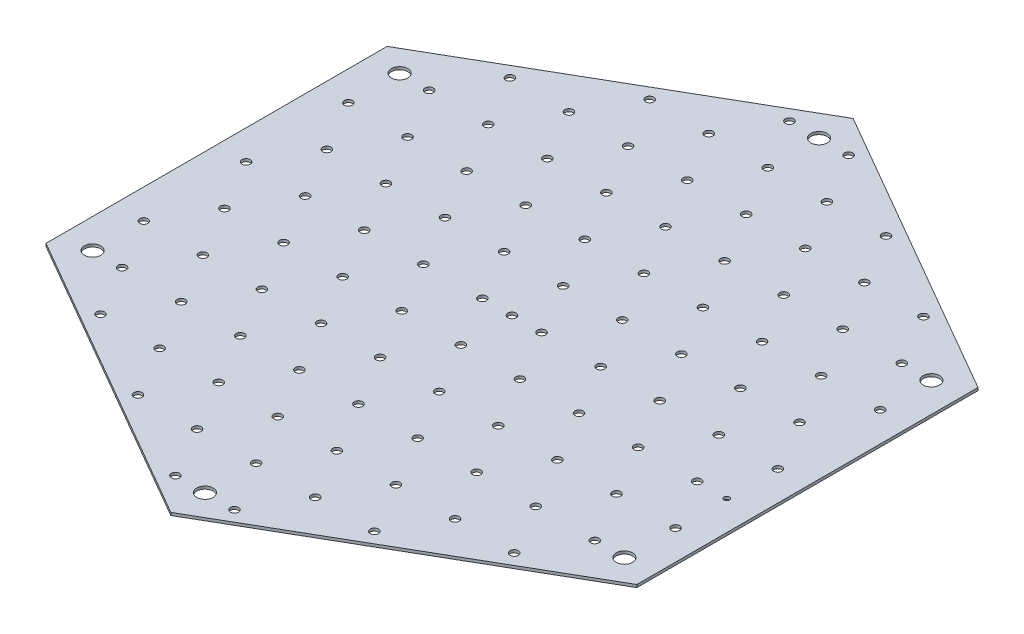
ISO-10303-21;
HEADER;
FILE_DESCRIPTION(('STEP AP214'),'2;1');
FILE_NAME('part.step','',(''),(''),'','','');
FILE_SCHEMA(('AUTOMOTIVE_DESIGN { 1 0 10303 214 1 1 1 1 }'));
ENDSEC;
DATA;
#1=APPLICATION_CONTEXT('core data for automotive mechanical design processes');
#2=APPLICATION_PROTOCOL_DEFINITION('international standard','automotive_design',2000,#1);
#3=PRODUCT_CONTEXT('',#1,'mechanical');
#4=PRODUCT('Part','Part','',(#3));
#5=PRODUCT_RELATED_PRODUCT_CATEGORY('part','',(#4));
#6=PRODUCT_DEFINITION_FORMATION('','',#4);
#7=PRODUCT_DEFINITION_CONTEXT('part definition',#1,'design');
#8=PRODUCT_DEFINITION('design','',#6,#7);
#9=PRODUCT_DEFINITION_SHAPE('','',#8);
#10=(LENGTH_UNIT() NAMED_UNIT(*) SI_UNIT(.MILLI.,.METRE.));
#11=(NAMED_UNIT(*) PLANE_ANGLE_UNIT() SI_UNIT($,.RADIAN.));
#12=(NAMED_UNIT(*) SI_UNIT($,.STERADIAN.) SOLID_ANGLE_UNIT());
#13=UNCERTAINTY_MEASURE_WITH_UNIT(LENGTH_MEASURE(1.E-05),#10,'distance_accuracy_value','');
#14=(GEOMETRIC_REPRESENTATION_CONTEXT(3) GLOBAL_UNCERTAINTY_ASSIGNED_CONTEXT((#13)) GLOBAL_UNIT_ASSIGNED_CONTEXT((#10,
#11,#12)) REPRESENTATION_CONTEXT('',''));
#15=CARTESIAN_POINT('',(0.,0.,0.));
#16=DIRECTION('',(0.,0.,1.));
#17=DIRECTION('',(1.,0.,0.));
#18=AXIS2_PLACEMENT_3D('',#15,#16,#17);
#19=CARTESIAN_POINT('',(54.1265877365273,0.5,-31.25));
#20=DIRECTION('',(-0.5,0.,0.866025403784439));
#21=DIRECTION('',(0.866025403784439,0.,0.5));
#22=AXIS2_PLACEMENT_3D('',#19,#20,#21);
#23=PLANE('',#22);
#24=DIRECTION('',(-0.866025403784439,0.,-0.5));
#25=VECTOR('',#24,1.);
#26=CARTESIAN_POINT('',(54.1265877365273,0.,-31.25));
#27=LINE('',#26,#25);
#28=CARTESIAN_POINT('',(54.1265877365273,0.,-31.25));
#29=VERTEX_POINT('',#28);
#30=CARTESIAN_POINT('',(0.,0.,-62.5));
#31=VERTEX_POINT('',#30);
#32=EDGE_CURVE('E129',#29,#31,#27,.T.);
#33=ORIENTED_EDGE('',*,*,#32,.T.);
#34=DIRECTION('',(0.,-1.,0.));
#35=VECTOR('',#34,1.);
#36=CARTESIAN_POINT('',(0.,0.5,-62.5));
#37=LINE('',#36,#35);
#38=CARTESIAN_POINT('',(0.,0.5,-62.5));
#39=VERTEX_POINT('',#38);
#40=EDGE_CURVE('E13',#39,#31,#37,.T.);
#41=ORIENTED_EDGE('',*,*,#40,.F.);
#42=DIRECTION('',(-0.866025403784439,0.,-0.5));
#43=VECTOR('',#42,1.);
#44=CARTESIAN_POINT('',(54.1265877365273,0.5,-31.25));
#45=LINE('',#44,#43);
#46=CARTESIAN_POINT('',(54.1265877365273,0.5,-31.25));
#47=VERTEX_POINT('',#46);
#48=EDGE_CURVE('E96',#47,#39,#45,.T.);
#49=ORIENTED_EDGE('',*,*,#48,.F.);
#50=DIRECTION('',(0.,-1.,0.));
#51=VECTOR('',#50,1.);
#52=CARTESIAN_POINT('',(54.1265877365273,0.5,-31.25));
#53=LINE('',#52,#51);
#54=EDGE_CURVE('E125',#47,#29,#53,.T.);
#55=ORIENTED_EDGE('',*,*,#54,.T.);
#56=EDGE_LOOP('',(#33,#41,#49,#55));
#57=FACE_BOUND('',#56,.T.);
#58=ADVANCED_FACE('F45',(#57),#23,.F.);
#59=CARTESIAN_POINT('',(0.,0.5,-62.5));
#60=DIRECTION('',(0.5,0.,0.866025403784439));
#61=DIRECTION('',(0.866025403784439,0.,-0.5));
#62=AXIS2_PLACEMENT_3D('',#59,#60,#61);
#63=PLANE('',#62);
#64=DIRECTION('',(0.,-1.,0.));
#65=VECTOR('',#64,1.);
#66=CARTESIAN_POINT('',(-54.1265877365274,0.5,-31.25));
#67=LINE('',#66,#65);
#68=CARTESIAN_POINT('',(-54.1265877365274,0.5,-31.25));
#69=VERTEX_POINT('',#68);
#70=CARTESIAN_POINT('',(-54.1265877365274,0.,-31.25));
#71=VERTEX_POINT('',#70);
#72=EDGE_CURVE('E53',#69,#71,#67,.T.);
#73=ORIENTED_EDGE('',*,*,#72,.F.);
#74=DIRECTION('',(-0.866025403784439,0.,0.5));
#75=VECTOR('',#74,1.);
#76=CARTESIAN_POINT('',(0.,0.5,-62.5));
#77=LINE('',#76,#75);
#78=EDGE_CURVE('E1886',#39,#69,#77,.T.);
#79=ORIENTED_EDGE('',*,*,#78,.F.);
#80=ORIENTED_EDGE('',*,*,#40,.T.);
#81=DIRECTION('',(-0.866025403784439,0.,0.5));
#82=VECTOR('',#81,1.);
#83=CARTESIAN_POINT('',(0.,0.,-62.5));
#84=LINE('',#83,#82);
#85=EDGE_CURVE('E131',#31,#71,#84,.T.);
#86=ORIENTED_EDGE('',*,*,#85,.T.);
#87=EDGE_LOOP('',(#73,#79,#80,#86));
#88=FACE_BOUND('',#87,.T.);
#89=ADVANCED_FACE('F166',(#88),#63,.F.);
#90=CARTESIAN_POINT('',(-54.1265877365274,0.5,-31.25));
#91=DIRECTION('',(1.,0.,0.));
#92=DIRECTION('',(0.,0.,-1.));
#93=AXIS2_PLACEMENT_3D('',#90,#91,#92);
#94=PLANE('',#93);
#95=DIRECTION('',(0.,0.,1.));
#96=VECTOR('',#95,1.);
#97=CARTESIAN_POINT('',(-54.1265877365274,0.,-31.25));
#98=LINE('',#97,#96);
#99=CARTESIAN_POINT('',(-54.1265877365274,0.,31.25));
#100=VERTEX_POINT('',#99);
#101=EDGE_CURVE('E134',#71,#100,#98,.T.);
#102=ORIENTED_EDGE('',*,*,#101,.T.);
#103=DIRECTION('',(0.,-1.,0.));
#104=VECTOR('',#103,1.);
#105=CARTESIAN_POINT('',(-54.1265877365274,0.5,31.25));
#106=LINE('',#105,#104);
#107=CARTESIAN_POINT('',(-54.1265877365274,0.5,31.25));
#108=VERTEX_POINT('',#107);
#109=EDGE_CURVE('E120',#108,#100,#106,.T.);
#110=ORIENTED_EDGE('',*,*,#109,.F.);
#111=DIRECTION('',(0.,0.,1.));
#112=VECTOR('',#111,1.);
#113=CARTESIAN_POINT('',(-54.1265877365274,0.5,-31.25));
#114=LINE('',#113,#112);
#115=EDGE_CURVE('E111',#69,#108,#114,.T.);
#116=ORIENTED_EDGE('',*,*,#115,.F.);
#117=ORIENTED_EDGE('',*,*,#72,.T.);
#118=EDGE_LOOP('',(#102,#110,#116,#117));
#119=FACE_BOUND('',#118,.T.);
#120=ADVANCED_FACE('F145',(#119),#94,.F.);
#121=CARTESIAN_POINT('',(-54.1265877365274,0.5,31.25));
#122=DIRECTION('',(0.5,0.,-0.866025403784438));
#123=DIRECTION('',(-0.866025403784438,0.,-0.5));
#124=AXIS2_PLACEMENT_3D('',#121,#122,#123);
#125=PLANE('',#124);
#126=DIRECTION('',(0.866025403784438,0.,0.5));
#127=VECTOR('',#126,1.);
#128=CARTESIAN_POINT('',(-54.1265877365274,0.,31.25));
#129=LINE('',#128,#127);
#130=CARTESIAN_POINT('',(0.,0.,62.5));
#131=VERTEX_POINT('',#130);
#132=EDGE_CURVE('E119',#100,#131,#129,.T.);
#133=ORIENTED_EDGE('',*,*,#132,.T.);
#134=DIRECTION('',(0.,-1.,0.));
#135=VECTOR('',#134,1.);
#136=CARTESIAN_POINT('',(0.,0.5,62.5));
#137=LINE('',#136,#135);
#138=CARTESIAN_POINT('',(0.,0.5,62.5));
#139=VERTEX_POINT('',#138);
#140=EDGE_CURVE('E116',#139,#131,#137,.T.);
#141=ORIENTED_EDGE('',*,*,#140,.F.);
#142=DIRECTION('',(0.866025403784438,0.,0.5));
#143=VECTOR('',#142,1.);
#144=CARTESIAN_POINT('',(-54.1265877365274,0.5,31.25));
#145=LINE('',#144,#143);
#146=EDGE_CURVE('E104',#108,#139,#145,.T.);
#147=ORIENTED_EDGE('',*,*,#146,.F.);
#148=ORIENTED_EDGE('',*,*,#109,.T.);
#149=EDGE_LOOP('',(#133,#141,#147,#148));
#150=FACE_BOUND('',#149,.T.);
#151=ADVANCED_FACE('F117',(#150),#125,.F.);
#152=CARTESIAN_POINT('',(0.,0.5,62.5));
#153=DIRECTION('',(-0.5,0.,-0.866025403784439));
#154=DIRECTION('',(-0.866025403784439,0.,0.5));
#155=AXIS2_PLACEMENT_3D('',#152,#153,#154);
#156=PLANE('',#155);
#157=DIRECTION('',(0.866025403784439,0.,-0.5));
#158=VECTOR('',#157,1.);
#159=CARTESIAN_POINT('',(0.,0.,62.5));
#160=LINE('',#159,#158);
#161=CARTESIAN_POINT('',(54.1265877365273,0.,31.25));
#162=VERTEX_POINT('',#161);
#163=EDGE_CURVE('E84',#131,#162,#160,.T.);
#164=ORIENTED_EDGE('',*,*,#163,.T.);
#165=DIRECTION('',(0.,-1.,0.));
#166=VECTOR('',#165,1.);
#167=CARTESIAN_POINT('',(54.1265877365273,0.5,31.25));
#168=LINE('',#167,#166);
#169=CARTESIAN_POINT('',(54.1265877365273,0.5,31.25));
#170=VERTEX_POINT('',#169);
#171=EDGE_CURVE('E121',#170,#162,#168,.T.);
#172=ORIENTED_EDGE('',*,*,#171,.F.);
#173=DIRECTION('',(0.866025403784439,0.,-0.5));
#174=VECTOR('',#173,1.);
#175=CARTESIAN_POINT('',(0.,0.5,62.5));
#176=LINE('',#175,#174);
#177=EDGE_CURVE('E109',#139,#170,#176,.T.);
#178=ORIENTED_EDGE('',*,*,#177,.F.);
#179=ORIENTED_EDGE('',*,*,#140,.T.);
#180=EDGE_LOOP('',(#164,#172,#178,#179));
#181=FACE_BOUND('',#180,.T.);
#182=ADVANCED_FACE('F123',(#181),#156,.F.);
#183=CARTESIAN_POINT('',(54.1265877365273,0.5,31.25));
#184=DIRECTION('',(-1.,0.,0.));
#185=DIRECTION('',(0.,0.,1.));
#186=AXIS2_PLACEMENT_3D('',#183,#184,#185);
#187=PLANE('',#186);
#188=ORIENTED_EDGE('',*,*,#54,.F.);
#189=DIRECTION('',(0.,0.,-1.));
#190=VECTOR('',#189,1.);
#191=CARTESIAN_POINT('',(54.1265877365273,0.5,31.25));
#192=LINE('',#191,#190);
#193=EDGE_CURVE('E61',#170,#47,#192,.T.);
#194=ORIENTED_EDGE('',*,*,#193,.F.);
#195=ORIENTED_EDGE('',*,*,#171,.T.);
#196=DIRECTION('',(0.,0.,-1.));
#197=VECTOR('',#196,1.);
#198=CARTESIAN_POINT('',(54.1265877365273,0.,31.25));
#199=LINE('',#198,#197);
#200=EDGE_CURVE('E90',#162,#29,#199,.T.);
#201=ORIENTED_EDGE('',*,*,#200,.T.);
#202=EDGE_LOOP('',(#188,#194,#195,#201));
#203=FACE_BOUND('',#202,.T.);
#204=ADVANCED_FACE('F154',(#203),#187,.F.);
#205=CARTESIAN_POINT('',(0.,0.5,0.));
#206=DIRECTION('',(0.,1.,0.));
#207=DIRECTION('',(0.,0.,1.));
#208=AXIS2_PLACEMENT_3D('',#205,#206,#207);
#209=PLANE('',#208);
#210=CARTESIAN_POINT('',(48.71385,0.5,9.37498480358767));
#211=DIRECTION('',(0.,1.,0.));
#212=DIRECTION('',(0.,0.,1.));
#213=AXIS2_PLACEMENT_3D('',#210,#211,#212);
#214=CIRCLE('',#213,0.499999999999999);
#215=CARTESIAN_POINT('',(48.71385,0.5,9.87498480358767));
#216=VERTEX_POINT('',#215);
#217=EDGE_CURVE('E1264',#216,#216,#214,.T.);
#218=ORIENTED_EDGE('',*,*,#217,.F.);
#219=EDGE_LOOP('',(#218));
#220=FACE_BOUND('',#219,.T.);
#221=CARTESIAN_POINT('',(48.71385,0.5,-18.7499696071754));
#222=DIRECTION('',(0.,1.,0.));
#223=DIRECTION('',(0.,0.,1.));
#224=AXIS2_PLACEMENT_3D('',#221,#222,#223);
#225=CIRCLE('',#224,0.749999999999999);
#226=CARTESIAN_POINT('',(48.71385,0.5,-17.9999696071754));
#227=VERTEX_POINT('',#226);
#228=EDGE_CURVE('E1266',#227,#227,#225,.T.);
#229=ORIENTED_EDGE('',*,*,#228,.F.);
#230=EDGE_LOOP('',(#229));
#231=FACE_BOUND('',#230,.T.);
#232=CARTESIAN_POINT('',(43.3012,0.5,-28.1249544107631));
#233=DIRECTION('',(0.,1.,0.));
#234=DIRECTION('',(0.,0.,1.));
#235=AXIS2_PLACEMENT_3D('',#232,#233,#234);
#236=CIRCLE('',#235,0.750000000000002);
#237=CARTESIAN_POINT('',(43.3012,0.5,-27.3749544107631));
#238=VERTEX_POINT('',#237);
#239=EDGE_CURVE('E1272',#238,#238,#236,.T.);
#240=ORIENTED_EDGE('',*,*,#239,.F.);
#241=EDGE_LOOP('',(#240));
#242=FACE_BOUND('',#241,.T.);
#243=CARTESIAN_POINT('',(37.88855,0.5,-37.4999392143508));
#244=DIRECTION('',(0.,1.,0.));
#245=DIRECTION('',(0.,0.,1.));
#246=AXIS2_PLACEMENT_3D('',#243,#244,#245);
#247=CIRCLE('',#246,0.750000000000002);
#248=CARTESIAN_POINT('',(37.88855,0.5,-36.7499392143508));
#249=VERTEX_POINT('',#248);
#250=EDGE_CURVE('E1278',#249,#249,#247,.T.);
#251=ORIENTED_EDGE('',*,*,#250,.F.);
#252=EDGE_LOOP('',(#251));
#253=FACE_BOUND('',#252,.T.);
#254=CARTESIAN_POINT('',(-21.6506,0.5,46.8749240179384));
#255=DIRECTION('',(0.,1.,0.));
#256=DIRECTION('',(0.,0.,1.));
#257=AXIS2_PLACEMENT_3D('',#254,#255,#256);
#258=CIRCLE('',#257,0.749999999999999);
#259=CARTESIAN_POINT('',(-21.6506,0.5,47.6249240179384));
#260=VERTEX_POINT('',#259);
#261=EDGE_CURVE('E1284',#260,#260,#258,.T.);
#262=ORIENTED_EDGE('',*,*,#261,.F.);
#263=EDGE_LOOP('',(#262));
#264=FACE_BOUND('',#263,.T.);
#265=CARTESIAN_POINT('',(-5.41265000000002,0.5,56.2499088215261));
#266=DIRECTION('',(0.,1.,0.));
#267=DIRECTION('',(0.,0.,1.));
#268=AXIS2_PLACEMENT_3D('',#265,#266,#267);
#269=CIRCLE('',#268,0.749999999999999);
#270=CARTESIAN_POINT('',(-5.41265000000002,0.5,56.9999088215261));
#271=VERTEX_POINT('',#270);
#272=EDGE_CURVE('E1290',#271,#271,#269,.T.);
#273=ORIENTED_EDGE('',*,*,#272,.F.);
#274=EDGE_LOOP('',(#273));
#275=FACE_BOUND('',#274,.T.);
#276=CARTESIAN_POINT('',(-10.8253,0.5,46.8749240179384));
#277=DIRECTION('',(0.,1.,0.));
#278=DIRECTION('',(0.,0.,1.));
#279=AXIS2_PLACEMENT_3D('',#276,#277,#278);
#280=CIRCLE('',#279,0.749999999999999);
#281=CARTESIAN_POINT('',(-10.8253,0.5,47.6249240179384));
#282=VERTEX_POINT('',#281);
#283=EDGE_CURVE('E1296',#282,#282,#280,.T.);
#284=ORIENTED_EDGE('',*,*,#283,.F.);
#285=EDGE_LOOP('',(#284));
#286=FACE_BOUND('',#285,.T.);
#287=CARTESIAN_POINT('',(-16.23795,0.5,37.4999392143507));
#288=DIRECTION('',(0.,1.,0.));
#289=DIRECTION('',(0.,0.,1.));
#290=AXIS2_PLACEMENT_3D('',#287,#288,#289);
#291=CIRCLE('',#290,0.749999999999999);
#292=CARTESIAN_POINT('',(-16.23795,0.5,38.2499392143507));
#293=VERTEX_POINT('',#292);
#294=EDGE_CURVE('E1302',#293,#293,#291,.T.);
#295=ORIENTED_EDGE('',*,*,#294,.F.);
#296=EDGE_LOOP('',(#295));
#297=FACE_BOUND('',#296,.T.);
#298=CARTESIAN_POINT('',(-48.71385,0.5,-18.7499696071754));
#299=DIRECTION('',(0.,1.,0.));
#300=DIRECTION('',(0.,0.,1.));
#301=AXIS2_PLACEMENT_3D('',#298,#299,#300);
#302=CIRCLE('',#301,0.749999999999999);
#303=CARTESIAN_POINT('',(-48.71385,0.5,-17.9999696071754));
#304=VERTEX_POINT('',#303);
#305=EDGE_CURVE('E1308',#304,#304,#302,.T.);
#306=ORIENTED_EDGE('',*,*,#305,.F.);
#307=EDGE_LOOP('',(#306));
#308=FACE_BOUND('',#307,.T.);
#309=CARTESIAN_POINT('',(5.41264999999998,0.5,56.2499088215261));
#310=DIRECTION('',(0.,1.,0.));
#311=DIRECTION('',(0.,0.,1.));
#312=AXIS2_PLACEMENT_3D('',#309,#310,#311);
#313=CIRCLE('',#312,0.750000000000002);
#314=CARTESIAN_POINT('',(5.41264999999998,0.5,56.9999088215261));
#315=VERTEX_POINT('',#314);
#316=EDGE_CURVE('E1314',#315,#315,#313,.T.);
#317=ORIENTED_EDGE('',*,*,#316,.F.);
#318=EDGE_LOOP('',(#317));
#319=FACE_BOUND('',#318,.T.);
#320=CARTESIAN_POINT('',(0.,0.5,46.8749240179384));
#321=DIRECTION('',(0.,1.,0.));
#322=DIRECTION('',(0.,0.,1.));
#323=AXIS2_PLACEMENT_3D('',#320,#321,#322);
#324=CIRCLE('',#323,0.750000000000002);
#325=CARTESIAN_POINT('',(0.,0.5,47.6249240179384));
#326=VERTEX_POINT('',#325);
#327=EDGE_CURVE('E1320',#326,#326,#324,.T.);
#328=ORIENTED_EDGE('',*,*,#327,.F.);
#329=EDGE_LOOP('',(#328));
#330=FACE_BOUND('',#329,.T.);
#331=CARTESIAN_POINT('',(-5.41265000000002,0.5,37.4999392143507));
#332=DIRECTION('',(0.,1.,0.));
#333=DIRECTION('',(0.,0.,1.));
#334=AXIS2_PLACEMENT_3D('',#331,#332,#333);
#335=CIRCLE('',#334,0.750000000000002);
#336=CARTESIAN_POINT('',(-5.41265000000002,0.5,38.2499392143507));
#337=VERTEX_POINT('',#336);
#338=EDGE_CURVE('E1326',#337,#337,#335,.T.);
#339=ORIENTED_EDGE('',*,*,#338,.F.);
#340=EDGE_LOOP('',(#339));
#341=FACE_BOUND('',#340,.T.);
#342=CARTESIAN_POINT('',(-10.8253,0.5,28.124954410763));
#343=DIRECTION('',(0.,1.,0.));
#344=DIRECTION('',(0.,0.,1.));
#345=AXIS2_PLACEMENT_3D('',#342,#343,#344);
#346=CIRCLE('',#345,0.750000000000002);
#347=CARTESIAN_POINT('',(-10.8253,0.5,28.874954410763));
#348=VERTEX_POINT('',#347);
#349=EDGE_CURVE('E1332',#348,#348,#346,.T.);
#350=ORIENTED_EDGE('',*,*,#349,.F.);
#351=EDGE_LOOP('',(#350));
#352=FACE_BOUND('',#351,.T.);
#353=CARTESIAN_POINT('',(-43.3012,0.5,-28.1249544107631));
#354=DIRECTION('',(0.,1.,0.));
#355=DIRECTION('',(0.,0.,1.));
#356=AXIS2_PLACEMENT_3D('',#353,#354,#355);
#357=CIRCLE('',#356,0.750000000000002);
#358=CARTESIAN_POINT('',(-43.3012,0.5,-27.3749544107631));
#359=VERTEX_POINT('',#358);
#360=EDGE_CURVE('E1338',#359,#359,#357,.T.);
#361=ORIENTED_EDGE('',*,*,#360,.F.);
#362=EDGE_LOOP('',(#361));
#363=FACE_BOUND('',#362,.T.);
#364=CARTESIAN_POINT('',(10.8253,0.5,46.8749240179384));
#365=DIRECTION('',(0.,1.,0.));
#366=DIRECTION('',(0.,0.,1.));
#367=AXIS2_PLACEMENT_3D('',#364,#365,#366);
#368=CIRCLE('',#367,0.75);
#369=CARTESIAN_POINT('',(10.8253,0.5,47.6249240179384));
#370=VERTEX_POINT('',#369);
#371=EDGE_CURVE('E1344',#370,#370,#368,.T.);
#372=ORIENTED_EDGE('',*,*,#371,.F.);
#373=EDGE_LOOP('',(#372));
#374=FACE_BOUND('',#373,.T.);
#375=CARTESIAN_POINT('',(5.41264999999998,0.5,37.4999392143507));
#376=DIRECTION('',(0.,1.,0.));
#377=DIRECTION('',(0.,0.,1.));
#378=AXIS2_PLACEMENT_3D('',#375,#376,#377);
#379=CIRCLE('',#378,0.75);
#380=CARTESIAN_POINT('',(5.41264999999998,0.5,38.2499392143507));
#381=VERTEX_POINT('',#380);
#382=EDGE_CURVE('E1350',#381,#381,#379,.T.);
#383=ORIENTED_EDGE('',*,*,#382,.F.);
#384=EDGE_LOOP('',(#383));
#385=FACE_BOUND('',#384,.T.);
#386=CARTESIAN_POINT('',(0.,0.5,28.124954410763));
#387=DIRECTION('',(0.,1.,0.));
#388=DIRECTION('',(0.,0.,1.));
#389=AXIS2_PLACEMENT_3D('',#386,#387,#388);
#390=CIRCLE('',#389,0.75);
#391=CARTESIAN_POINT('',(0.,0.5,28.874954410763));
#392=VERTEX_POINT('',#391);
#393=EDGE_CURVE('E1356',#392,#392,#390,.T.);
#394=ORIENTED_EDGE('',*,*,#393,.F.);
#395=EDGE_LOOP('',(#394));
#396=FACE_BOUND('',#395,.T.);
#397=CARTESIAN_POINT('',(-5.41265000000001,0.5,18.7499696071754));
#398=DIRECTION('',(0.,1.,0.));
#399=DIRECTION('',(0.,0.,1.));
#400=AXIS2_PLACEMENT_3D('',#397,#398,#399);
#401=CIRCLE('',#400,0.75);
#402=CARTESIAN_POINT('',(-5.41265000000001,0.5,19.4999696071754));
#403=VERTEX_POINT('',#402);
#404=EDGE_CURVE('E1362',#403,#403,#401,.T.);
#405=ORIENTED_EDGE('',*,*,#404,.F.);
#406=EDGE_LOOP('',(#405));
#407=FACE_BOUND('',#406,.T.);
#408=CARTESIAN_POINT('',(-37.88855,0.5,-37.4999392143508));
#409=DIRECTION('',(0.,1.,0.));
#410=DIRECTION('',(0.,0.,1.));
#411=AXIS2_PLACEMENT_3D('',#408,#409,#410);
#412=CIRCLE('',#411,0.75);
#413=CARTESIAN_POINT('',(-37.88855,0.5,-36.7499392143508));
#414=VERTEX_POINT('',#413);
#415=EDGE_CURVE('E1368',#414,#414,#412,.T.);
#416=ORIENTED_EDGE('',*,*,#415,.F.);
#417=EDGE_LOOP('',(#416));
#418=FACE_BOUND('',#417,.T.);
#419=CARTESIAN_POINT('',(21.6506,0.5,46.8749240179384));
#420=DIRECTION('',(0.,1.,0.));
#421=DIRECTION('',(0.,0.,1.));
#422=AXIS2_PLACEMENT_3D('',#419,#420,#421);
#423=CIRCLE('',#422,0.75);
#424=CARTESIAN_POINT('',(21.6506,0.5,47.6249240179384));
#425=VERTEX_POINT('',#424);
#426=EDGE_CURVE('E1374',#425,#425,#423,.T.);
#427=ORIENTED_EDGE('',*,*,#426,.F.);
#428=EDGE_LOOP('',(#427));
#429=FACE_BOUND('',#428,.T.);
#430=CARTESIAN_POINT('',(16.23795,0.5,37.4999392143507));
#431=DIRECTION('',(0.,1.,0.));
#432=DIRECTION('',(0.,0.,1.));
#433=AXIS2_PLACEMENT_3D('',#430,#431,#432);
#434=CIRCLE('',#433,0.75);
#435=CARTESIAN_POINT('',(16.23795,0.5,38.2499392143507));
#436=VERTEX_POINT('',#435);
#437=EDGE_CURVE('E1380',#436,#436,#434,.T.);
#438=ORIENTED_EDGE('',*,*,#437,.F.);
#439=EDGE_LOOP('',(#438));
#440=FACE_BOUND('',#439,.T.);
#441=CARTESIAN_POINT('',(10.8253,0.5,28.124954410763));
#442=DIRECTION('',(0.,1.,0.));
#443=DIRECTION('',(0.,0.,1.));
#444=AXIS2_PLACEMENT_3D('',#441,#442,#443);
#445=CIRCLE('',#444,0.75);
#446=CARTESIAN_POINT('',(10.8253,0.5,28.874954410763));
#447=VERTEX_POINT('',#446);
#448=EDGE_CURVE('E1386',#447,#447,#445,.T.);
#449=ORIENTED_EDGE('',*,*,#448,.F.);
#450=EDGE_LOOP('',(#449));
#451=FACE_BOUND('',#450,.T.);
#452=CARTESIAN_POINT('',(5.41264999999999,0.5,18.7499696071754));
#453=DIRECTION('',(0.,1.,0.));
#454=DIRECTION('',(0.,0.,1.));
#455=AXIS2_PLACEMENT_3D('',#452,#453,#454);
#456=CIRCLE('',#455,0.75);
#457=CARTESIAN_POINT('',(5.41264999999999,0.5,19.4999696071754));
#458=VERTEX_POINT('',#457);
#459=EDGE_CURVE('E1392',#458,#458,#456,.T.);
#460=ORIENTED_EDGE('',*,*,#459,.F.);
#461=EDGE_LOOP('',(#460));
#462=FACE_BOUND('',#461,.T.);
#463=CARTESIAN_POINT('',(0.,0.5,9.37498480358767));
#464=DIRECTION('',(0.,1.,0.));
#465=DIRECTION('',(0.,0.,1.));
#466=AXIS2_PLACEMENT_3D('',#463,#464,#465);
#467=CIRCLE('',#466,0.75);
#468=CARTESIAN_POINT('',(0.,0.5,10.1249848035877));
#469=VERTEX_POINT('',#468);
#470=EDGE_CURVE('E1398',#469,#469,#467,.T.);
#471=ORIENTED_EDGE('',*,*,#470,.F.);
#472=EDGE_LOOP('',(#471));
#473=FACE_BOUND('',#472,.T.);
#474=CARTESIAN_POINT('',(-27.06325,0.5,-37.4999392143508));
#475=DIRECTION('',(0.,1.,0.));
#476=DIRECTION('',(0.,0.,1.));
#477=AXIS2_PLACEMENT_3D('',#474,#475,#476);
#478=CIRCLE('',#477,0.749999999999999);
#479=CARTESIAN_POINT('',(-27.06325,0.5,-36.7499392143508));
#480=VERTEX_POINT('',#479);
#481=EDGE_CURVE('E1404',#480,#480,#478,.T.);
#482=ORIENTED_EDGE('',*,*,#481,.F.);
#483=EDGE_LOOP('',(#482));
#484=FACE_BOUND('',#483,.T.);
#485=CARTESIAN_POINT('',(-32.4759,0.5,-28.1249544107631));
#486=DIRECTION('',(0.,1.,0.));
#487=DIRECTION('',(0.,0.,1.));
#488=AXIS2_PLACEMENT_3D('',#485,#486,#487);
#489=CIRCLE('',#488,0.749999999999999);
#490=CARTESIAN_POINT('',(-32.4759,0.5,-27.3749544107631));
#491=VERTEX_POINT('',#490);
#492=EDGE_CURVE('E1410',#491,#491,#489,.T.);
#493=ORIENTED_EDGE('',*,*,#492,.F.);
#494=EDGE_LOOP('',(#493));
#495=FACE_BOUND('',#494,.T.);
#496=CARTESIAN_POINT('',(-37.88855,0.5,-18.7499696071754));
#497=DIRECTION('',(0.,1.,0.));
#498=DIRECTION('',(0.,0.,1.));
#499=AXIS2_PLACEMENT_3D('',#496,#497,#498);
#500=CIRCLE('',#499,0.749999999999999);
#501=CARTESIAN_POINT('',(-37.88855,0.5,-17.9999696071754));
#502=VERTEX_POINT('',#501);
#503=EDGE_CURVE('E1416',#502,#502,#500,.T.);
#504=ORIENTED_EDGE('',*,*,#503,.F.);
#505=EDGE_LOOP('',(#504));
#506=FACE_BOUND('',#505,.T.);
#507=CARTESIAN_POINT('',(-43.3012,0.5,-9.3749848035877));
#508=DIRECTION('',(0.,1.,0.));
#509=DIRECTION('',(0.,0.,1.));
#510=AXIS2_PLACEMENT_3D('',#507,#508,#509);
#511=CIRCLE('',#510,0.749999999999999);
#512=CARTESIAN_POINT('',(-43.3012,0.5,-8.6249848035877));
#513=VERTEX_POINT('',#512);
#514=EDGE_CURVE('E1422',#513,#513,#511,.T.);
#515=ORIENTED_EDGE('',*,*,#514,.F.);
#516=EDGE_LOOP('',(#515));
#517=FACE_BOUND('',#516,.T.);
#518=CARTESIAN_POINT('',(-21.6506,0.5,-28.1249544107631));
#519=DIRECTION('',(0.,1.,0.));
#520=DIRECTION('',(0.,0.,1.));
#521=AXIS2_PLACEMENT_3D('',#518,#519,#520);
#522=CIRCLE('',#521,0.749999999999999);
#523=CARTESIAN_POINT('',(-21.6506,0.5,-27.3749544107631));
#524=VERTEX_POINT('',#523);
#525=EDGE_CURVE('E1428',#524,#524,#522,.T.);
#526=ORIENTED_EDGE('',*,*,#525,.F.);
#527=EDGE_LOOP('',(#526));
#528=FACE_BOUND('',#527,.T.);
#529=CARTESIAN_POINT('',(-27.06325,0.5,-18.7499696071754));
#530=DIRECTION('',(0.,1.,0.));
#531=DIRECTION('',(0.,0.,1.));
#532=AXIS2_PLACEMENT_3D('',#529,#530,#531);
#533=CIRCLE('',#532,0.749999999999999);
#534=CARTESIAN_POINT('',(-27.06325,0.5,-17.9999696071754));
#535=VERTEX_POINT('',#534);
#536=EDGE_CURVE('E1434',#535,#535,#533,.T.);
#537=ORIENTED_EDGE('',*,*,#536,.F.);
#538=EDGE_LOOP('',(#537));
#539=FACE_BOUND('',#538,.T.);
#540=CARTESIAN_POINT('',(-32.4759,0.5,-9.3749848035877));
#541=DIRECTION('',(0.,1.,0.));
#542=DIRECTION('',(0.,0.,1.));
#543=AXIS2_PLACEMENT_3D('',#540,#541,#542);
#544=CIRCLE('',#543,0.749999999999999);
#545=CARTESIAN_POINT('',(-32.4759,0.5,-8.6249848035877));
#546=VERTEX_POINT('',#545);
#547=EDGE_CURVE('E1440',#546,#546,#544,.T.);
#548=ORIENTED_EDGE('',*,*,#547,.F.);
#549=EDGE_LOOP('',(#548));
#550=FACE_BOUND('',#549,.T.);
#551=CARTESIAN_POINT('',(-48.71385,0.5,18.7499696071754));
#552=DIRECTION('',(0.,1.,0.));
#553=DIRECTION('',(0.,0.,1.));
#554=AXIS2_PLACEMENT_3D('',#551,#552,#553);
#555=CIRCLE('',#554,0.749999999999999);
#556=CARTESIAN_POINT('',(-48.71385,0.5,19.4999696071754));
#557=VERTEX_POINT('',#556);
#558=EDGE_CURVE('E1446',#557,#557,#555,.T.);
#559=ORIENTED_EDGE('',*,*,#558,.F.);
#560=EDGE_LOOP('',(#559));
#561=FACE_BOUND('',#560,.T.);
#562=CARTESIAN_POINT('',(-43.3012,0.5,9.37498480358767));
#563=DIRECTION('',(0.,1.,0.));
#564=DIRECTION('',(0.,0.,1.));
#565=AXIS2_PLACEMENT_3D('',#562,#563,#564);
#566=CIRCLE('',#565,0.749999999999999);
#567=CARTESIAN_POINT('',(-43.3012,0.5,10.1249848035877));
#568=VERTEX_POINT('',#567);
#569=EDGE_CURVE('E1452',#568,#568,#566,.T.);
#570=ORIENTED_EDGE('',*,*,#569,.F.);
#571=EDGE_LOOP('',(#570));
#572=FACE_BOUND('',#571,.T.);
#573=CARTESIAN_POINT('',(-43.3012,0.5,28.124954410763));
#574=DIRECTION('',(0.,1.,0.));
#575=DIRECTION('',(0.,0.,1.));
#576=AXIS2_PLACEMENT_3D('',#573,#574,#575);
#577=CIRCLE('',#576,0.750000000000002);
#578=CARTESIAN_POINT('',(-43.3012,0.5,28.874954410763));
#579=VERTEX_POINT('',#578);
#580=EDGE_CURVE('E1458',#579,#579,#577,.T.);
#581=ORIENTED_EDGE('',*,*,#580,.F.);
#582=EDGE_LOOP('',(#581));
#583=FACE_BOUND('',#582,.T.);
#584=CARTESIAN_POINT('',(-37.88855,0.5,18.7499696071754));
#585=DIRECTION('',(0.,1.,0.));
#586=DIRECTION('',(0.,0.,1.));
#587=AXIS2_PLACEMENT_3D('',#584,#585,#586);
#588=CIRCLE('',#587,0.750000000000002);
#589=CARTESIAN_POINT('',(-37.88855,0.5,19.4999696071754));
#590=VERTEX_POINT('',#589);
#591=EDGE_CURVE('E1464',#590,#590,#588,.T.);
#592=ORIENTED_EDGE('',*,*,#591,.F.);
#593=EDGE_LOOP('',(#592));
#594=FACE_BOUND('',#593,.T.);
#595=CARTESIAN_POINT('',(-32.4759,0.5,9.37498480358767));
#596=DIRECTION('',(0.,1.,0.));
#597=DIRECTION('',(0.,0.,1.));
#598=AXIS2_PLACEMENT_3D('',#595,#596,#597);
#599=CIRCLE('',#598,0.750000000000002);
#600=CARTESIAN_POINT('',(-32.4759,0.5,10.1249848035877));
#601=VERTEX_POINT('',#600);
#602=EDGE_CURVE('E1470',#601,#601,#599,.T.);
#603=ORIENTED_EDGE('',*,*,#602,.F.);
#604=EDGE_LOOP('',(#603));
#605=FACE_BOUND('',#604,.T.);
#606=CARTESIAN_POINT('',(-16.23795,0.5,-18.7499696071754));
#607=DIRECTION('',(0.,1.,0.));
#608=DIRECTION('',(0.,0.,1.));
#609=AXIS2_PLACEMENT_3D('',#606,#607,#608);
#610=CIRCLE('',#609,0.750000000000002);
#611=CARTESIAN_POINT('',(-16.23795,0.5,-17.9999696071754));
#612=VERTEX_POINT('',#611);
#613=EDGE_CURVE('E1476',#612,#612,#610,.T.);
#614=ORIENTED_EDGE('',*,*,#613,.F.);
#615=EDGE_LOOP('',(#614));
#616=FACE_BOUND('',#615,.T.);
#617=CARTESIAN_POINT('',(-21.6506,0.5,-9.3749848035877));
#618=DIRECTION('',(0.,1.,0.));
#619=DIRECTION('',(0.,0.,1.));
#620=AXIS2_PLACEMENT_3D('',#617,#618,#619);
#621=CIRCLE('',#620,0.750000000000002);
#622=CARTESIAN_POINT('',(-21.6506,0.5,-8.6249848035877));
#623=VERTEX_POINT('',#622);
#624=EDGE_CURVE('E1482',#623,#623,#621,.T.);
#625=ORIENTED_EDGE('',*,*,#624,.F.);
#626=EDGE_LOOP('',(#625));
#627=FACE_BOUND('',#626,.T.);
#628=CARTESIAN_POINT('',(-37.88855,0.5,37.4999392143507));
#629=DIRECTION('',(0.,1.,0.));
#630=DIRECTION('',(0.,0.,1.));
#631=AXIS2_PLACEMENT_3D('',#628,#629,#630);
#632=CIRCLE('',#631,0.75);
#633=CARTESIAN_POINT('',(-37.88855,0.5,38.2499392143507));
#634=VERTEX_POINT('',#633);
#635=EDGE_CURVE('E1488',#634,#634,#632,.T.);
#636=ORIENTED_EDGE('',*,*,#635,.F.);
#637=EDGE_LOOP('',(#636));
#638=FACE_BOUND('',#637,.T.);
#639=CARTESIAN_POINT('',(-32.4759,0.5,28.124954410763));
#640=DIRECTION('',(0.,1.,0.));
#641=DIRECTION('',(0.,0.,1.));
#642=AXIS2_PLACEMENT_3D('',#639,#640,#641);
#643=CIRCLE('',#642,0.75);
#644=CARTESIAN_POINT('',(-32.4759,0.5,28.874954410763));
#645=VERTEX_POINT('',#644);
#646=EDGE_CURVE('E1494',#645,#645,#643,.T.);
#647=ORIENTED_EDGE('',*,*,#646,.F.);
#648=EDGE_LOOP('',(#647));
#649=FACE_BOUND('',#648,.T.);
#650=CARTESIAN_POINT('',(-27.06325,0.5,18.7499696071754));
#651=DIRECTION('',(0.,1.,0.));
#652=DIRECTION('',(0.,0.,1.));
#653=AXIS2_PLACEMENT_3D('',#650,#651,#652);
#654=CIRCLE('',#653,0.75);
#655=CARTESIAN_POINT('',(-27.06325,0.5,19.4999696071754));
#656=VERTEX_POINT('',#655);
#657=EDGE_CURVE('E1500',#656,#656,#654,.T.);
#658=ORIENTED_EDGE('',*,*,#657,.F.);
#659=EDGE_LOOP('',(#658));
#660=FACE_BOUND('',#659,.T.);
#661=CARTESIAN_POINT('',(-21.6506,0.5,9.37498480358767));
#662=DIRECTION('',(0.,1.,0.));
#663=DIRECTION('',(0.,0.,1.));
#664=AXIS2_PLACEMENT_3D('',#661,#662,#663);
#665=CIRCLE('',#664,0.75);
#666=CARTESIAN_POINT('',(-21.6506,0.5,10.1249848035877));
#667=VERTEX_POINT('',#666);
#668=EDGE_CURVE('E1506',#667,#667,#665,.T.);
#669=ORIENTED_EDGE('',*,*,#668,.F.);
#670=EDGE_LOOP('',(#669));
#671=FACE_BOUND('',#670,.T.);
#672=CARTESIAN_POINT('',(-10.8253,0.5,-9.3749848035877));
#673=DIRECTION('',(0.,1.,0.));
#674=DIRECTION('',(0.,0.,1.));
#675=AXIS2_PLACEMENT_3D('',#672,#673,#674);
#676=CIRCLE('',#675,0.75);
#677=CARTESIAN_POINT('',(-10.8253,0.5,-8.6249848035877));
#678=VERTEX_POINT('',#677);
#679=EDGE_CURVE('E1512',#678,#678,#676,.T.);
#680=ORIENTED_EDGE('',*,*,#679,.F.);
#681=EDGE_LOOP('',(#680));
#682=FACE_BOUND('',#681,.T.);
#683=CARTESIAN_POINT('',(-27.06325,0.5,37.4999392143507));
#684=DIRECTION('',(0.,1.,0.));
#685=DIRECTION('',(0.,0.,1.));
#686=AXIS2_PLACEMENT_3D('',#683,#684,#685);
#687=CIRCLE('',#686,0.75);
#688=CARTESIAN_POINT('',(-27.06325,0.5,38.2499392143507));
#689=VERTEX_POINT('',#688);
#690=EDGE_CURVE('E1518',#689,#689,#687,.T.);
#691=ORIENTED_EDGE('',*,*,#690,.F.);
#692=EDGE_LOOP('',(#691));
#693=FACE_BOUND('',#692,.T.);
#694=CARTESIAN_POINT('',(-21.6506,0.5,28.124954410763));
#695=DIRECTION('',(0.,1.,0.));
#696=DIRECTION('',(0.,0.,1.));
#697=AXIS2_PLACEMENT_3D('',#694,#695,#696);
#698=CIRCLE('',#697,0.75);
#699=CARTESIAN_POINT('',(-21.6506,0.5,28.874954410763));
#700=VERTEX_POINT('',#699);
#701=EDGE_CURVE('E1524',#700,#700,#698,.T.);
#702=ORIENTED_EDGE('',*,*,#701,.F.);
#703=EDGE_LOOP('',(#702));
#704=FACE_BOUND('',#703,.T.);
#705=CARTESIAN_POINT('',(-16.23795,0.5,18.7499696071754));
#706=DIRECTION('',(0.,1.,0.));
#707=DIRECTION('',(0.,0.,1.));
#708=AXIS2_PLACEMENT_3D('',#705,#706,#707);
#709=CIRCLE('',#708,0.75);
#710=CARTESIAN_POINT('',(-16.23795,0.5,19.4999696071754));
#711=VERTEX_POINT('',#710);
#712=EDGE_CURVE('E1530',#711,#711,#709,.T.);
#713=ORIENTED_EDGE('',*,*,#712,.F.);
#714=EDGE_LOOP('',(#713));
#715=FACE_BOUND('',#714,.T.);
#716=CARTESIAN_POINT('',(-10.8253,0.5,9.37498480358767));
#717=DIRECTION('',(0.,1.,0.));
#718=DIRECTION('',(0.,0.,1.));
#719=AXIS2_PLACEMENT_3D('',#716,#717,#718);
#720=CIRCLE('',#719,0.75);
#721=CARTESIAN_POINT('',(-10.8253,0.5,10.1249848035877));
#722=VERTEX_POINT('',#721);
#723=EDGE_CURVE('E1536',#722,#722,#720,.T.);
#724=ORIENTED_EDGE('',*,*,#723,.F.);
#725=EDGE_LOOP('',(#724));
#726=FACE_BOUND('',#725,.T.);
#727=CARTESIAN_POINT('',(21.6506,0.5,-46.8749240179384));
#728=DIRECTION('',(0.,1.,0.));
#729=DIRECTION('',(0.,0.,1.));
#730=AXIS2_PLACEMENT_3D('',#727,#728,#729);
#731=CIRCLE('',#730,0.749999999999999);
#732=CARTESIAN_POINT('',(21.6506,0.5,-46.1249240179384));
#733=VERTEX_POINT('',#732);
#734=EDGE_CURVE('E1542',#733,#733,#731,.T.);
#735=ORIENTED_EDGE('',*,*,#734,.F.);
#736=EDGE_LOOP('',(#735));
#737=FACE_BOUND('',#736,.T.);
#738=CARTESIAN_POINT('',(27.06325,0.5,-37.4999392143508));
#739=DIRECTION('',(0.,1.,0.));
#740=DIRECTION('',(0.,0.,1.));
#741=AXIS2_PLACEMENT_3D('',#738,#739,#740);
#742=CIRCLE('',#741,0.749999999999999);
#743=CARTESIAN_POINT('',(27.06325,0.5,-36.7499392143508));
#744=VERTEX_POINT('',#743);
#745=EDGE_CURVE('E1548',#744,#744,#742,.T.);
#746=ORIENTED_EDGE('',*,*,#745,.F.);
#747=EDGE_LOOP('',(#746));
#748=FACE_BOUND('',#747,.T.);
#749=CARTESIAN_POINT('',(32.4759,0.5,-28.1249544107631));
#750=DIRECTION('',(0.,1.,0.));
#751=DIRECTION('',(0.,0.,1.));
#752=AXIS2_PLACEMENT_3D('',#749,#750,#751);
#753=CIRCLE('',#752,0.749999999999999);
#754=CARTESIAN_POINT('',(32.4759,0.5,-27.3749544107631));
#755=VERTEX_POINT('',#754);
#756=EDGE_CURVE('E1554',#755,#755,#753,.T.);
#757=ORIENTED_EDGE('',*,*,#756,.F.);
#758=EDGE_LOOP('',(#757));
#759=FACE_BOUND('',#758,.T.);
#760=CARTESIAN_POINT('',(37.88855,0.5,-18.7499696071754));
#761=DIRECTION('',(0.,1.,0.));
#762=DIRECTION('',(0.,0.,1.));
#763=AXIS2_PLACEMENT_3D('',#760,#761,#762);
#764=CIRCLE('',#763,0.749999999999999);
#765=CARTESIAN_POINT('',(37.88855,0.5,-17.9999696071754));
#766=VERTEX_POINT('',#765);
#767=EDGE_CURVE('E1560',#766,#766,#764,.T.);
#768=ORIENTED_EDGE('',*,*,#767,.F.);
#769=EDGE_LOOP('',(#768));
#770=FACE_BOUND('',#769,.T.);
#771=CARTESIAN_POINT('',(43.3012,0.5,-9.3749848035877));
#772=DIRECTION('',(0.,1.,0.));
#773=DIRECTION('',(0.,0.,1.));
#774=AXIS2_PLACEMENT_3D('',#771,#772,#773);
#775=CIRCLE('',#774,0.749999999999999);
#776=CARTESIAN_POINT('',(43.3012,0.5,-8.6249848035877));
#777=VERTEX_POINT('',#776);
#778=EDGE_CURVE('E1566',#777,#777,#775,.T.);
#779=ORIENTED_EDGE('',*,*,#778,.F.);
#780=EDGE_LOOP('',(#779));
#781=FACE_BOUND('',#780,.T.);
#782=CARTESIAN_POINT('',(48.71385,0.5,18.7499696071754));
#783=DIRECTION('',(0.,1.,0.));
#784=DIRECTION('',(0.,0.,1.));
#785=AXIS2_PLACEMENT_3D('',#782,#783,#784);
#786=CIRCLE('',#785,0.749999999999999);
#787=CARTESIAN_POINT('',(48.71385,0.5,19.4999696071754));
#788=VERTEX_POINT('',#787);
#789=EDGE_CURVE('E1572',#788,#788,#786,.T.);
#790=ORIENTED_EDGE('',*,*,#789,.F.);
#791=EDGE_LOOP('',(#790));
#792=FACE_BOUND('',#791,.T.);
#793=CARTESIAN_POINT('',(43.3012,0.5,9.37498480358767));
#794=DIRECTION('',(0.,1.,0.));
#795=DIRECTION('',(0.,0.,1.));
#796=AXIS2_PLACEMENT_3D('',#793,#794,#795);
#797=CIRCLE('',#796,0.749999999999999);
#798=CARTESIAN_POINT('',(43.3012,0.5,10.1249848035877));
#799=VERTEX_POINT('',#798);
#800=EDGE_CURVE('E1578',#799,#799,#797,.T.);
#801=ORIENTED_EDGE('',*,*,#800,.F.);
#802=EDGE_LOOP('',(#801));
#803=FACE_BOUND('',#802,.T.);
#804=CARTESIAN_POINT('',(5.41265000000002,0.5,-56.2499088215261));
#805=DIRECTION('',(0.,1.,0.));
#806=DIRECTION('',(0.,0.,1.));
#807=AXIS2_PLACEMENT_3D('',#804,#805,#806);
#808=CIRCLE('',#807,0.749999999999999);
#809=CARTESIAN_POINT('',(5.41265000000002,0.5,-55.4999088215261));
#810=VERTEX_POINT('',#809);
#811=EDGE_CURVE('E1584',#810,#810,#808,.T.);
#812=ORIENTED_EDGE('',*,*,#811,.F.);
#813=EDGE_LOOP('',(#812));
#814=FACE_BOUND('',#813,.T.);
#815=CARTESIAN_POINT('',(10.8253,0.5,-46.8749240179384));
#816=DIRECTION('',(0.,1.,0.));
#817=DIRECTION('',(0.,0.,1.));
#818=AXIS2_PLACEMENT_3D('',#815,#816,#817);
#819=CIRCLE('',#818,0.749999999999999);
#820=CARTESIAN_POINT('',(10.8253,0.5,-46.1249240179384));
#821=VERTEX_POINT('',#820);
#822=EDGE_CURVE('E1590',#821,#821,#819,.T.);
#823=ORIENTED_EDGE('',*,*,#822,.F.);
#824=EDGE_LOOP('',(#823));
#825=FACE_BOUND('',#824,.T.);
#826=CARTESIAN_POINT('',(16.23795,0.5,-37.4999392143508));
#827=DIRECTION('',(0.,1.,0.));
#828=DIRECTION('',(0.,0.,1.));
#829=AXIS2_PLACEMENT_3D('',#826,#827,#828);
#830=CIRCLE('',#829,0.749999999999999);
#831=CARTESIAN_POINT('',(16.23795,0.5,-36.7499392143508));
#832=VERTEX_POINT('',#831);
#833=EDGE_CURVE('E1596',#832,#832,#830,.T.);
#834=ORIENTED_EDGE('',*,*,#833,.F.);
#835=EDGE_LOOP('',(#834));
#836=FACE_BOUND('',#835,.T.);
#837=CARTESIAN_POINT('',(21.6506,0.5,-28.1249544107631));
#838=DIRECTION('',(0.,1.,0.));
#839=DIRECTION('',(0.,0.,1.));
#840=AXIS2_PLACEMENT_3D('',#837,#838,#839);
#841=CIRCLE('',#840,0.749999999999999);
#842=CARTESIAN_POINT('',(21.6506,0.5,-27.3749544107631));
#843=VERTEX_POINT('',#842);
#844=EDGE_CURVE('E1602',#843,#843,#841,.T.);
#845=ORIENTED_EDGE('',*,*,#844,.F.);
#846=EDGE_LOOP('',(#845));
#847=FACE_BOUND('',#846,.T.);
#848=CARTESIAN_POINT('',(27.06325,0.5,-18.7499696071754));
#849=DIRECTION('',(0.,1.,0.));
#850=DIRECTION('',(0.,0.,1.));
#851=AXIS2_PLACEMENT_3D('',#848,#849,#850);
#852=CIRCLE('',#851,0.749999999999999);
#853=CARTESIAN_POINT('',(27.06325,0.5,-17.9999696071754));
#854=VERTEX_POINT('',#853);
#855=EDGE_CURVE('E1608',#854,#854,#852,.T.);
#856=ORIENTED_EDGE('',*,*,#855,.F.);
#857=EDGE_LOOP('',(#856));
#858=FACE_BOUND('',#857,.T.);
#859=CARTESIAN_POINT('',(32.4759,0.5,-9.3749848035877));
#860=DIRECTION('',(0.,1.,0.));
#861=DIRECTION('',(0.,0.,1.));
#862=AXIS2_PLACEMENT_3D('',#859,#860,#861);
#863=CIRCLE('',#862,0.749999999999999);
#864=CARTESIAN_POINT('',(32.4759,0.5,-8.6249848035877));
#865=VERTEX_POINT('',#864);
#866=EDGE_CURVE('E1614',#865,#865,#863,.T.);
#867=ORIENTED_EDGE('',*,*,#866,.F.);
#868=EDGE_LOOP('',(#867));
#869=FACE_BOUND('',#868,.T.);
#870=CARTESIAN_POINT('',(43.3012,0.5,28.124954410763));
#871=DIRECTION('',(0.,1.,0.));
#872=DIRECTION('',(0.,0.,1.));
#873=AXIS2_PLACEMENT_3D('',#870,#871,#872);
#874=CIRCLE('',#873,0.750000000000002);
#875=CARTESIAN_POINT('',(43.3012,0.5,28.874954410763));
#876=VERTEX_POINT('',#875);
#877=EDGE_CURVE('E1620',#876,#876,#874,.T.);
#878=ORIENTED_EDGE('',*,*,#877,.F.);
#879=EDGE_LOOP('',(#878));
#880=FACE_BOUND('',#879,.T.);
#881=CARTESIAN_POINT('',(37.88855,0.5,18.7499696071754));
#882=DIRECTION('',(0.,1.,0.));
#883=DIRECTION('',(0.,0.,1.));
#884=AXIS2_PLACEMENT_3D('',#881,#882,#883);
#885=CIRCLE('',#884,0.750000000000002);
#886=CARTESIAN_POINT('',(37.88855,0.5,19.4999696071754));
#887=VERTEX_POINT('',#886);
#888=EDGE_CURVE('E1626',#887,#887,#885,.T.);
#889=ORIENTED_EDGE('',*,*,#888,.F.);
#890=EDGE_LOOP('',(#889));
#891=FACE_BOUND('',#890,.T.);
#892=CARTESIAN_POINT('',(32.4759,0.5,9.37498480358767));
#893=DIRECTION('',(0.,1.,0.));
#894=DIRECTION('',(0.,0.,1.));
#895=AXIS2_PLACEMENT_3D('',#892,#893,#894);
#896=CIRCLE('',#895,0.750000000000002);
#897=CARTESIAN_POINT('',(32.4759,0.5,10.1249848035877));
#898=VERTEX_POINT('',#897);
#899=EDGE_CURVE('E1632',#898,#898,#896,.T.);
#900=ORIENTED_EDGE('',*,*,#899,.F.);
#901=EDGE_LOOP('',(#900));
#902=FACE_BOUND('',#901,.T.);
#903=CARTESIAN_POINT('',(-5.41264999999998,0.5,-56.2499088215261));
#904=DIRECTION('',(0.,1.,0.));
#905=DIRECTION('',(0.,0.,1.));
#906=AXIS2_PLACEMENT_3D('',#903,#904,#905);
#907=CIRCLE('',#906,0.750000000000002);
#908=CARTESIAN_POINT('',(-5.41264999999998,0.5,-55.4999088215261));
#909=VERTEX_POINT('',#908);
#910=EDGE_CURVE('E1638',#909,#909,#907,.T.);
#911=ORIENTED_EDGE('',*,*,#910,.F.);
#912=EDGE_LOOP('',(#911));
#913=FACE_BOUND('',#912,.T.);
#914=CARTESIAN_POINT('',(0.,0.5,-46.8749240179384));
#915=DIRECTION('',(0.,1.,0.));
#916=DIRECTION('',(0.,0.,1.));
#917=AXIS2_PLACEMENT_3D('',#914,#915,#916);
#918=CIRCLE('',#917,0.750000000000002);
#919=CARTESIAN_POINT('',(0.,0.5,-46.1249240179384));
#920=VERTEX_POINT('',#919);
#921=EDGE_CURVE('E1644',#920,#920,#918,.T.);
#922=ORIENTED_EDGE('',*,*,#921,.F.);
#923=EDGE_LOOP('',(#922));
#924=FACE_BOUND('',#923,.T.);
#925=CARTESIAN_POINT('',(5.41265000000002,0.5,-37.4999392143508));
#926=DIRECTION('',(0.,1.,0.));
#927=DIRECTION('',(0.,0.,1.));
#928=AXIS2_PLACEMENT_3D('',#925,#926,#927);
#929=CIRCLE('',#928,0.750000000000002);
#930=CARTESIAN_POINT('',(5.41265000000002,0.5,-36.7499392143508));
#931=VERTEX_POINT('',#930);
#932=EDGE_CURVE('E1650',#931,#931,#929,.T.);
#933=ORIENTED_EDGE('',*,*,#932,.F.);
#934=EDGE_LOOP('',(#933));
#935=FACE_BOUND('',#934,.T.);
#936=CARTESIAN_POINT('',(10.8253,0.5,-28.1249544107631));
#937=DIRECTION('',(0.,1.,0.));
#938=DIRECTION('',(0.,0.,1.));
#939=AXIS2_PLACEMENT_3D('',#936,#937,#938);
#940=CIRCLE('',#939,0.750000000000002);
#941=CARTESIAN_POINT('',(10.8253,0.5,-27.3749544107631));
#942=VERTEX_POINT('',#941);
#943=EDGE_CURVE('E1656',#942,#942,#940,.T.);
#944=ORIENTED_EDGE('',*,*,#943,.F.);
#945=EDGE_LOOP('',(#944));
#946=FACE_BOUND('',#945,.T.);
#947=CARTESIAN_POINT('',(16.23795,0.5,-18.7499696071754));
#948=DIRECTION('',(0.,1.,0.));
#949=DIRECTION('',(0.,0.,1.));
#950=AXIS2_PLACEMENT_3D('',#947,#948,#949);
#951=CIRCLE('',#950,0.750000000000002);
#952=CARTESIAN_POINT('',(16.23795,0.5,-17.9999696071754));
#953=VERTEX_POINT('',#952);
#954=EDGE_CURVE('E1662',#953,#953,#951,.T.);
#955=ORIENTED_EDGE('',*,*,#954,.F.);
#956=EDGE_LOOP('',(#955));
#957=FACE_BOUND('',#956,.T.);
#958=CARTESIAN_POINT('',(21.6506,0.5,-9.3749848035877));
#959=DIRECTION('',(0.,1.,0.));
#960=DIRECTION('',(0.,0.,1.));
#961=AXIS2_PLACEMENT_3D('',#958,#959,#960);
#962=CIRCLE('',#961,0.750000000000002);
#963=CARTESIAN_POINT('',(21.6506,0.5,-8.6249848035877));
#964=VERTEX_POINT('',#963);
#965=EDGE_CURVE('E1668',#964,#964,#962,.T.);
#966=ORIENTED_EDGE('',*,*,#965,.F.);
#967=EDGE_LOOP('',(#966));
#968=FACE_BOUND('',#967,.T.);
#969=CARTESIAN_POINT('',(-10.8253,0.5,-46.8749240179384));
#970=DIRECTION('',(0.,1.,0.));
#971=DIRECTION('',(0.,0.,1.));
#972=AXIS2_PLACEMENT_3D('',#969,#970,#971);
#973=CIRCLE('',#972,0.750000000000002);
#974=CARTESIAN_POINT('',(-10.8253,0.5,-46.1249240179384));
#975=VERTEX_POINT('',#974);
#976=EDGE_CURVE('E1674',#975,#975,#973,.T.);
#977=ORIENTED_EDGE('',*,*,#976,.F.);
#978=EDGE_LOOP('',(#977));
#979=FACE_BOUND('',#978,.T.);
#980=CARTESIAN_POINT('',(-5.41264999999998,0.5,-37.4999392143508));
#981=DIRECTION('',(0.,1.,0.));
#982=DIRECTION('',(0.,0.,1.));
#983=AXIS2_PLACEMENT_3D('',#980,#981,#982);
#984=CIRCLE('',#983,0.750000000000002);
#985=CARTESIAN_POINT('',(-5.41264999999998,0.5,-36.7499392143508));
#986=VERTEX_POINT('',#985);
#987=EDGE_CURVE('E1680',#986,#986,#984,.T.);
#988=ORIENTED_EDGE('',*,*,#987,.F.);
#989=EDGE_LOOP('',(#988));
#990=FACE_BOUND('',#989,.T.);
#991=CARTESIAN_POINT('',(0.,0.5,-28.1249544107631));
#992=DIRECTION('',(0.,1.,0.));
#993=DIRECTION('',(0.,0.,1.));
#994=AXIS2_PLACEMENT_3D('',#991,#992,#993);
#995=CIRCLE('',#994,0.750000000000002);
#996=CARTESIAN_POINT('',(0.,0.5,-27.3749544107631));
#997=VERTEX_POINT('',#996);
#998=EDGE_CURVE('E1686',#997,#997,#995,.T.);
#999=ORIENTED_EDGE('',*,*,#998,.F.);
#1000=EDGE_LOOP('',(#999));
#1001=FACE_BOUND('',#1000,.T.);
#1002=CARTESIAN_POINT('',(5.41265000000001,0.5,-18.7499696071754));
#1003=DIRECTION('',(0.,1.,0.));
#1004=DIRECTION('',(0.,0.,1.));
#1005=AXIS2_PLACEMENT_3D('',#1002,#1003,#1004);
#1006=CIRCLE('',#1005,0.750000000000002);
#1007=CARTESIAN_POINT('',(5.41265000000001,0.5,-17.9999696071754));
#1008=VERTEX_POINT('',#1007);
#1009=EDGE_CURVE('E1692',#1008,#1008,#1006,.T.);
#1010=ORIENTED_EDGE('',*,*,#1009,.F.);
#1011=EDGE_LOOP('',(#1010));
#1012=FACE_BOUND('',#1011,.T.);
#1013=CARTESIAN_POINT('',(10.8253,0.5,-9.3749848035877));
#1014=DIRECTION('',(0.,1.,0.));
#1015=DIRECTION('',(0.,0.,1.));
#1016=AXIS2_PLACEMENT_3D('',#1013,#1014,#1015);
#1017=CIRCLE('',#1016,0.750000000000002);
#1018=CARTESIAN_POINT('',(10.8253,0.5,-8.6249848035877));
#1019=VERTEX_POINT('',#1018);
#1020=EDGE_CURVE('E1698',#1019,#1019,#1017,.T.);
#1021=ORIENTED_EDGE('',*,*,#1020,.F.);
#1022=EDGE_LOOP('',(#1021));
#1023=FACE_BOUND('',#1022,.T.);
#1024=CARTESIAN_POINT('',(37.88855,0.5,37.4999392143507));
#1025=DIRECTION('',(0.,1.,0.));
#1026=DIRECTION('',(0.,0.,1.));
#1027=AXIS2_PLACEMENT_3D('',#1024,#1025,#1026);
#1028=CIRCLE('',#1027,0.750000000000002);
#1029=CARTESIAN_POINT('',(37.88855,0.5,38.2499392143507));
#1030=VERTEX_POINT('',#1029);
#1031=EDGE_CURVE('E1704',#1030,#1030,#1028,.T.);
#1032=ORIENTED_EDGE('',*,*,#1031,.F.);
#1033=EDGE_LOOP('',(#1032));
#1034=FACE_BOUND('',#1033,.T.);
#1035=CARTESIAN_POINT('',(32.4759,0.5,28.124954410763));
#1036=DIRECTION('',(0.,1.,0.));
#1037=DIRECTION('',(0.,0.,1.));
#1038=AXIS2_PLACEMENT_3D('',#1035,#1036,#1037);
#1039=CIRCLE('',#1038,0.750000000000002);
#1040=CARTESIAN_POINT('',(32.4759,0.5,28.874954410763));
#1041=VERTEX_POINT('',#1040);
#1042=EDGE_CURVE('E1710',#1041,#1041,#1039,.T.);
#1043=ORIENTED_EDGE('',*,*,#1042,.F.);
#1044=EDGE_LOOP('',(#1043));
#1045=FACE_BOUND('',#1044,.T.);
#1046=CARTESIAN_POINT('',(27.06325,0.5,18.7499696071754));
#1047=DIRECTION('',(0.,1.,0.));
#1048=DIRECTION('',(0.,0.,1.));
#1049=AXIS2_PLACEMENT_3D('',#1046,#1047,#1048);
#1050=CIRCLE('',#1049,0.750000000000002);
#1051=CARTESIAN_POINT('',(27.06325,0.5,19.4999696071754));
#1052=VERTEX_POINT('',#1051);
#1053=EDGE_CURVE('E1716',#1052,#1052,#1050,.T.);
#1054=ORIENTED_EDGE('',*,*,#1053,.F.);
#1055=EDGE_LOOP('',(#1054));
#1056=FACE_BOUND('',#1055,.T.);
#1057=CARTESIAN_POINT('',(21.6506,0.5,9.37498480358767));
#1058=DIRECTION('',(0.,1.,0.));
#1059=DIRECTION('',(0.,0.,1.));
#1060=AXIS2_PLACEMENT_3D('',#1057,#1058,#1059);
#1061=CIRCLE('',#1060,0.750000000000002);
#1062=CARTESIAN_POINT('',(21.6506,0.5,10.1249848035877));
#1063=VERTEX_POINT('',#1062);
#1064=EDGE_CURVE('E1722',#1063,#1063,#1061,.T.);
#1065=ORIENTED_EDGE('',*,*,#1064,.F.);
#1066=EDGE_LOOP('',(#1065));
#1067=FACE_BOUND('',#1066,.T.);
#1068=CARTESIAN_POINT('',(27.06325,0.5,37.4999392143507));
#1069=DIRECTION('',(0.,1.,0.));
#1070=DIRECTION('',(0.,0.,1.));
#1071=AXIS2_PLACEMENT_3D('',#1068,#1069,#1070);
#1072=CIRCLE('',#1071,0.75);
#1073=CARTESIAN_POINT('',(27.06325,0.5,38.2499392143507));
#1074=VERTEX_POINT('',#1073);
#1075=EDGE_CURVE('E1728',#1074,#1074,#1072,.T.);
#1076=ORIENTED_EDGE('',*,*,#1075,.F.);
#1077=EDGE_LOOP('',(#1076));
#1078=FACE_BOUND('',#1077,.T.);
#1079=CARTESIAN_POINT('',(21.6506,0.5,28.124954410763));
#1080=DIRECTION('',(0.,1.,0.));
#1081=DIRECTION('',(0.,0.,1.));
#1082=AXIS2_PLACEMENT_3D('',#1079,#1080,#1081);
#1083=CIRCLE('',#1082,0.75);
#1084=CARTESIAN_POINT('',(21.6506,0.5,28.874954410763));
#1085=VERTEX_POINT('',#1084);
#1086=EDGE_CURVE('E1734',#1085,#1085,#1083,.T.);
#1087=ORIENTED_EDGE('',*,*,#1086,.F.);
#1088=EDGE_LOOP('',(#1087));
#1089=FACE_BOUND('',#1088,.T.);
#1090=CARTESIAN_POINT('',(16.23795,0.5,18.7499696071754));
#1091=DIRECTION('',(0.,1.,0.));
#1092=DIRECTION('',(0.,0.,1.));
#1093=AXIS2_PLACEMENT_3D('',#1090,#1091,#1092);
#1094=CIRCLE('',#1093,0.75);
#1095=CARTESIAN_POINT('',(16.23795,0.5,19.4999696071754));
#1096=VERTEX_POINT('',#1095);
#1097=EDGE_CURVE('E1740',#1096,#1096,#1094,.T.);
#1098=ORIENTED_EDGE('',*,*,#1097,.F.);
#1099=EDGE_LOOP('',(#1098));
#1100=FACE_BOUND('',#1099,.T.);
#1101=CARTESIAN_POINT('',(10.8253,0.5,9.37498480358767));
#1102=DIRECTION('',(0.,1.,0.));
#1103=DIRECTION('',(0.,0.,1.));
#1104=AXIS2_PLACEMENT_3D('',#1101,#1102,#1103);
#1105=CIRCLE('',#1104,0.75);
#1106=CARTESIAN_POINT('',(10.8253,0.5,10.1249848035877));
#1107=VERTEX_POINT('',#1106);
#1108=EDGE_CURVE('E1746',#1107,#1107,#1105,.T.);
#1109=ORIENTED_EDGE('',*,*,#1108,.F.);
#1110=EDGE_LOOP('',(#1109));
#1111=FACE_BOUND('',#1110,.T.);
#1112=CARTESIAN_POINT('',(-21.6506,0.5,-46.8749240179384));
#1113=DIRECTION('',(0.,1.,0.));
#1114=DIRECTION('',(0.,0.,1.));
#1115=AXIS2_PLACEMENT_3D('',#1112,#1113,#1114);
#1116=CIRCLE('',#1115,0.75);
#1117=CARTESIAN_POINT('',(-21.6506,0.5,-46.1249240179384));
#1118=VERTEX_POINT('',#1117);
#1119=EDGE_CURVE('E1752',#1118,#1118,#1116,.T.);
#1120=ORIENTED_EDGE('',*,*,#1119,.F.);
#1121=EDGE_LOOP('',(#1120));
#1122=FACE_BOUND('',#1121,.T.);
#1123=CARTESIAN_POINT('',(-16.23795,0.5,-37.4999392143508));
#1124=DIRECTION('',(0.,1.,0.));
#1125=DIRECTION('',(0.,0.,1.));
#1126=AXIS2_PLACEMENT_3D('',#1123,#1124,#1125);
#1127=CIRCLE('',#1126,0.75);
#1128=CARTESIAN_POINT('',(-16.23795,0.5,-36.7499392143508));
#1129=VERTEX_POINT('',#1128);
#1130=EDGE_CURVE('E1758',#1129,#1129,#1127,.T.);
#1131=ORIENTED_EDGE('',*,*,#1130,.F.);
#1132=EDGE_LOOP('',(#1131));
#1133=FACE_BOUND('',#1132,.T.);
#1134=CARTESIAN_POINT('',(-10.8253,0.5,-28.1249544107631));
#1135=DIRECTION('',(0.,1.,0.));
#1136=DIRECTION('',(0.,0.,1.));
#1137=AXIS2_PLACEMENT_3D('',#1134,#1135,#1136);
#1138=CIRCLE('',#1137,0.75);
#1139=CARTESIAN_POINT('',(-10.8253,0.5,-27.3749544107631));
#1140=VERTEX_POINT('',#1139);
#1141=EDGE_CURVE('E1764',#1140,#1140,#1138,.T.);
#1142=ORIENTED_EDGE('',*,*,#1141,.F.);
#1143=EDGE_LOOP('',(#1142));
#1144=FACE_BOUND('',#1143,.T.);
#1145=CARTESIAN_POINT('',(-5.41264999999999,0.5,-18.7499696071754));
#1146=DIRECTION('',(0.,1.,0.));
#1147=DIRECTION('',(0.,0.,1.));
#1148=AXIS2_PLACEMENT_3D('',#1145,#1146,#1147);
#1149=CIRCLE('',#1148,0.75);
#1150=CARTESIAN_POINT('',(-5.41264999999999,0.5,-17.9999696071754));
#1151=VERTEX_POINT('',#1150);
#1152=EDGE_CURVE('E1770',#1151,#1151,#1149,.T.);
#1153=ORIENTED_EDGE('',*,*,#1152,.F.);
#1154=EDGE_LOOP('',(#1153));
#1155=FACE_BOUND('',#1154,.T.);
#1156=CARTESIAN_POINT('',(0.,0.5,-9.3749848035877));
#1157=DIRECTION('',(0.,1.,0.));
#1158=DIRECTION('',(0.,0.,1.));
#1159=AXIS2_PLACEMENT_3D('',#1156,#1157,#1158);
#1160=CIRCLE('',#1159,0.75);
#1161=CARTESIAN_POINT('',(0.,0.5,-8.6249848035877));
#1162=VERTEX_POINT('',#1161);
#1163=EDGE_CURVE('E1776',#1162,#1162,#1160,.T.);
#1164=ORIENTED_EDGE('',*,*,#1163,.F.);
#1165=EDGE_LOOP('',(#1164));
#1166=FACE_BOUND('',#1165,.T.);
#1167=CARTESIAN_POINT('',(-48.71385,0.5,0.));
#1168=DIRECTION('',(0.,1.,0.));
#1169=DIRECTION('',(0.,0.,1.));
#1170=AXIS2_PLACEMENT_3D('',#1167,#1168,#1169);
#1171=CIRCLE('',#1170,0.749999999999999);
#1172=CARTESIAN_POINT('',(-48.71385,0.5,0.749999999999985));
#1173=VERTEX_POINT('',#1172);
#1174=EDGE_CURVE('E1782',#1173,#1173,#1171,.T.);
#1175=ORIENTED_EDGE('',*,*,#1174,.F.);
#1176=EDGE_LOOP('',(#1175));
#1177=FACE_BOUND('',#1176,.T.);
#1178=CARTESIAN_POINT('',(-37.88855,0.5,0.));
#1179=DIRECTION('',(0.,1.,0.));
#1180=DIRECTION('',(0.,0.,1.));
#1181=AXIS2_PLACEMENT_3D('',#1178,#1179,#1180);
#1182=CIRCLE('',#1181,0.749999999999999);
#1183=CARTESIAN_POINT('',(-37.88855,0.5,0.749999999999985));
#1184=VERTEX_POINT('',#1183);
#1185=EDGE_CURVE('E1788',#1184,#1184,#1182,.T.);
#1186=ORIENTED_EDGE('',*,*,#1185,.F.);
#1187=EDGE_LOOP('',(#1186));
#1188=FACE_BOUND('',#1187,.T.);
#1189=CARTESIAN_POINT('',(-27.06325,0.5,0.));
#1190=DIRECTION('',(0.,1.,0.));
#1191=DIRECTION('',(0.,0.,1.));
#1192=AXIS2_PLACEMENT_3D('',#1189,#1190,#1191);
#1193=CIRCLE('',#1192,0.750000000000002);
#1194=CARTESIAN_POINT('',(-27.06325,0.5,0.749999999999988));
#1195=VERTEX_POINT('',#1194);
#1196=EDGE_CURVE('E1794',#1195,#1195,#1193,.T.);
#1197=ORIENTED_EDGE('',*,*,#1196,.F.);
#1198=EDGE_LOOP('',(#1197));
#1199=FACE_BOUND('',#1198,.T.);
#1200=CARTESIAN_POINT('',(-16.23795,0.5,0.));
#1201=DIRECTION('',(0.,1.,0.));
#1202=DIRECTION('',(0.,0.,1.));
#1203=AXIS2_PLACEMENT_3D('',#1200,#1201,#1202);
#1204=CIRCLE('',#1203,0.75);
#1205=CARTESIAN_POINT('',(-16.23795,0.5,0.749999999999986));
#1206=VERTEX_POINT('',#1205);
#1207=EDGE_CURVE('E1800',#1206,#1206,#1204,.T.);
#1208=ORIENTED_EDGE('',*,*,#1207,.F.);
#1209=EDGE_LOOP('',(#1208));
#1210=FACE_BOUND('',#1209,.T.);
#1211=CARTESIAN_POINT('',(-5.41265,0.5,0.));
#1212=DIRECTION('',(0.,1.,0.));
#1213=DIRECTION('',(0.,0.,1.));
#1214=AXIS2_PLACEMENT_3D('',#1211,#1212,#1213);
#1215=CIRCLE('',#1214,0.75);
#1216=CARTESIAN_POINT('',(-5.41265,0.5,0.749999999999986));
#1217=VERTEX_POINT('',#1216);
#1218=EDGE_CURVE('E1806',#1217,#1217,#1215,.T.);
#1219=ORIENTED_EDGE('',*,*,#1218,.F.);
#1220=EDGE_LOOP('',(#1219));
#1221=FACE_BOUND('',#1220,.T.);
#1222=CARTESIAN_POINT('',(48.71385,0.5,0.));
#1223=DIRECTION('',(0.,1.,0.));
#1224=DIRECTION('',(0.,0.,1.));
#1225=AXIS2_PLACEMENT_3D('',#1222,#1223,#1224);
#1226=CIRCLE('',#1225,0.749999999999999);
#1227=CARTESIAN_POINT('',(48.71385,0.5,0.749999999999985));
#1228=VERTEX_POINT('',#1227);
#1229=EDGE_CURVE('E1812',#1228,#1228,#1226,.T.);
#1230=ORIENTED_EDGE('',*,*,#1229,.F.);
#1231=EDGE_LOOP('',(#1230));
#1232=FACE_BOUND('',#1231,.T.);
#1233=CARTESIAN_POINT('',(37.88855,0.5,0.));
#1234=DIRECTION('',(0.,1.,0.));
#1235=DIRECTION('',(0.,0.,1.));
#1236=AXIS2_PLACEMENT_3D('',#1233,#1234,#1235);
#1237=CIRCLE('',#1236,0.749999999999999);
#1238=CARTESIAN_POINT('',(37.88855,0.5,0.749999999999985));
#1239=VERTEX_POINT('',#1238);
#1240=EDGE_CURVE('E1818',#1239,#1239,#1237,.T.);
#1241=ORIENTED_EDGE('',*,*,#1240,.F.);
#1242=EDGE_LOOP('',(#1241));
#1243=FACE_BOUND('',#1242,.T.);
#1244=CARTESIAN_POINT('',(27.06325,0.5,0.));
#1245=DIRECTION('',(0.,1.,0.));
#1246=DIRECTION('',(0.,0.,1.));
#1247=AXIS2_PLACEMENT_3D('',#1244,#1245,#1246);
#1248=CIRCLE('',#1247,0.750000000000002);
#1249=CARTESIAN_POINT('',(27.06325,0.5,0.749999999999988));
#1250=VERTEX_POINT('',#1249);
#1251=EDGE_CURVE('E1824',#1250,#1250,#1248,.T.);
#1252=ORIENTED_EDGE('',*,*,#1251,.F.);
#1253=EDGE_LOOP('',(#1252));
#1254=FACE_BOUND('',#1253,.T.);
#1255=CARTESIAN_POINT('',(16.23795,0.5,0.));
#1256=DIRECTION('',(0.,1.,0.));
#1257=DIRECTION('',(0.,0.,1.));
#1258=AXIS2_PLACEMENT_3D('',#1255,#1256,#1257);
#1259=CIRCLE('',#1258,0.750000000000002);
#1260=CARTESIAN_POINT('',(16.23795,0.5,0.749999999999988));
#1261=VERTEX_POINT('',#1260);
#1262=EDGE_CURVE('E1830',#1261,#1261,#1259,.T.);
#1263=ORIENTED_EDGE('',*,*,#1262,.F.);
#1264=EDGE_LOOP('',(#1263));
#1265=FACE_BOUND('',#1264,.T.);
#1266=CARTESIAN_POINT('',(5.41265,0.5,0.));
#1267=DIRECTION('',(0.,1.,0.));
#1268=DIRECTION('',(0.,0.,1.));
#1269=AXIS2_PLACEMENT_3D('',#1266,#1267,#1268);
#1270=CIRCLE('',#1269,0.75);
#1271=CARTESIAN_POINT('',(5.41265,0.5,0.749999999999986));
#1272=VERTEX_POINT('',#1271);
#1273=EDGE_CURVE('E1836',#1272,#1272,#1270,.T.);
#1274=ORIENTED_EDGE('',*,*,#1273,.F.);
#1275=EDGE_LOOP('',(#1274));
#1276=FACE_BOUND('',#1275,.T.);
#1277=CARTESIAN_POINT('',(48.7165877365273,0.5,-28.1265350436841));
#1278=DIRECTION('',(0.,1.,0.));
#1279=DIRECTION('',(0.,0.,1.));
#1280=AXIS2_PLACEMENT_3D('',#1277,#1278,#1279);
#1281=CIRCLE('',#1280,1.5);
#1282=CARTESIAN_POINT('',(48.7165877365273,0.5,-26.6265350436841));
#1283=VERTEX_POINT('',#1282);
#1284=EDGE_CURVE('E1842',#1283,#1283,#1281,.T.);
#1285=ORIENTED_EDGE('',*,*,#1284,.F.);
#1286=EDGE_LOOP('',(#1285));
#1287=FACE_BOUND('',#1286,.T.);
#1288=CARTESIAN_POINT('',(48.7165877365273,0.5,28.1265350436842));
#1289=DIRECTION('',(0.,1.,0.));
#1290=DIRECTION('',(0.,0.,1.));
#1291=AXIS2_PLACEMENT_3D('',#1288,#1289,#1290);
#1292=CIRCLE('',#1291,1.5);
#1293=CARTESIAN_POINT('',(48.7165877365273,0.5,29.6265350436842));
#1294=VERTEX_POINT('',#1293);
#1295=EDGE_CURVE('E1848',#1294,#1294,#1292,.T.);
#1296=ORIENTED_EDGE('',*,*,#1295,.F.);
#1297=EDGE_LOOP('',(#1296));
#1298=FACE_BOUND('',#1297,.T.);
#1299=CARTESIAN_POINT('',(0.,0.5,56.2530700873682));
#1300=DIRECTION('',(0.,1.,0.));
#1301=DIRECTION('',(0.,0.,1.));
#1302=AXIS2_PLACEMENT_3D('',#1299,#1300,#1301);
#1303=CIRCLE('',#1302,1.5);
#1304=CARTESIAN_POINT('',(0.,0.5,57.7530700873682));
#1305=VERTEX_POINT('',#1304);
#1306=EDGE_CURVE('E1854',#1305,#1305,#1303,.T.);
#1307=ORIENTED_EDGE('',*,*,#1306,.F.);
#1308=EDGE_LOOP('',(#1307));
#1309=FACE_BOUND('',#1308,.T.);
#1310=CARTESIAN_POINT('',(-48.7165877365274,0.5,28.1265350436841));
#1311=DIRECTION('',(0.,1.,0.));
#1312=DIRECTION('',(0.,0.,1.));
#1313=AXIS2_PLACEMENT_3D('',#1310,#1311,#1312);
#1314=CIRCLE('',#1313,1.5);
#1315=CARTESIAN_POINT('',(-48.7165877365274,0.5,29.6265350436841));
#1316=VERTEX_POINT('',#1315);
#1317=EDGE_CURVE('E1860',#1316,#1316,#1314,.T.);
#1318=ORIENTED_EDGE('',*,*,#1317,.F.);
#1319=EDGE_LOOP('',(#1318));
#1320=FACE_BOUND('',#1319,.T.);
#1321=CARTESIAN_POINT('',(-48.7139289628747,0.5,-28.125));
#1322=DIRECTION('',(0.,1.,0.));
#1323=DIRECTION('',(0.,0.,1.));
#1324=AXIS2_PLACEMENT_3D('',#1321,#1322,#1323);
#1325=CIRCLE('',#1324,1.5);
#1326=CARTESIAN_POINT('',(-48.7139289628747,0.5,-26.625));
#1327=VERTEX_POINT('',#1326);
#1328=EDGE_CURVE('E1866',#1327,#1327,#1325,.T.);
#1329=ORIENTED_EDGE('',*,*,#1328,.F.);
#1330=EDGE_LOOP('',(#1329));
#1331=FACE_BOUND('',#1330,.T.);
#1332=CARTESIAN_POINT('',(0.,0.5,-56.2530700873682));
#1333=DIRECTION('',(0.,1.,0.));
#1334=DIRECTION('',(0.,0.,1.));
#1335=AXIS2_PLACEMENT_3D('',#1332,#1333,#1334);
#1336=CIRCLE('',#1335,1.5);
#1337=CARTESIAN_POINT('',(0.,0.5,-54.7530700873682));
#1338=VERTEX_POINT('',#1337);
#1339=EDGE_CURVE('E1872',#1338,#1338,#1336,.T.);
#1340=ORIENTED_EDGE('',*,*,#1339,.F.);
#1341=EDGE_LOOP('',(#1340));
#1342=FACE_BOUND('',#1341,.T.);
#1343=ORIENTED_EDGE('',*,*,#115,.T.);
#1344=ORIENTED_EDGE('',*,*,#146,.T.);
#1345=ORIENTED_EDGE('',*,*,#177,.T.);
#1346=ORIENTED_EDGE('',*,*,#193,.T.);
#1347=ORIENTED_EDGE('',*,*,#48,.T.);
#1348=ORIENTED_EDGE('',*,*,#78,.T.);
#1349=EDGE_LOOP('',(#1343,#1344,#1345,#1346,#1347,#1348));
#1350=FACE_BOUND('',#1349,.T.);
#1351=CARTESIAN_POINT('',(0.,0.5,0.));
#1352=DIRECTION('',(0.,1.,0.));
#1353=DIRECTION('',(0.,0.,1.));
#1354=AXIS2_PLACEMENT_3D('',#1351,#1352,#1353);
#1355=CIRCLE('',#1354,0.75);
#1356=CARTESIAN_POINT('',(0.,0.5,0.75));
#1357=VERTEX_POINT('',#1356);
#1358=EDGE_CURVE('E1878',#1357,#1357,#1355,.T.);
#1359=ORIENTED_EDGE('',*,*,#1358,.F.);
#1360=EDGE_LOOP('',(#1359));
#1361=FACE_BOUND('',#1360,.T.);
#1362=ADVANCED_FACE('F106',(#220,#231,#242,#253,#264,#275,#286,#297,#308,#319,#330,#341,#352,
#363,#374,#385,#396,#407,#418,#429,#440,#451,#462,#473,#484,#495,#506,#517,#528,#539,#550,#561,
#572,#583,#594,#605,#616,#627,#638,#649,#660,#671,#682,#693,#704,#715,#726,#737,#748,#759,#770,
#781,#792,#803,#814,#825,#836,#847,#858,#869,#880,#891,#902,#913,#924,#935,#946,#957,#968,#979,
#990,#1001,#1012,#1023,#1034,#1045,#1056,#1067,#1078,#1089,#1100,#1111,#1122,#1133,#1144,#1155,
#1166,#1177,#1188,#1199,#1210,#1221,#1232,#1243,#1254,#1265,#1276,#1287,#1298,#1309,#1320,#1331,
#1342,#1350,#1361),#209,.T.);
#1363=CARTESIAN_POINT('',(0.,0.,0.));
#1364=DIRECTION('',(0.,1.,0.));
#1365=DIRECTION('',(0.,0.,1.));
#1366=AXIS2_PLACEMENT_3D('',#1363,#1364,#1365);
#1367=PLANE('',#1366);
#1368=CARTESIAN_POINT('',(48.71385,0.,9.37498480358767));
#1369=DIRECTION('',(0.,1.,0.));
#1370=DIRECTION('',(0.,0.,1.));
#1371=AXIS2_PLACEMENT_3D('',#1368,#1369,#1370);
#1372=CIRCLE('',#1371,0.499999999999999);
#1373=CARTESIAN_POINT('',(48.71385,0.,9.87498480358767));
#1374=VERTEX_POINT('',#1373);
#1375=EDGE_CURVE('E1261',#1374,#1374,#1372,.T.);
#1376=ORIENTED_EDGE('',*,*,#1375,.T.);
#1377=EDGE_LOOP('',(#1376));
#1378=FACE_BOUND('',#1377,.T.);
#1379=CARTESIAN_POINT('',(48.71385,0.,-18.7499696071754));
#1380=DIRECTION('',(0.,1.,0.));
#1381=DIRECTION('',(0.,0.,1.));
#1382=AXIS2_PLACEMENT_3D('',#1379,#1380,#1381);
#1383=CIRCLE('',#1382,0.749999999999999);
#1384=CARTESIAN_POINT('',(48.71385,0.,-17.9999696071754));
#1385=VERTEX_POINT('',#1384);
#1386=EDGE_CURVE('E1269',#1385,#1385,#1383,.T.);
#1387=ORIENTED_EDGE('',*,*,#1386,.T.);
#1388=EDGE_LOOP('',(#1387));
#1389=FACE_BOUND('',#1388,.T.);
#1390=CARTESIAN_POINT('',(43.3012,0.,-28.1249544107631));
#1391=DIRECTION('',(0.,1.,0.));
#1392=DIRECTION('',(0.,0.,1.));
#1393=AXIS2_PLACEMENT_3D('',#1390,#1391,#1392);
#1394=CIRCLE('',#1393,0.750000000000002);
#1395=CARTESIAN_POINT('',(43.3012,0.,-27.3749544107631));
#1396=VERTEX_POINT('',#1395);
#1397=EDGE_CURVE('E1275',#1396,#1396,#1394,.T.);
#1398=ORIENTED_EDGE('',*,*,#1397,.T.);
#1399=EDGE_LOOP('',(#1398));
#1400=FACE_BOUND('',#1399,.T.);
#1401=CARTESIAN_POINT('',(37.88855,0.,-37.4999392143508));
#1402=DIRECTION('',(0.,1.,0.));
#1403=DIRECTION('',(0.,0.,1.));
#1404=AXIS2_PLACEMENT_3D('',#1401,#1402,#1403);
#1405=CIRCLE('',#1404,0.750000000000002);
#1406=CARTESIAN_POINT('',(37.88855,0.,-36.7499392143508));
#1407=VERTEX_POINT('',#1406);
#1408=EDGE_CURVE('E1281',#1407,#1407,#1405,.T.);
#1409=ORIENTED_EDGE('',*,*,#1408,.T.);
#1410=EDGE_LOOP('',(#1409));
#1411=FACE_BOUND('',#1410,.T.);
#1412=CARTESIAN_POINT('',(-21.6506,0.,46.8749240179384));
#1413=DIRECTION('',(0.,1.,0.));
#1414=DIRECTION('',(0.,0.,1.));
#1415=AXIS2_PLACEMENT_3D('',#1412,#1413,#1414);
#1416=CIRCLE('',#1415,0.749999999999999);
#1417=CARTESIAN_POINT('',(-21.6506,0.,47.6249240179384));
#1418=VERTEX_POINT('',#1417);
#1419=EDGE_CURVE('E1287',#1418,#1418,#1416,.T.);
#1420=ORIENTED_EDGE('',*,*,#1419,.T.);
#1421=EDGE_LOOP('',(#1420));
#1422=FACE_BOUND('',#1421,.T.);
#1423=CARTESIAN_POINT('',(-5.41265000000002,0.,56.2499088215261));
#1424=DIRECTION('',(0.,1.,0.));
#1425=DIRECTION('',(0.,0.,1.));
#1426=AXIS2_PLACEMENT_3D('',#1423,#1424,#1425);
#1427=CIRCLE('',#1426,0.749999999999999);
#1428=CARTESIAN_POINT('',(-5.41265000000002,0.,56.9999088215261));
#1429=VERTEX_POINT('',#1428);
#1430=EDGE_CURVE('E1293',#1429,#1429,#1427,.T.);
#1431=ORIENTED_EDGE('',*,*,#1430,.T.);
#1432=EDGE_LOOP('',(#1431));
#1433=FACE_BOUND('',#1432,.T.);
#1434=CARTESIAN_POINT('',(-10.8253,0.,46.8749240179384));
#1435=DIRECTION('',(0.,1.,0.));
#1436=DIRECTION('',(0.,0.,1.));
#1437=AXIS2_PLACEMENT_3D('',#1434,#1435,#1436);
#1438=CIRCLE('',#1437,0.749999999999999);
#1439=CARTESIAN_POINT('',(-10.8253,0.,47.6249240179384));
#1440=VERTEX_POINT('',#1439);
#1441=EDGE_CURVE('E1299',#1440,#1440,#1438,.T.);
#1442=ORIENTED_EDGE('',*,*,#1441,.T.);
#1443=EDGE_LOOP('',(#1442));
#1444=FACE_BOUND('',#1443,.T.);
#1445=CARTESIAN_POINT('',(-16.23795,0.,37.4999392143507));
#1446=DIRECTION('',(0.,1.,0.));
#1447=DIRECTION('',(0.,0.,1.));
#1448=AXIS2_PLACEMENT_3D('',#1445,#1446,#1447);
#1449=CIRCLE('',#1448,0.749999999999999);
#1450=CARTESIAN_POINT('',(-16.23795,0.,38.2499392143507));
#1451=VERTEX_POINT('',#1450);
#1452=EDGE_CURVE('E1305',#1451,#1451,#1449,.T.);
#1453=ORIENTED_EDGE('',*,*,#1452,.T.);
#1454=EDGE_LOOP('',(#1453));
#1455=FACE_BOUND('',#1454,.T.);
#1456=CARTESIAN_POINT('',(-48.71385,0.,-18.7499696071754));
#1457=DIRECTION('',(0.,1.,0.));
#1458=DIRECTION('',(0.,0.,1.));
#1459=AXIS2_PLACEMENT_3D('',#1456,#1457,#1458);
#1460=CIRCLE('',#1459,0.749999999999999);
#1461=CARTESIAN_POINT('',(-48.71385,0.,-17.9999696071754));
#1462=VERTEX_POINT('',#1461);
#1463=EDGE_CURVE('E1311',#1462,#1462,#1460,.T.);
#1464=ORIENTED_EDGE('',*,*,#1463,.T.);
#1465=EDGE_LOOP('',(#1464));
#1466=FACE_BOUND('',#1465,.T.);
#1467=CARTESIAN_POINT('',(5.41264999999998,0.,56.2499088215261));
#1468=DIRECTION('',(0.,1.,0.));
#1469=DIRECTION('',(0.,0.,1.));
#1470=AXIS2_PLACEMENT_3D('',#1467,#1468,#1469);
#1471=CIRCLE('',#1470,0.750000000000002);
#1472=CARTESIAN_POINT('',(5.41264999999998,0.,56.9999088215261));
#1473=VERTEX_POINT('',#1472);
#1474=EDGE_CURVE('E1317',#1473,#1473,#1471,.T.);
#1475=ORIENTED_EDGE('',*,*,#1474,.T.);
#1476=EDGE_LOOP('',(#1475));
#1477=FACE_BOUND('',#1476,.T.);
#1478=CARTESIAN_POINT('',(0.,0.,46.8749240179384));
#1479=DIRECTION('',(0.,1.,0.));
#1480=DIRECTION('',(0.,0.,1.));
#1481=AXIS2_PLACEMENT_3D('',#1478,#1479,#1480);
#1482=CIRCLE('',#1481,0.750000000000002);
#1483=CARTESIAN_POINT('',(0.,0.,47.6249240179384));
#1484=VERTEX_POINT('',#1483);
#1485=EDGE_CURVE('E1323',#1484,#1484,#1482,.T.);
#1486=ORIENTED_EDGE('',*,*,#1485,.T.);
#1487=EDGE_LOOP('',(#1486));
#1488=FACE_BOUND('',#1487,.T.);
#1489=CARTESIAN_POINT('',(-5.41265000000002,0.,37.4999392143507));
#1490=DIRECTION('',(0.,1.,0.));
#1491=DIRECTION('',(0.,0.,1.));
#1492=AXIS2_PLACEMENT_3D('',#1489,#1490,#1491);
#1493=CIRCLE('',#1492,0.750000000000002);
#1494=CARTESIAN_POINT('',(-5.41265000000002,0.,38.2499392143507));
#1495=VERTEX_POINT('',#1494);
#1496=EDGE_CURVE('E1329',#1495,#1495,#1493,.T.);
#1497=ORIENTED_EDGE('',*,*,#1496,.T.);
#1498=EDGE_LOOP('',(#1497));
#1499=FACE_BOUND('',#1498,.T.);
#1500=CARTESIAN_POINT('',(-10.8253,0.,28.124954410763));
#1501=DIRECTION('',(0.,1.,0.));
#1502=DIRECTION('',(0.,0.,1.));
#1503=AXIS2_PLACEMENT_3D('',#1500,#1501,#1502);
#1504=CIRCLE('',#1503,0.750000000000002);
#1505=CARTESIAN_POINT('',(-10.8253,0.,28.874954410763));
#1506=VERTEX_POINT('',#1505);
#1507=EDGE_CURVE('E1335',#1506,#1506,#1504,.T.);
#1508=ORIENTED_EDGE('',*,*,#1507,.T.);
#1509=EDGE_LOOP('',(#1508));
#1510=FACE_BOUND('',#1509,.T.);
#1511=CARTESIAN_POINT('',(-43.3012,0.,-28.1249544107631));
#1512=DIRECTION('',(0.,1.,0.));
#1513=DIRECTION('',(0.,0.,1.));
#1514=AXIS2_PLACEMENT_3D('',#1511,#1512,#1513);
#1515=CIRCLE('',#1514,0.750000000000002);
#1516=CARTESIAN_POINT('',(-43.3012,0.,-27.3749544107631));
#1517=VERTEX_POINT('',#1516);
#1518=EDGE_CURVE('E1341',#1517,#1517,#1515,.T.);
#1519=ORIENTED_EDGE('',*,*,#1518,.T.);
#1520=EDGE_LOOP('',(#1519));
#1521=FACE_BOUND('',#1520,.T.);
#1522=CARTESIAN_POINT('',(10.8253,0.,46.8749240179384));
#1523=DIRECTION('',(0.,1.,0.));
#1524=DIRECTION('',(0.,0.,1.));
#1525=AXIS2_PLACEMENT_3D('',#1522,#1523,#1524);
#1526=CIRCLE('',#1525,0.75);
#1527=CARTESIAN_POINT('',(10.8253,0.,47.6249240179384));
#1528=VERTEX_POINT('',#1527);
#1529=EDGE_CURVE('E1347',#1528,#1528,#1526,.T.);
#1530=ORIENTED_EDGE('',*,*,#1529,.T.);
#1531=EDGE_LOOP('',(#1530));
#1532=FACE_BOUND('',#1531,.T.);
#1533=CARTESIAN_POINT('',(5.41264999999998,0.,37.4999392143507));
#1534=DIRECTION('',(0.,1.,0.));
#1535=DIRECTION('',(0.,0.,1.));
#1536=AXIS2_PLACEMENT_3D('',#1533,#1534,#1535);
#1537=CIRCLE('',#1536,0.75);
#1538=CARTESIAN_POINT('',(5.41264999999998,0.,38.2499392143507));
#1539=VERTEX_POINT('',#1538);
#1540=EDGE_CURVE('E1353',#1539,#1539,#1537,.T.);
#1541=ORIENTED_EDGE('',*,*,#1540,.T.);
#1542=EDGE_LOOP('',(#1541));
#1543=FACE_BOUND('',#1542,.T.);
#1544=CARTESIAN_POINT('',(0.,0.,28.124954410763));
#1545=DIRECTION('',(0.,1.,0.));
#1546=DIRECTION('',(0.,0.,1.));
#1547=AXIS2_PLACEMENT_3D('',#1544,#1545,#1546);
#1548=CIRCLE('',#1547,0.75);
#1549=CARTESIAN_POINT('',(0.,0.,28.874954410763));
#1550=VERTEX_POINT('',#1549);
#1551=EDGE_CURVE('E1359',#1550,#1550,#1548,.T.);
#1552=ORIENTED_EDGE('',*,*,#1551,.T.);
#1553=EDGE_LOOP('',(#1552));
#1554=FACE_BOUND('',#1553,.T.);
#1555=CARTESIAN_POINT('',(-5.41265000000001,0.,18.7499696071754));
#1556=DIRECTION('',(0.,1.,0.));
#1557=DIRECTION('',(0.,0.,1.));
#1558=AXIS2_PLACEMENT_3D('',#1555,#1556,#1557);
#1559=CIRCLE('',#1558,0.75);
#1560=CARTESIAN_POINT('',(-5.41265000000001,0.,19.4999696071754));
#1561=VERTEX_POINT('',#1560);
#1562=EDGE_CURVE('E1365',#1561,#1561,#1559,.T.);
#1563=ORIENTED_EDGE('',*,*,#1562,.T.);
#1564=EDGE_LOOP('',(#1563));
#1565=FACE_BOUND('',#1564,.T.);
#1566=CARTESIAN_POINT('',(-37.88855,0.,-37.4999392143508));
#1567=DIRECTION('',(0.,1.,0.));
#1568=DIRECTION('',(0.,0.,1.));
#1569=AXIS2_PLACEMENT_3D('',#1566,#1567,#1568);
#1570=CIRCLE('',#1569,0.75);
#1571=CARTESIAN_POINT('',(-37.88855,0.,-36.7499392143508));
#1572=VERTEX_POINT('',#1571);
#1573=EDGE_CURVE('E1371',#1572,#1572,#1570,.T.);
#1574=ORIENTED_EDGE('',*,*,#1573,.T.);
#1575=EDGE_LOOP('',(#1574));
#1576=FACE_BOUND('',#1575,.T.);
#1577=CARTESIAN_POINT('',(21.6506,0.,46.8749240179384));
#1578=DIRECTION('',(0.,1.,0.));
#1579=DIRECTION('',(0.,0.,1.));
#1580=AXIS2_PLACEMENT_3D('',#1577,#1578,#1579);
#1581=CIRCLE('',#1580,0.75);
#1582=CARTESIAN_POINT('',(21.6506,0.,47.6249240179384));
#1583=VERTEX_POINT('',#1582);
#1584=EDGE_CURVE('E1377',#1583,#1583,#1581,.T.);
#1585=ORIENTED_EDGE('',*,*,#1584,.T.);
#1586=EDGE_LOOP('',(#1585));
#1587=FACE_BOUND('',#1586,.T.);
#1588=CARTESIAN_POINT('',(16.23795,0.,37.4999392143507));
#1589=DIRECTION('',(0.,1.,0.));
#1590=DIRECTION('',(0.,0.,1.));
#1591=AXIS2_PLACEMENT_3D('',#1588,#1589,#1590);
#1592=CIRCLE('',#1591,0.75);
#1593=CARTESIAN_POINT('',(16.23795,0.,38.2499392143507));
#1594=VERTEX_POINT('',#1593);
#1595=EDGE_CURVE('E1383',#1594,#1594,#1592,.T.);
#1596=ORIENTED_EDGE('',*,*,#1595,.T.);
#1597=EDGE_LOOP('',(#1596));
#1598=FACE_BOUND('',#1597,.T.);
#1599=CARTESIAN_POINT('',(10.8253,0.,28.124954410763));
#1600=DIRECTION('',(0.,1.,0.));
#1601=DIRECTION('',(0.,0.,1.));
#1602=AXIS2_PLACEMENT_3D('',#1599,#1600,#1601);
#1603=CIRCLE('',#1602,0.75);
#1604=CARTESIAN_POINT('',(10.8253,0.,28.874954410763));
#1605=VERTEX_POINT('',#1604);
#1606=EDGE_CURVE('E1389',#1605,#1605,#1603,.T.);
#1607=ORIENTED_EDGE('',*,*,#1606,.T.);
#1608=EDGE_LOOP('',(#1607));
#1609=FACE_BOUND('',#1608,.T.);
#1610=CARTESIAN_POINT('',(5.41264999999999,0.,18.7499696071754));
#1611=DIRECTION('',(0.,1.,0.));
#1612=DIRECTION('',(0.,0.,1.));
#1613=AXIS2_PLACEMENT_3D('',#1610,#1611,#1612);
#1614=CIRCLE('',#1613,0.75);
#1615=CARTESIAN_POINT('',(5.41264999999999,0.,19.4999696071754));
#1616=VERTEX_POINT('',#1615);
#1617=EDGE_CURVE('E1395',#1616,#1616,#1614,.T.);
#1618=ORIENTED_EDGE('',*,*,#1617,.T.);
#1619=EDGE_LOOP('',(#1618));
#1620=FACE_BOUND('',#1619,.T.);
#1621=CARTESIAN_POINT('',(0.,0.,9.37498480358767));
#1622=DIRECTION('',(0.,1.,0.));
#1623=DIRECTION('',(0.,0.,1.));
#1624=AXIS2_PLACEMENT_3D('',#1621,#1622,#1623);
#1625=CIRCLE('',#1624,0.75);
#1626=CARTESIAN_POINT('',(0.,0.,10.1249848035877));
#1627=VERTEX_POINT('',#1626);
#1628=EDGE_CURVE('E1401',#1627,#1627,#1625,.T.);
#1629=ORIENTED_EDGE('',*,*,#1628,.T.);
#1630=EDGE_LOOP('',(#1629));
#1631=FACE_BOUND('',#1630,.T.);
#1632=CARTESIAN_POINT('',(-27.06325,0.,-37.4999392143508));
#1633=DIRECTION('',(0.,1.,0.));
#1634=DIRECTION('',(0.,0.,1.));
#1635=AXIS2_PLACEMENT_3D('',#1632,#1633,#1634);
#1636=CIRCLE('',#1635,0.749999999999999);
#1637=CARTESIAN_POINT('',(-27.06325,0.,-36.7499392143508));
#1638=VERTEX_POINT('',#1637);
#1639=EDGE_CURVE('E1407',#1638,#1638,#1636,.T.);
#1640=ORIENTED_EDGE('',*,*,#1639,.T.);
#1641=EDGE_LOOP('',(#1640));
#1642=FACE_BOUND('',#1641,.T.);
#1643=CARTESIAN_POINT('',(-32.4759,0.,-28.1249544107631));
#1644=DIRECTION('',(0.,1.,0.));
#1645=DIRECTION('',(0.,0.,1.));
#1646=AXIS2_PLACEMENT_3D('',#1643,#1644,#1645);
#1647=CIRCLE('',#1646,0.749999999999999);
#1648=CARTESIAN_POINT('',(-32.4759,0.,-27.3749544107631));
#1649=VERTEX_POINT('',#1648);
#1650=EDGE_CURVE('E1413',#1649,#1649,#1647,.T.);
#1651=ORIENTED_EDGE('',*,*,#1650,.T.);
#1652=EDGE_LOOP('',(#1651));
#1653=FACE_BOUND('',#1652,.T.);
#1654=CARTESIAN_POINT('',(-37.88855,0.,-18.7499696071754));
#1655=DIRECTION('',(0.,1.,0.));
#1656=DIRECTION('',(0.,0.,1.));
#1657=AXIS2_PLACEMENT_3D('',#1654,#1655,#1656);
#1658=CIRCLE('',#1657,0.749999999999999);
#1659=CARTESIAN_POINT('',(-37.88855,0.,-17.9999696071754));
#1660=VERTEX_POINT('',#1659);
#1661=EDGE_CURVE('E1419',#1660,#1660,#1658,.T.);
#1662=ORIENTED_EDGE('',*,*,#1661,.T.);
#1663=EDGE_LOOP('',(#1662));
#1664=FACE_BOUND('',#1663,.T.);
#1665=CARTESIAN_POINT('',(-43.3012,0.,-9.3749848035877));
#1666=DIRECTION('',(0.,1.,0.));
#1667=DIRECTION('',(0.,0.,1.));
#1668=AXIS2_PLACEMENT_3D('',#1665,#1666,#1667);
#1669=CIRCLE('',#1668,0.749999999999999);
#1670=CARTESIAN_POINT('',(-43.3012,0.,-8.6249848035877));
#1671=VERTEX_POINT('',#1670);
#1672=EDGE_CURVE('E1425',#1671,#1671,#1669,.T.);
#1673=ORIENTED_EDGE('',*,*,#1672,.T.);
#1674=EDGE_LOOP('',(#1673));
#1675=FACE_BOUND('',#1674,.T.);
#1676=CARTESIAN_POINT('',(-21.6506,0.,-28.1249544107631));
#1677=DIRECTION('',(0.,1.,0.));
#1678=DIRECTION('',(0.,0.,1.));
#1679=AXIS2_PLACEMENT_3D('',#1676,#1677,#1678);
#1680=CIRCLE('',#1679,0.749999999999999);
#1681=CARTESIAN_POINT('',(-21.6506,0.,-27.3749544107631));
#1682=VERTEX_POINT('',#1681);
#1683=EDGE_CURVE('E1431',#1682,#1682,#1680,.T.);
#1684=ORIENTED_EDGE('',*,*,#1683,.T.);
#1685=EDGE_LOOP('',(#1684));
#1686=FACE_BOUND('',#1685,.T.);
#1687=CARTESIAN_POINT('',(-27.06325,0.,-18.7499696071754));
#1688=DIRECTION('',(0.,1.,0.));
#1689=DIRECTION('',(0.,0.,1.));
#1690=AXIS2_PLACEMENT_3D('',#1687,#1688,#1689);
#1691=CIRCLE('',#1690,0.749999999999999);
#1692=CARTESIAN_POINT('',(-27.06325,0.,-17.9999696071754));
#1693=VERTEX_POINT('',#1692);
#1694=EDGE_CURVE('E1437',#1693,#1693,#1691,.T.);
#1695=ORIENTED_EDGE('',*,*,#1694,.T.);
#1696=EDGE_LOOP('',(#1695));
#1697=FACE_BOUND('',#1696,.T.);
#1698=CARTESIAN_POINT('',(-32.4759,0.,-9.3749848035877));
#1699=DIRECTION('',(0.,1.,0.));
#1700=DIRECTION('',(0.,0.,1.));
#1701=AXIS2_PLACEMENT_3D('',#1698,#1699,#1700);
#1702=CIRCLE('',#1701,0.749999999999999);
#1703=CARTESIAN_POINT('',(-32.4759,0.,-8.6249848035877));
#1704=VERTEX_POINT('',#1703);
#1705=EDGE_CURVE('E1443',#1704,#1704,#1702,.T.);
#1706=ORIENTED_EDGE('',*,*,#1705,.T.);
#1707=EDGE_LOOP('',(#1706));
#1708=FACE_BOUND('',#1707,.T.);
#1709=CARTESIAN_POINT('',(-48.71385,0.,18.7499696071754));
#1710=DIRECTION('',(0.,1.,0.));
#1711=DIRECTION('',(0.,0.,1.));
#1712=AXIS2_PLACEMENT_3D('',#1709,#1710,#1711);
#1713=CIRCLE('',#1712,0.749999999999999);
#1714=CARTESIAN_POINT('',(-48.71385,0.,19.4999696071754));
#1715=VERTEX_POINT('',#1714);
#1716=EDGE_CURVE('E1449',#1715,#1715,#1713,.T.);
#1717=ORIENTED_EDGE('',*,*,#1716,.T.);
#1718=EDGE_LOOP('',(#1717));
#1719=FACE_BOUND('',#1718,.T.);
#1720=CARTESIAN_POINT('',(-43.3012,0.,9.37498480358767));
#1721=DIRECTION('',(0.,1.,0.));
#1722=DIRECTION('',(0.,0.,1.));
#1723=AXIS2_PLACEMENT_3D('',#1720,#1721,#1722);
#1724=CIRCLE('',#1723,0.749999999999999);
#1725=CARTESIAN_POINT('',(-43.3012,0.,10.1249848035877));
#1726=VERTEX_POINT('',#1725);
#1727=EDGE_CURVE('E1455',#1726,#1726,#1724,.T.);
#1728=ORIENTED_EDGE('',*,*,#1727,.T.);
#1729=EDGE_LOOP('',(#1728));
#1730=FACE_BOUND('',#1729,.T.);
#1731=CARTESIAN_POINT('',(-43.3012,0.,28.124954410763));
#1732=DIRECTION('',(0.,1.,0.));
#1733=DIRECTION('',(0.,0.,1.));
#1734=AXIS2_PLACEMENT_3D('',#1731,#1732,#1733);
#1735=CIRCLE('',#1734,0.750000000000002);
#1736=CARTESIAN_POINT('',(-43.3012,0.,28.874954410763));
#1737=VERTEX_POINT('',#1736);
#1738=EDGE_CURVE('E1461',#1737,#1737,#1735,.T.);
#1739=ORIENTED_EDGE('',*,*,#1738,.T.);
#1740=EDGE_LOOP('',(#1739));
#1741=FACE_BOUND('',#1740,.T.);
#1742=CARTESIAN_POINT('',(-37.88855,0.,18.7499696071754));
#1743=DIRECTION('',(0.,1.,0.));
#1744=DIRECTION('',(0.,0.,1.));
#1745=AXIS2_PLACEMENT_3D('',#1742,#1743,#1744);
#1746=CIRCLE('',#1745,0.750000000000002);
#1747=CARTESIAN_POINT('',(-37.88855,0.,19.4999696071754));
#1748=VERTEX_POINT('',#1747);
#1749=EDGE_CURVE('E1467',#1748,#1748,#1746,.T.);
#1750=ORIENTED_EDGE('',*,*,#1749,.T.);
#1751=EDGE_LOOP('',(#1750));
#1752=FACE_BOUND('',#1751,.T.);
#1753=CARTESIAN_POINT('',(-32.4759,0.,9.37498480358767));
#1754=DIRECTION('',(0.,1.,0.));
#1755=DIRECTION('',(0.,0.,1.));
#1756=AXIS2_PLACEMENT_3D('',#1753,#1754,#1755);
#1757=CIRCLE('',#1756,0.750000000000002);
#1758=CARTESIAN_POINT('',(-32.4759,0.,10.1249848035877));
#1759=VERTEX_POINT('',#1758);
#1760=EDGE_CURVE('E1473',#1759,#1759,#1757,.T.);
#1761=ORIENTED_EDGE('',*,*,#1760,.T.);
#1762=EDGE_LOOP('',(#1761));
#1763=FACE_BOUND('',#1762,.T.);
#1764=CARTESIAN_POINT('',(-16.23795,0.,-18.7499696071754));
#1765=DIRECTION('',(0.,1.,0.));
#1766=DIRECTION('',(0.,0.,1.));
#1767=AXIS2_PLACEMENT_3D('',#1764,#1765,#1766);
#1768=CIRCLE('',#1767,0.750000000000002);
#1769=CARTESIAN_POINT('',(-16.23795,0.,-17.9999696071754));
#1770=VERTEX_POINT('',#1769);
#1771=EDGE_CURVE('E1479',#1770,#1770,#1768,.T.);
#1772=ORIENTED_EDGE('',*,*,#1771,.T.);
#1773=EDGE_LOOP('',(#1772));
#1774=FACE_BOUND('',#1773,.T.);
#1775=CARTESIAN_POINT('',(-21.6506,0.,-9.3749848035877));
#1776=DIRECTION('',(0.,1.,0.));
#1777=DIRECTION('',(0.,0.,1.));
#1778=AXIS2_PLACEMENT_3D('',#1775,#1776,#1777);
#1779=CIRCLE('',#1778,0.750000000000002);
#1780=CARTESIAN_POINT('',(-21.6506,0.,-8.6249848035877));
#1781=VERTEX_POINT('',#1780);
#1782=EDGE_CURVE('E1485',#1781,#1781,#1779,.T.);
#1783=ORIENTED_EDGE('',*,*,#1782,.T.);
#1784=EDGE_LOOP('',(#1783));
#1785=FACE_BOUND('',#1784,.T.);
#1786=CARTESIAN_POINT('',(-37.88855,0.,37.4999392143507));
#1787=DIRECTION('',(0.,1.,0.));
#1788=DIRECTION('',(0.,0.,1.));
#1789=AXIS2_PLACEMENT_3D('',#1786,#1787,#1788);
#1790=CIRCLE('',#1789,0.75);
#1791=CARTESIAN_POINT('',(-37.88855,0.,38.2499392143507));
#1792=VERTEX_POINT('',#1791);
#1793=EDGE_CURVE('E1491',#1792,#1792,#1790,.T.);
#1794=ORIENTED_EDGE('',*,*,#1793,.T.);
#1795=EDGE_LOOP('',(#1794));
#1796=FACE_BOUND('',#1795,.T.);
#1797=CARTESIAN_POINT('',(-32.4759,0.,28.124954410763));
#1798=DIRECTION('',(0.,1.,0.));
#1799=DIRECTION('',(0.,0.,1.));
#1800=AXIS2_PLACEMENT_3D('',#1797,#1798,#1799);
#1801=CIRCLE('',#1800,0.75);
#1802=CARTESIAN_POINT('',(-32.4759,0.,28.874954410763));
#1803=VERTEX_POINT('',#1802);
#1804=EDGE_CURVE('E1497',#1803,#1803,#1801,.T.);
#1805=ORIENTED_EDGE('',*,*,#1804,.T.);
#1806=EDGE_LOOP('',(#1805));
#1807=FACE_BOUND('',#1806,.T.);
#1808=CARTESIAN_POINT('',(-27.06325,0.,18.7499696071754));
#1809=DIRECTION('',(0.,1.,0.));
#1810=DIRECTION('',(0.,0.,1.));
#1811=AXIS2_PLACEMENT_3D('',#1808,#1809,#1810);
#1812=CIRCLE('',#1811,0.75);
#1813=CARTESIAN_POINT('',(-27.06325,0.,19.4999696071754));
#1814=VERTEX_POINT('',#1813);
#1815=EDGE_CURVE('E1503',#1814,#1814,#1812,.T.);
#1816=ORIENTED_EDGE('',*,*,#1815,.T.);
#1817=EDGE_LOOP('',(#1816));
#1818=FACE_BOUND('',#1817,.T.);
#1819=CARTESIAN_POINT('',(-21.6506,0.,9.37498480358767));
#1820=DIRECTION('',(0.,1.,0.));
#1821=DIRECTION('',(0.,0.,1.));
#1822=AXIS2_PLACEMENT_3D('',#1819,#1820,#1821);
#1823=CIRCLE('',#1822,0.75);
#1824=CARTESIAN_POINT('',(-21.6506,0.,10.1249848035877));
#1825=VERTEX_POINT('',#1824);
#1826=EDGE_CURVE('E1509',#1825,#1825,#1823,.T.);
#1827=ORIENTED_EDGE('',*,*,#1826,.T.);
#1828=EDGE_LOOP('',(#1827));
#1829=FACE_BOUND('',#1828,.T.);
#1830=CARTESIAN_POINT('',(-10.8253,0.,-9.3749848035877));
#1831=DIRECTION('',(0.,1.,0.));
#1832=DIRECTION('',(0.,0.,1.));
#1833=AXIS2_PLACEMENT_3D('',#1830,#1831,#1832);
#1834=CIRCLE('',#1833,0.75);
#1835=CARTESIAN_POINT('',(-10.8253,0.,-8.6249848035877));
#1836=VERTEX_POINT('',#1835);
#1837=EDGE_CURVE('E1515',#1836,#1836,#1834,.T.);
#1838=ORIENTED_EDGE('',*,*,#1837,.T.);
#1839=EDGE_LOOP('',(#1838));
#1840=FACE_BOUND('',#1839,.T.);
#1841=CARTESIAN_POINT('',(-27.06325,0.,37.4999392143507));
#1842=DIRECTION('',(0.,1.,0.));
#1843=DIRECTION('',(0.,0.,1.));
#1844=AXIS2_PLACEMENT_3D('',#1841,#1842,#1843);
#1845=CIRCLE('',#1844,0.75);
#1846=CARTESIAN_POINT('',(-27.06325,0.,38.2499392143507));
#1847=VERTEX_POINT('',#1846);
#1848=EDGE_CURVE('E1521',#1847,#1847,#1845,.T.);
#1849=ORIENTED_EDGE('',*,*,#1848,.T.);
#1850=EDGE_LOOP('',(#1849));
#1851=FACE_BOUND('',#1850,.T.);
#1852=CARTESIAN_POINT('',(-21.6506,0.,28.124954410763));
#1853=DIRECTION('',(0.,1.,0.));
#1854=DIRECTION('',(0.,0.,1.));
#1855=AXIS2_PLACEMENT_3D('',#1852,#1853,#1854);
#1856=CIRCLE('',#1855,0.75);
#1857=CARTESIAN_POINT('',(-21.6506,0.,28.874954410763));
#1858=VERTEX_POINT('',#1857);
#1859=EDGE_CURVE('E1527',#1858,#1858,#1856,.T.);
#1860=ORIENTED_EDGE('',*,*,#1859,.T.);
#1861=EDGE_LOOP('',(#1860));
#1862=FACE_BOUND('',#1861,.T.);
#1863=CARTESIAN_POINT('',(-16.23795,0.,18.7499696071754));
#1864=DIRECTION('',(0.,1.,0.));
#1865=DIRECTION('',(0.,0.,1.));
#1866=AXIS2_PLACEMENT_3D('',#1863,#1864,#1865);
#1867=CIRCLE('',#1866,0.75);
#1868=CARTESIAN_POINT('',(-16.23795,0.,19.4999696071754));
#1869=VERTEX_POINT('',#1868);
#1870=EDGE_CURVE('E1533',#1869,#1869,#1867,.T.);
#1871=ORIENTED_EDGE('',*,*,#1870,.T.);
#1872=EDGE_LOOP('',(#1871));
#1873=FACE_BOUND('',#1872,.T.);
#1874=CARTESIAN_POINT('',(-10.8253,0.,9.37498480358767));
#1875=DIRECTION('',(0.,1.,0.));
#1876=DIRECTION('',(0.,0.,1.));
#1877=AXIS2_PLACEMENT_3D('',#1874,#1875,#1876);
#1878=CIRCLE('',#1877,0.75);
#1879=CARTESIAN_POINT('',(-10.8253,0.,10.1249848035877));
#1880=VERTEX_POINT('',#1879);
#1881=EDGE_CURVE('E1539',#1880,#1880,#1878,.T.);
#1882=ORIENTED_EDGE('',*,*,#1881,.T.);
#1883=EDGE_LOOP('',(#1882));
#1884=FACE_BOUND('',#1883,.T.);
#1885=CARTESIAN_POINT('',(21.6506,0.,-46.8749240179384));
#1886=DIRECTION('',(0.,1.,0.));
#1887=DIRECTION('',(0.,0.,1.));
#1888=AXIS2_PLACEMENT_3D('',#1885,#1886,#1887);
#1889=CIRCLE('',#1888,0.749999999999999);
#1890=CARTESIAN_POINT('',(21.6506,0.,-46.1249240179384));
#1891=VERTEX_POINT('',#1890);
#1892=EDGE_CURVE('E1545',#1891,#1891,#1889,.T.);
#1893=ORIENTED_EDGE('',*,*,#1892,.T.);
#1894=EDGE_LOOP('',(#1893));
#1895=FACE_BOUND('',#1894,.T.);
#1896=CARTESIAN_POINT('',(27.06325,0.,-37.4999392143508));
#1897=DIRECTION('',(0.,1.,0.));
#1898=DIRECTION('',(0.,0.,1.));
#1899=AXIS2_PLACEMENT_3D('',#1896,#1897,#1898);
#1900=CIRCLE('',#1899,0.749999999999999);
#1901=CARTESIAN_POINT('',(27.06325,0.,-36.7499392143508));
#1902=VERTEX_POINT('',#1901);
#1903=EDGE_CURVE('E1551',#1902,#1902,#1900,.T.);
#1904=ORIENTED_EDGE('',*,*,#1903,.T.);
#1905=EDGE_LOOP('',(#1904));
#1906=FACE_BOUND('',#1905,.T.);
#1907=CARTESIAN_POINT('',(32.4759,0.,-28.1249544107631));
#1908=DIRECTION('',(0.,1.,0.));
#1909=DIRECTION('',(0.,0.,1.));
#1910=AXIS2_PLACEMENT_3D('',#1907,#1908,#1909);
#1911=CIRCLE('',#1910,0.749999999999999);
#1912=CARTESIAN_POINT('',(32.4759,0.,-27.3749544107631));
#1913=VERTEX_POINT('',#1912);
#1914=EDGE_CURVE('E1557',#1913,#1913,#1911,.T.);
#1915=ORIENTED_EDGE('',*,*,#1914,.T.);
#1916=EDGE_LOOP('',(#1915));
#1917=FACE_BOUND('',#1916,.T.);
#1918=CARTESIAN_POINT('',(37.88855,0.,-18.7499696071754));
#1919=DIRECTION('',(0.,1.,0.));
#1920=DIRECTION('',(0.,0.,1.));
#1921=AXIS2_PLACEMENT_3D('',#1918,#1919,#1920);
#1922=CIRCLE('',#1921,0.749999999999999);
#1923=CARTESIAN_POINT('',(37.88855,0.,-17.9999696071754));
#1924=VERTEX_POINT('',#1923);
#1925=EDGE_CURVE('E1563',#1924,#1924,#1922,.T.);
#1926=ORIENTED_EDGE('',*,*,#1925,.T.);
#1927=EDGE_LOOP('',(#1926));
#1928=FACE_BOUND('',#1927,.T.);
#1929=CARTESIAN_POINT('',(43.3012,0.,-9.3749848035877));
#1930=DIRECTION('',(0.,1.,0.));
#1931=DIRECTION('',(0.,0.,1.));
#1932=AXIS2_PLACEMENT_3D('',#1929,#1930,#1931);
#1933=CIRCLE('',#1932,0.749999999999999);
#1934=CARTESIAN_POINT('',(43.3012,0.,-8.6249848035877));
#1935=VERTEX_POINT('',#1934);
#1936=EDGE_CURVE('E1569',#1935,#1935,#1933,.T.);
#1937=ORIENTED_EDGE('',*,*,#1936,.T.);
#1938=EDGE_LOOP('',(#1937));
#1939=FACE_BOUND('',#1938,.T.);
#1940=CARTESIAN_POINT('',(48.71385,0.,18.7499696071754));
#1941=DIRECTION('',(0.,1.,0.));
#1942=DIRECTION('',(0.,0.,1.));
#1943=AXIS2_PLACEMENT_3D('',#1940,#1941,#1942);
#1944=CIRCLE('',#1943,0.749999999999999);
#1945=CARTESIAN_POINT('',(48.71385,0.,19.4999696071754));
#1946=VERTEX_POINT('',#1945);
#1947=EDGE_CURVE('E1575',#1946,#1946,#1944,.T.);
#1948=ORIENTED_EDGE('',*,*,#1947,.T.);
#1949=EDGE_LOOP('',(#1948));
#1950=FACE_BOUND('',#1949,.T.);
#1951=CARTESIAN_POINT('',(43.3012,0.,9.37498480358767));
#1952=DIRECTION('',(0.,1.,0.));
#1953=DIRECTION('',(0.,0.,1.));
#1954=AXIS2_PLACEMENT_3D('',#1951,#1952,#1953);
#1955=CIRCLE('',#1954,0.749999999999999);
#1956=CARTESIAN_POINT('',(43.3012,0.,10.1249848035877));
#1957=VERTEX_POINT('',#1956);
#1958=EDGE_CURVE('E1581',#1957,#1957,#1955,.T.);
#1959=ORIENTED_EDGE('',*,*,#1958,.T.);
#1960=EDGE_LOOP('',(#1959));
#1961=FACE_BOUND('',#1960,.T.);
#1962=CARTESIAN_POINT('',(5.41265000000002,0.,-56.2499088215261));
#1963=DIRECTION('',(0.,1.,0.));
#1964=DIRECTION('',(0.,0.,1.));
#1965=AXIS2_PLACEMENT_3D('',#1962,#1963,#1964);
#1966=CIRCLE('',#1965,0.749999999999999);
#1967=CARTESIAN_POINT('',(5.41265000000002,0.,-55.4999088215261));
#1968=VERTEX_POINT('',#1967);
#1969=EDGE_CURVE('E1587',#1968,#1968,#1966,.T.);
#1970=ORIENTED_EDGE('',*,*,#1969,.T.);
#1971=EDGE_LOOP('',(#1970));
#1972=FACE_BOUND('',#1971,.T.);
#1973=CARTESIAN_POINT('',(10.8253,0.,-46.8749240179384));
#1974=DIRECTION('',(0.,1.,0.));
#1975=DIRECTION('',(0.,0.,1.));
#1976=AXIS2_PLACEMENT_3D('',#1973,#1974,#1975);
#1977=CIRCLE('',#1976,0.749999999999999);
#1978=CARTESIAN_POINT('',(10.8253,0.,-46.1249240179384));
#1979=VERTEX_POINT('',#1978);
#1980=EDGE_CURVE('E1593',#1979,#1979,#1977,.T.);
#1981=ORIENTED_EDGE('',*,*,#1980,.T.);
#1982=EDGE_LOOP('',(#1981));
#1983=FACE_BOUND('',#1982,.T.);
#1984=CARTESIAN_POINT('',(16.23795,0.,-37.4999392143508));
#1985=DIRECTION('',(0.,1.,0.));
#1986=DIRECTION('',(0.,0.,1.));
#1987=AXIS2_PLACEMENT_3D('',#1984,#1985,#1986);
#1988=CIRCLE('',#1987,0.749999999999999);
#1989=CARTESIAN_POINT('',(16.23795,0.,-36.7499392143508));
#1990=VERTEX_POINT('',#1989);
#1991=EDGE_CURVE('E1599',#1990,#1990,#1988,.T.);
#1992=ORIENTED_EDGE('',*,*,#1991,.T.);
#1993=EDGE_LOOP('',(#1992));
#1994=FACE_BOUND('',#1993,.T.);
#1995=CARTESIAN_POINT('',(21.6506,0.,-28.1249544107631));
#1996=DIRECTION('',(0.,1.,0.));
#1997=DIRECTION('',(0.,0.,1.));
#1998=AXIS2_PLACEMENT_3D('',#1995,#1996,#1997);
#1999=CIRCLE('',#1998,0.749999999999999);
#2000=CARTESIAN_POINT('',(21.6506,0.,-27.3749544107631));
#2001=VERTEX_POINT('',#2000);
#2002=EDGE_CURVE('E1605',#2001,#2001,#1999,.T.);
#2003=ORIENTED_EDGE('',*,*,#2002,.T.);
#2004=EDGE_LOOP('',(#2003));
#2005=FACE_BOUND('',#2004,.T.);
#2006=CARTESIAN_POINT('',(27.06325,0.,-18.7499696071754));
#2007=DIRECTION('',(0.,1.,0.));
#2008=DIRECTION('',(0.,0.,1.));
#2009=AXIS2_PLACEMENT_3D('',#2006,#2007,#2008);
#2010=CIRCLE('',#2009,0.749999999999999);
#2011=CARTESIAN_POINT('',(27.06325,0.,-17.9999696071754));
#2012=VERTEX_POINT('',#2011);
#2013=EDGE_CURVE('E1611',#2012,#2012,#2010,.T.);
#2014=ORIENTED_EDGE('',*,*,#2013,.T.);
#2015=EDGE_LOOP('',(#2014));
#2016=FACE_BOUND('',#2015,.T.);
#2017=CARTESIAN_POINT('',(32.4759,0.,-9.3749848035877));
#2018=DIRECTION('',(0.,1.,0.));
#2019=DIRECTION('',(0.,0.,1.));
#2020=AXIS2_PLACEMENT_3D('',#2017,#2018,#2019);
#2021=CIRCLE('',#2020,0.749999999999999);
#2022=CARTESIAN_POINT('',(32.4759,0.,-8.6249848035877));
#2023=VERTEX_POINT('',#2022);
#2024=EDGE_CURVE('E1617',#2023,#2023,#2021,.T.);
#2025=ORIENTED_EDGE('',*,*,#2024,.T.);
#2026=EDGE_LOOP('',(#2025));
#2027=FACE_BOUND('',#2026,.T.);
#2028=CARTESIAN_POINT('',(43.3012,0.,28.124954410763));
#2029=DIRECTION('',(0.,1.,0.));
#2030=DIRECTION('',(0.,0.,1.));
#2031=AXIS2_PLACEMENT_3D('',#2028,#2029,#2030);
#2032=CIRCLE('',#2031,0.750000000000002);
#2033=CARTESIAN_POINT('',(43.3012,0.,28.874954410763));
#2034=VERTEX_POINT('',#2033);
#2035=EDGE_CURVE('E1623',#2034,#2034,#2032,.T.);
#2036=ORIENTED_EDGE('',*,*,#2035,.T.);
#2037=EDGE_LOOP('',(#2036));
#2038=FACE_BOUND('',#2037,.T.);
#2039=CARTESIAN_POINT('',(37.88855,0.,18.7499696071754));
#2040=DIRECTION('',(0.,1.,0.));
#2041=DIRECTION('',(0.,0.,1.));
#2042=AXIS2_PLACEMENT_3D('',#2039,#2040,#2041);
#2043=CIRCLE('',#2042,0.750000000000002);
#2044=CARTESIAN_POINT('',(37.88855,0.,19.4999696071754));
#2045=VERTEX_POINT('',#2044);
#2046=EDGE_CURVE('E1629',#2045,#2045,#2043,.T.);
#2047=ORIENTED_EDGE('',*,*,#2046,.T.);
#2048=EDGE_LOOP('',(#2047));
#2049=FACE_BOUND('',#2048,.T.);
#2050=CARTESIAN_POINT('',(32.4759,0.,9.37498480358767));
#2051=DIRECTION('',(0.,1.,0.));
#2052=DIRECTION('',(0.,0.,1.));
#2053=AXIS2_PLACEMENT_3D('',#2050,#2051,#2052);
#2054=CIRCLE('',#2053,0.750000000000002);
#2055=CARTESIAN_POINT('',(32.4759,0.,10.1249848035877));
#2056=VERTEX_POINT('',#2055);
#2057=EDGE_CURVE('E1635',#2056,#2056,#2054,.T.);
#2058=ORIENTED_EDGE('',*,*,#2057,.T.);
#2059=EDGE_LOOP('',(#2058));
#2060=FACE_BOUND('',#2059,.T.);
#2061=CARTESIAN_POINT('',(-5.41264999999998,0.,-56.2499088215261));
#2062=DIRECTION('',(0.,1.,0.));
#2063=DIRECTION('',(0.,0.,1.));
#2064=AXIS2_PLACEMENT_3D('',#2061,#2062,#2063);
#2065=CIRCLE('',#2064,0.750000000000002);
#2066=CARTESIAN_POINT('',(-5.41264999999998,0.,-55.4999088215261));
#2067=VERTEX_POINT('',#2066);
#2068=EDGE_CURVE('E1641',#2067,#2067,#2065,.T.);
#2069=ORIENTED_EDGE('',*,*,#2068,.T.);
#2070=EDGE_LOOP('',(#2069));
#2071=FACE_BOUND('',#2070,.T.);
#2072=CARTESIAN_POINT('',(0.,0.,-46.8749240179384));
#2073=DIRECTION('',(0.,1.,0.));
#2074=DIRECTION('',(0.,0.,1.));
#2075=AXIS2_PLACEMENT_3D('',#2072,#2073,#2074);
#2076=CIRCLE('',#2075,0.750000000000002);
#2077=CARTESIAN_POINT('',(0.,0.,-46.1249240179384));
#2078=VERTEX_POINT('',#2077);
#2079=EDGE_CURVE('E1647',#2078,#2078,#2076,.T.);
#2080=ORIENTED_EDGE('',*,*,#2079,.T.);
#2081=EDGE_LOOP('',(#2080));
#2082=FACE_BOUND('',#2081,.T.);
#2083=CARTESIAN_POINT('',(5.41265000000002,0.,-37.4999392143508));
#2084=DIRECTION('',(0.,1.,0.));
#2085=DIRECTION('',(0.,0.,1.));
#2086=AXIS2_PLACEMENT_3D('',#2083,#2084,#2085);
#2087=CIRCLE('',#2086,0.750000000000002);
#2088=CARTESIAN_POINT('',(5.41265000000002,0.,-36.7499392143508));
#2089=VERTEX_POINT('',#2088);
#2090=EDGE_CURVE('E1653',#2089,#2089,#2087,.T.);
#2091=ORIENTED_EDGE('',*,*,#2090,.T.);
#2092=EDGE_LOOP('',(#2091));
#2093=FACE_BOUND('',#2092,.T.);
#2094=CARTESIAN_POINT('',(10.8253,0.,-28.1249544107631));
#2095=DIRECTION('',(0.,1.,0.));
#2096=DIRECTION('',(0.,0.,1.));
#2097=AXIS2_PLACEMENT_3D('',#2094,#2095,#2096);
#2098=CIRCLE('',#2097,0.750000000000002);
#2099=CARTESIAN_POINT('',(10.8253,0.,-27.3749544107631));
#2100=VERTEX_POINT('',#2099);
#2101=EDGE_CURVE('E1659',#2100,#2100,#2098,.T.);
#2102=ORIENTED_EDGE('',*,*,#2101,.T.);
#2103=EDGE_LOOP('',(#2102));
#2104=FACE_BOUND('',#2103,.T.);
#2105=CARTESIAN_POINT('',(16.23795,0.,-18.7499696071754));
#2106=DIRECTION('',(0.,1.,0.));
#2107=DIRECTION('',(0.,0.,1.));
#2108=AXIS2_PLACEMENT_3D('',#2105,#2106,#2107);
#2109=CIRCLE('',#2108,0.750000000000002);
#2110=CARTESIAN_POINT('',(16.23795,0.,-17.9999696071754));
#2111=VERTEX_POINT('',#2110);
#2112=EDGE_CURVE('E1665',#2111,#2111,#2109,.T.);
#2113=ORIENTED_EDGE('',*,*,#2112,.T.);
#2114=EDGE_LOOP('',(#2113));
#2115=FACE_BOUND('',#2114,.T.);
#2116=CARTESIAN_POINT('',(21.6506,0.,-9.3749848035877));
#2117=DIRECTION('',(0.,1.,0.));
#2118=DIRECTION('',(0.,0.,1.));
#2119=AXIS2_PLACEMENT_3D('',#2116,#2117,#2118);
#2120=CIRCLE('',#2119,0.750000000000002);
#2121=CARTESIAN_POINT('',(21.6506,0.,-8.6249848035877));
#2122=VERTEX_POINT('',#2121);
#2123=EDGE_CURVE('E1671',#2122,#2122,#2120,.T.);
#2124=ORIENTED_EDGE('',*,*,#2123,.T.);
#2125=EDGE_LOOP('',(#2124));
#2126=FACE_BOUND('',#2125,.T.);
#2127=CARTESIAN_POINT('',(-10.8253,0.,-46.8749240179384));
#2128=DIRECTION('',(0.,1.,0.));
#2129=DIRECTION('',(0.,0.,1.));
#2130=AXIS2_PLACEMENT_3D('',#2127,#2128,#2129);
#2131=CIRCLE('',#2130,0.750000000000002);
#2132=CARTESIAN_POINT('',(-10.8253,0.,-46.1249240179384));
#2133=VERTEX_POINT('',#2132);
#2134=EDGE_CURVE('E1677',#2133,#2133,#2131,.T.);
#2135=ORIENTED_EDGE('',*,*,#2134,.T.);
#2136=EDGE_LOOP('',(#2135));
#2137=FACE_BOUND('',#2136,.T.);
#2138=CARTESIAN_POINT('',(-5.41264999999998,0.,-37.4999392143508));
#2139=DIRECTION('',(0.,1.,0.));
#2140=DIRECTION('',(0.,0.,1.));
#2141=AXIS2_PLACEMENT_3D('',#2138,#2139,#2140);
#2142=CIRCLE('',#2141,0.750000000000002);
#2143=CARTESIAN_POINT('',(-5.41264999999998,0.,-36.7499392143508));
#2144=VERTEX_POINT('',#2143);
#2145=EDGE_CURVE('E1683',#2144,#2144,#2142,.T.);
#2146=ORIENTED_EDGE('',*,*,#2145,.T.);
#2147=EDGE_LOOP('',(#2146));
#2148=FACE_BOUND('',#2147,.T.);
#2149=CARTESIAN_POINT('',(0.,0.,-28.1249544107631));
#2150=DIRECTION('',(0.,1.,0.));
#2151=DIRECTION('',(0.,0.,1.));
#2152=AXIS2_PLACEMENT_3D('',#2149,#2150,#2151);
#2153=CIRCLE('',#2152,0.750000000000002);
#2154=CARTESIAN_POINT('',(0.,0.,-27.3749544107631));
#2155=VERTEX_POINT('',#2154);
#2156=EDGE_CURVE('E1689',#2155,#2155,#2153,.T.);
#2157=ORIENTED_EDGE('',*,*,#2156,.T.);
#2158=EDGE_LOOP('',(#2157));
#2159=FACE_BOUND('',#2158,.T.);
#2160=CARTESIAN_POINT('',(5.41265000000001,0.,-18.7499696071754));
#2161=DIRECTION('',(0.,1.,0.));
#2162=DIRECTION('',(0.,0.,1.));
#2163=AXIS2_PLACEMENT_3D('',#2160,#2161,#2162);
#2164=CIRCLE('',#2163,0.750000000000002);
#2165=CARTESIAN_POINT('',(5.41265000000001,0.,-17.9999696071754));
#2166=VERTEX_POINT('',#2165);
#2167=EDGE_CURVE('E1695',#2166,#2166,#2164,.T.);
#2168=ORIENTED_EDGE('',*,*,#2167,.T.);
#2169=EDGE_LOOP('',(#2168));
#2170=FACE_BOUND('',#2169,.T.);
#2171=CARTESIAN_POINT('',(10.8253,0.,-9.3749848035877));
#2172=DIRECTION('',(0.,1.,0.));
#2173=DIRECTION('',(0.,0.,1.));
#2174=AXIS2_PLACEMENT_3D('',#2171,#2172,#2173);
#2175=CIRCLE('',#2174,0.750000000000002);
#2176=CARTESIAN_POINT('',(10.8253,0.,-8.6249848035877));
#2177=VERTEX_POINT('',#2176);
#2178=EDGE_CURVE('E1701',#2177,#2177,#2175,.T.);
#2179=ORIENTED_EDGE('',*,*,#2178,.T.);
#2180=EDGE_LOOP('',(#2179));
#2181=FACE_BOUND('',#2180,.T.);
#2182=CARTESIAN_POINT('',(37.88855,0.,37.4999392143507));
#2183=DIRECTION('',(0.,1.,0.));
#2184=DIRECTION('',(0.,0.,1.));
#2185=AXIS2_PLACEMENT_3D('',#2182,#2183,#2184);
#2186=CIRCLE('',#2185,0.750000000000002);
#2187=CARTESIAN_POINT('',(37.88855,0.,38.2499392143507));
#2188=VERTEX_POINT('',#2187);
#2189=EDGE_CURVE('E1707',#2188,#2188,#2186,.T.);
#2190=ORIENTED_EDGE('',*,*,#2189,.T.);
#2191=EDGE_LOOP('',(#2190));
#2192=FACE_BOUND('',#2191,.T.);
#2193=CARTESIAN_POINT('',(32.4759,0.,28.124954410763));
#2194=DIRECTION('',(0.,1.,0.));
#2195=DIRECTION('',(0.,0.,1.));
#2196=AXIS2_PLACEMENT_3D('',#2193,#2194,#2195);
#2197=CIRCLE('',#2196,0.750000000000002);
#2198=CARTESIAN_POINT('',(32.4759,0.,28.874954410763));
#2199=VERTEX_POINT('',#2198);
#2200=EDGE_CURVE('E1713',#2199,#2199,#2197,.T.);
#2201=ORIENTED_EDGE('',*,*,#2200,.T.);
#2202=EDGE_LOOP('',(#2201));
#2203=FACE_BOUND('',#2202,.T.);
#2204=CARTESIAN_POINT('',(27.06325,0.,18.7499696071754));
#2205=DIRECTION('',(0.,1.,0.));
#2206=DIRECTION('',(0.,0.,1.));
#2207=AXIS2_PLACEMENT_3D('',#2204,#2205,#2206);
#2208=CIRCLE('',#2207,0.750000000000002);
#2209=CARTESIAN_POINT('',(27.06325,0.,19.4999696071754));
#2210=VERTEX_POINT('',#2209);
#2211=EDGE_CURVE('E1719',#2210,#2210,#2208,.T.);
#2212=ORIENTED_EDGE('',*,*,#2211,.T.);
#2213=EDGE_LOOP('',(#2212));
#2214=FACE_BOUND('',#2213,.T.);
#2215=CARTESIAN_POINT('',(21.6506,0.,9.37498480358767));
#2216=DIRECTION('',(0.,1.,0.));
#2217=DIRECTION('',(0.,0.,1.));
#2218=AXIS2_PLACEMENT_3D('',#2215,#2216,#2217);
#2219=CIRCLE('',#2218,0.750000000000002);
#2220=CARTESIAN_POINT('',(21.6506,0.,10.1249848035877));
#2221=VERTEX_POINT('',#2220);
#2222=EDGE_CURVE('E1725',#2221,#2221,#2219,.T.);
#2223=ORIENTED_EDGE('',*,*,#2222,.T.);
#2224=EDGE_LOOP('',(#2223));
#2225=FACE_BOUND('',#2224,.T.);
#2226=CARTESIAN_POINT('',(27.06325,0.,37.4999392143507));
#2227=DIRECTION('',(0.,1.,0.));
#2228=DIRECTION('',(0.,0.,1.));
#2229=AXIS2_PLACEMENT_3D('',#2226,#2227,#2228);
#2230=CIRCLE('',#2229,0.75);
#2231=CARTESIAN_POINT('',(27.06325,0.,38.2499392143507));
#2232=VERTEX_POINT('',#2231);
#2233=EDGE_CURVE('E1731',#2232,#2232,#2230,.T.);
#2234=ORIENTED_EDGE('',*,*,#2233,.T.);
#2235=EDGE_LOOP('',(#2234));
#2236=FACE_BOUND('',#2235,.T.);
#2237=CARTESIAN_POINT('',(21.6506,0.,28.124954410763));
#2238=DIRECTION('',(0.,1.,0.));
#2239=DIRECTION('',(0.,0.,1.));
#2240=AXIS2_PLACEMENT_3D('',#2237,#2238,#2239);
#2241=CIRCLE('',#2240,0.75);
#2242=CARTESIAN_POINT('',(21.6506,0.,28.874954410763));
#2243=VERTEX_POINT('',#2242);
#2244=EDGE_CURVE('E1737',#2243,#2243,#2241,.T.);
#2245=ORIENTED_EDGE('',*,*,#2244,.T.);
#2246=EDGE_LOOP('',(#2245));
#2247=FACE_BOUND('',#2246,.T.);
#2248=CARTESIAN_POINT('',(16.23795,0.,18.7499696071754));
#2249=DIRECTION('',(0.,1.,0.));
#2250=DIRECTION('',(0.,0.,1.));
#2251=AXIS2_PLACEMENT_3D('',#2248,#2249,#2250);
#2252=CIRCLE('',#2251,0.75);
#2253=CARTESIAN_POINT('',(16.23795,0.,19.4999696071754));
#2254=VERTEX_POINT('',#2253);
#2255=EDGE_CURVE('E1743',#2254,#2254,#2252,.T.);
#2256=ORIENTED_EDGE('',*,*,#2255,.T.);
#2257=EDGE_LOOP('',(#2256));
#2258=FACE_BOUND('',#2257,.T.);
#2259=CARTESIAN_POINT('',(10.8253,0.,9.37498480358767));
#2260=DIRECTION('',(0.,1.,0.));
#2261=DIRECTION('',(0.,0.,1.));
#2262=AXIS2_PLACEMENT_3D('',#2259,#2260,#2261);
#2263=CIRCLE('',#2262,0.75);
#2264=CARTESIAN_POINT('',(10.8253,0.,10.1249848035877));
#2265=VERTEX_POINT('',#2264);
#2266=EDGE_CURVE('E1749',#2265,#2265,#2263,.T.);
#2267=ORIENTED_EDGE('',*,*,#2266,.T.);
#2268=EDGE_LOOP('',(#2267));
#2269=FACE_BOUND('',#2268,.T.);
#2270=CARTESIAN_POINT('',(-21.6506,0.,-46.8749240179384));
#2271=DIRECTION('',(0.,1.,0.));
#2272=DIRECTION('',(0.,0.,1.));
#2273=AXIS2_PLACEMENT_3D('',#2270,#2271,#2272);
#2274=CIRCLE('',#2273,0.75);
#2275=CARTESIAN_POINT('',(-21.6506,0.,-46.1249240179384));
#2276=VERTEX_POINT('',#2275);
#2277=EDGE_CURVE('E1755',#2276,#2276,#2274,.T.);
#2278=ORIENTED_EDGE('',*,*,#2277,.T.);
#2279=EDGE_LOOP('',(#2278));
#2280=FACE_BOUND('',#2279,.T.);
#2281=CARTESIAN_POINT('',(-16.23795,0.,-37.4999392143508));
#2282=DIRECTION('',(0.,1.,0.));
#2283=DIRECTION('',(0.,0.,1.));
#2284=AXIS2_PLACEMENT_3D('',#2281,#2282,#2283);
#2285=CIRCLE('',#2284,0.75);
#2286=CARTESIAN_POINT('',(-16.23795,0.,-36.7499392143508));
#2287=VERTEX_POINT('',#2286);
#2288=EDGE_CURVE('E1761',#2287,#2287,#2285,.T.);
#2289=ORIENTED_EDGE('',*,*,#2288,.T.);
#2290=EDGE_LOOP('',(#2289));
#2291=FACE_BOUND('',#2290,.T.);
#2292=CARTESIAN_POINT('',(-10.8253,0.,-28.1249544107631));
#2293=DIRECTION('',(0.,1.,0.));
#2294=DIRECTION('',(0.,0.,1.));
#2295=AXIS2_PLACEMENT_3D('',#2292,#2293,#2294);
#2296=CIRCLE('',#2295,0.75);
#2297=CARTESIAN_POINT('',(-10.8253,0.,-27.3749544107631));
#2298=VERTEX_POINT('',#2297);
#2299=EDGE_CURVE('E1767',#2298,#2298,#2296,.T.);
#2300=ORIENTED_EDGE('',*,*,#2299,.T.);
#2301=EDGE_LOOP('',(#2300));
#2302=FACE_BOUND('',#2301,.T.);
#2303=CARTESIAN_POINT('',(-5.41264999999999,0.,-18.7499696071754));
#2304=DIRECTION('',(0.,1.,0.));
#2305=DIRECTION('',(0.,0.,1.));
#2306=AXIS2_PLACEMENT_3D('',#2303,#2304,#2305);
#2307=CIRCLE('',#2306,0.75);
#2308=CARTESIAN_POINT('',(-5.41264999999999,0.,-17.9999696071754));
#2309=VERTEX_POINT('',#2308);
#2310=EDGE_CURVE('E1773',#2309,#2309,#2307,.T.);
#2311=ORIENTED_EDGE('',*,*,#2310,.T.);
#2312=EDGE_LOOP('',(#2311));
#2313=FACE_BOUND('',#2312,.T.);
#2314=CARTESIAN_POINT('',(0.,0.,-9.3749848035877));
#2315=DIRECTION('',(0.,1.,0.));
#2316=DIRECTION('',(0.,0.,1.));
#2317=AXIS2_PLACEMENT_3D('',#2314,#2315,#2316);
#2318=CIRCLE('',#2317,0.75);
#2319=CARTESIAN_POINT('',(0.,0.,-8.6249848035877));
#2320=VERTEX_POINT('',#2319);
#2321=EDGE_CURVE('E1779',#2320,#2320,#2318,.T.);
#2322=ORIENTED_EDGE('',*,*,#2321,.T.);
#2323=EDGE_LOOP('',(#2322));
#2324=FACE_BOUND('',#2323,.T.);
#2325=CARTESIAN_POINT('',(-48.71385,0.,0.));
#2326=DIRECTION('',(0.,1.,0.));
#2327=DIRECTION('',(0.,0.,1.));
#2328=AXIS2_PLACEMENT_3D('',#2325,#2326,#2327);
#2329=CIRCLE('',#2328,0.749999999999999);
#2330=CARTESIAN_POINT('',(-48.71385,0.,0.749999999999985));
#2331=VERTEX_POINT('',#2330);
#2332=EDGE_CURVE('E1785',#2331,#2331,#2329,.T.);
#2333=ORIENTED_EDGE('',*,*,#2332,.T.);
#2334=EDGE_LOOP('',(#2333));
#2335=FACE_BOUND('',#2334,.T.);
#2336=CARTESIAN_POINT('',(-37.88855,0.,0.));
#2337=DIRECTION('',(0.,1.,0.));
#2338=DIRECTION('',(0.,0.,1.));
#2339=AXIS2_PLACEMENT_3D('',#2336,#2337,#2338);
#2340=CIRCLE('',#2339,0.749999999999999);
#2341=CARTESIAN_POINT('',(-37.88855,0.,0.749999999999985));
#2342=VERTEX_POINT('',#2341);
#2343=EDGE_CURVE('E1791',#2342,#2342,#2340,.T.);
#2344=ORIENTED_EDGE('',*,*,#2343,.T.);
#2345=EDGE_LOOP('',(#2344));
#2346=FACE_BOUND('',#2345,.T.);
#2347=CARTESIAN_POINT('',(-27.06325,0.,0.));
#2348=DIRECTION('',(0.,1.,0.));
#2349=DIRECTION('',(0.,0.,1.));
#2350=AXIS2_PLACEMENT_3D('',#2347,#2348,#2349);
#2351=CIRCLE('',#2350,0.750000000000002);
#2352=CARTESIAN_POINT('',(-27.06325,0.,0.749999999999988));
#2353=VERTEX_POINT('',#2352);
#2354=EDGE_CURVE('E1797',#2353,#2353,#2351,.T.);
#2355=ORIENTED_EDGE('',*,*,#2354,.T.);
#2356=EDGE_LOOP('',(#2355));
#2357=FACE_BOUND('',#2356,.T.);
#2358=CARTESIAN_POINT('',(-16.23795,0.,0.));
#2359=DIRECTION('',(0.,1.,0.));
#2360=DIRECTION('',(0.,0.,1.));
#2361=AXIS2_PLACEMENT_3D('',#2358,#2359,#2360);
#2362=CIRCLE('',#2361,0.75);
#2363=CARTESIAN_POINT('',(-16.23795,0.,0.749999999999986));
#2364=VERTEX_POINT('',#2363);
#2365=EDGE_CURVE('E1803',#2364,#2364,#2362,.T.);
#2366=ORIENTED_EDGE('',*,*,#2365,.T.);
#2367=EDGE_LOOP('',(#2366));
#2368=FACE_BOUND('',#2367,.T.);
#2369=CARTESIAN_POINT('',(-5.41265,0.,0.));
#2370=DIRECTION('',(0.,1.,0.));
#2371=DIRECTION('',(0.,0.,1.));
#2372=AXIS2_PLACEMENT_3D('',#2369,#2370,#2371);
#2373=CIRCLE('',#2372,0.75);
#2374=CARTESIAN_POINT('',(-5.41265,0.,0.749999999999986));
#2375=VERTEX_POINT('',#2374);
#2376=EDGE_CURVE('E1809',#2375,#2375,#2373,.T.);
#2377=ORIENTED_EDGE('',*,*,#2376,.T.);
#2378=EDGE_LOOP('',(#2377));
#2379=FACE_BOUND('',#2378,.T.);
#2380=CARTESIAN_POINT('',(48.71385,0.,0.));
#2381=DIRECTION('',(0.,1.,0.));
#2382=DIRECTION('',(0.,0.,1.));
#2383=AXIS2_PLACEMENT_3D('',#2380,#2381,#2382);
#2384=CIRCLE('',#2383,0.749999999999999);
#2385=CARTESIAN_POINT('',(48.71385,0.,0.749999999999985));
#2386=VERTEX_POINT('',#2385);
#2387=EDGE_CURVE('E1815',#2386,#2386,#2384,.T.);
#2388=ORIENTED_EDGE('',*,*,#2387,.T.);
#2389=EDGE_LOOP('',(#2388));
#2390=FACE_BOUND('',#2389,.T.);
#2391=CARTESIAN_POINT('',(37.88855,0.,0.));
#2392=DIRECTION('',(0.,1.,0.));
#2393=DIRECTION('',(0.,0.,1.));
#2394=AXIS2_PLACEMENT_3D('',#2391,#2392,#2393);
#2395=CIRCLE('',#2394,0.749999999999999);
#2396=CARTESIAN_POINT('',(37.88855,0.,0.749999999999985));
#2397=VERTEX_POINT('',#2396);
#2398=EDGE_CURVE('E1821',#2397,#2397,#2395,.T.);
#2399=ORIENTED_EDGE('',*,*,#2398,.T.);
#2400=EDGE_LOOP('',(#2399));
#2401=FACE_BOUND('',#2400,.T.);
#2402=CARTESIAN_POINT('',(27.06325,0.,0.));
#2403=DIRECTION('',(0.,1.,0.));
#2404=DIRECTION('',(0.,0.,1.));
#2405=AXIS2_PLACEMENT_3D('',#2402,#2403,#2404);
#2406=CIRCLE('',#2405,0.750000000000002);
#2407=CARTESIAN_POINT('',(27.06325,0.,0.749999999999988));
#2408=VERTEX_POINT('',#2407);
#2409=EDGE_CURVE('E1827',#2408,#2408,#2406,.T.);
#2410=ORIENTED_EDGE('',*,*,#2409,.T.);
#2411=EDGE_LOOP('',(#2410));
#2412=FACE_BOUND('',#2411,.T.);
#2413=CARTESIAN_POINT('',(16.23795,0.,0.));
#2414=DIRECTION('',(0.,1.,0.));
#2415=DIRECTION('',(0.,0.,1.));
#2416=AXIS2_PLACEMENT_3D('',#2413,#2414,#2415);
#2417=CIRCLE('',#2416,0.750000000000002);
#2418=CARTESIAN_POINT('',(16.23795,0.,0.749999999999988));
#2419=VERTEX_POINT('',#2418);
#2420=EDGE_CURVE('E1833',#2419,#2419,#2417,.T.);
#2421=ORIENTED_EDGE('',*,*,#2420,.T.);
#2422=EDGE_LOOP('',(#2421));
#2423=FACE_BOUND('',#2422,.T.);
#2424=CARTESIAN_POINT('',(5.41265,0.,0.));
#2425=DIRECTION('',(0.,1.,0.));
#2426=DIRECTION('',(0.,0.,1.));
#2427=AXIS2_PLACEMENT_3D('',#2424,#2425,#2426);
#2428=CIRCLE('',#2427,0.75);
#2429=CARTESIAN_POINT('',(5.41265,0.,0.749999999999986));
#2430=VERTEX_POINT('',#2429);
#2431=EDGE_CURVE('E1839',#2430,#2430,#2428,.T.);
#2432=ORIENTED_EDGE('',*,*,#2431,.T.);
#2433=EDGE_LOOP('',(#2432));
#2434=FACE_BOUND('',#2433,.T.);
#2435=CARTESIAN_POINT('',(48.7165877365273,0.,-28.1265350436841));
#2436=DIRECTION('',(0.,1.,0.));
#2437=DIRECTION('',(0.,0.,1.));
#2438=AXIS2_PLACEMENT_3D('',#2435,#2436,#2437);
#2439=CIRCLE('',#2438,1.5);
#2440=CARTESIAN_POINT('',(48.7165877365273,0.,-26.6265350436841));
#2441=VERTEX_POINT('',#2440);
#2442=EDGE_CURVE('E1845',#2441,#2441,#2439,.T.);
#2443=ORIENTED_EDGE('',*,*,#2442,.T.);
#2444=EDGE_LOOP('',(#2443));
#2445=FACE_BOUND('',#2444,.T.);
#2446=CARTESIAN_POINT('',(48.7165877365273,0.,28.1265350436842));
#2447=DIRECTION('',(0.,1.,0.));
#2448=DIRECTION('',(0.,0.,1.));
#2449=AXIS2_PLACEMENT_3D('',#2446,#2447,#2448);
#2450=CIRCLE('',#2449,1.5);
#2451=CARTESIAN_POINT('',(48.7165877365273,0.,29.6265350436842));
#2452=VERTEX_POINT('',#2451);
#2453=EDGE_CURVE('E1851',#2452,#2452,#2450,.T.);
#2454=ORIENTED_EDGE('',*,*,#2453,.T.);
#2455=EDGE_LOOP('',(#2454));
#2456=FACE_BOUND('',#2455,.T.);
#2457=CARTESIAN_POINT('',(0.,0.,56.2530700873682));
#2458=DIRECTION('',(0.,1.,0.));
#2459=DIRECTION('',(0.,0.,1.));
#2460=AXIS2_PLACEMENT_3D('',#2457,#2458,#2459);
#2461=CIRCLE('',#2460,1.5);
#2462=CARTESIAN_POINT('',(0.,0.,57.7530700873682));
#2463=VERTEX_POINT('',#2462);
#2464=EDGE_CURVE('E1857',#2463,#2463,#2461,.T.);
#2465=ORIENTED_EDGE('',*,*,#2464,.T.);
#2466=EDGE_LOOP('',(#2465));
#2467=FACE_BOUND('',#2466,.T.);
#2468=CARTESIAN_POINT('',(-48.7165877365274,0.,28.1265350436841));
#2469=DIRECTION('',(0.,1.,0.));
#2470=DIRECTION('',(0.,0.,1.));
#2471=AXIS2_PLACEMENT_3D('',#2468,#2469,#2470);
#2472=CIRCLE('',#2471,1.5);
#2473=CARTESIAN_POINT('',(-48.7165877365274,0.,29.6265350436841));
#2474=VERTEX_POINT('',#2473);
#2475=EDGE_CURVE('E1863',#2474,#2474,#2472,.T.);
#2476=ORIENTED_EDGE('',*,*,#2475,.T.);
#2477=EDGE_LOOP('',(#2476));
#2478=FACE_BOUND('',#2477,.T.);
#2479=CARTESIAN_POINT('',(-48.7139289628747,0.,-28.125));
#2480=DIRECTION('',(0.,1.,0.));
#2481=DIRECTION('',(0.,0.,1.));
#2482=AXIS2_PLACEMENT_3D('',#2479,#2480,#2481);
#2483=CIRCLE('',#2482,1.5);
#2484=CARTESIAN_POINT('',(-48.7139289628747,0.,-26.625));
#2485=VERTEX_POINT('',#2484);
#2486=EDGE_CURVE('E1869',#2485,#2485,#2483,.T.);
#2487=ORIENTED_EDGE('',*,*,#2486,.T.);
#2488=EDGE_LOOP('',(#2487));
#2489=FACE_BOUND('',#2488,.T.);
#2490=CARTESIAN_POINT('',(0.,0.,-56.2530700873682));
#2491=DIRECTION('',(0.,1.,0.));
#2492=DIRECTION('',(0.,0.,1.));
#2493=AXIS2_PLACEMENT_3D('',#2490,#2491,#2492);
#2494=CIRCLE('',#2493,1.5);
#2495=CARTESIAN_POINT('',(0.,0.,-54.7530700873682));
#2496=VERTEX_POINT('',#2495);
#2497=EDGE_CURVE('E1875',#2496,#2496,#2494,.T.);
#2498=ORIENTED_EDGE('',*,*,#2497,.T.);
#2499=EDGE_LOOP('',(#2498));
#2500=FACE_BOUND('',#2499,.T.);
#2501=ORIENTED_EDGE('',*,*,#132,.F.);
#2502=ORIENTED_EDGE('',*,*,#101,.F.);
#2503=ORIENTED_EDGE('',*,*,#85,.F.);
#2504=ORIENTED_EDGE('',*,*,#32,.F.);
#2505=ORIENTED_EDGE('',*,*,#200,.F.);
#2506=ORIENTED_EDGE('',*,*,#163,.F.);
#2507=EDGE_LOOP('',(#2501,#2502,#2503,#2504,#2505,#2506));
#2508=FACE_BOUND('',#2507,.T.);
#2509=CARTESIAN_POINT('',(0.,0.,0.));
#2510=DIRECTION('',(0.,1.,0.));
#2511=DIRECTION('',(0.,0.,1.));
#2512=AXIS2_PLACEMENT_3D('',#2509,#2510,#2511);
#2513=CIRCLE('',#2512,0.75);
#2514=CARTESIAN_POINT('',(0.,0.,0.75));
#2515=VERTEX_POINT('',#2514);
#2516=EDGE_CURVE('E132',#2515,#2515,#2513,.T.);
#2517=ORIENTED_EDGE('',*,*,#2516,.T.);
#2518=EDGE_LOOP('',(#2517));
#2519=FACE_BOUND('',#2518,.T.);
#2520=ADVANCED_FACE('F149',(#1378,#1389,#1400,#1411,#1422,#1433,#1444,#1455,#1466,#1477,#1488,
#1499,#1510,#1521,#1532,#1543,#1554,#1565,#1576,#1587,#1598,#1609,#1620,#1631,#1642,#1653,#1664,
#1675,#1686,#1697,#1708,#1719,#1730,#1741,#1752,#1763,#1774,#1785,#1796,#1807,#1818,#1829,#1840,
#1851,#1862,#1873,#1884,#1895,#1906,#1917,#1928,#1939,#1950,#1961,#1972,#1983,#1994,#2005,#2016,
#2027,#2038,#2049,#2060,#2071,#2082,#2093,#2104,#2115,#2126,#2137,#2148,#2159,#2170,#2181,#2192,
#2203,#2214,#2225,#2236,#2247,#2258,#2269,#2280,#2291,#2302,#2313,#2324,#2335,#2346,#2357,#2368,
#2379,#2390,#2401,#2412,#2423,#2434,#2445,#2456,#2467,#2478,#2489,#2500,#2508,#2519),#1367,.F.);
#2521=CARTESIAN_POINT('',(0.,0.,0.));
#2522=DIRECTION('',(0.,1.,0.));
#2523=DIRECTION('',(0.,0.,1.));
#2524=AXIS2_PLACEMENT_3D('',#2521,#2522,#2523);
#2525=CYLINDRICAL_SURFACE('',#2524,0.75);
#2526=ORIENTED_EDGE('',*,*,#2516,.F.);
#2527=EDGE_LOOP('',(#2526));
#2528=FACE_BOUND('',#2527,.T.);
#2529=ORIENTED_EDGE('',*,*,#1358,.T.);
#2530=EDGE_LOOP('',(#2529));
#2531=FACE_BOUND('',#2530,.T.);
#2532=ADVANCED_FACE('F190',(#2528,#2531),#2525,.F.);
#2533=CARTESIAN_POINT('',(0.,0.,-56.2530700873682));
#2534=DIRECTION('',(0.,1.,0.));
#2535=DIRECTION('',(0.,0.,1.));
#2536=AXIS2_PLACEMENT_3D('',#2533,#2534,#2535);
#2537=CYLINDRICAL_SURFACE('',#2536,1.5);
#2538=ORIENTED_EDGE('',*,*,#2497,.F.);
#2539=EDGE_LOOP('',(#2538));
#2540=FACE_BOUND('',#2539,.T.);
#2541=ORIENTED_EDGE('',*,*,#1339,.T.);
#2542=EDGE_LOOP('',(#2541));
#2543=FACE_BOUND('',#2542,.T.);
#2544=ADVANCED_FACE('F194',(#2540,#2543),#2537,.F.);
#2545=CARTESIAN_POINT('',(-48.7139289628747,0.,-28.125));
#2546=DIRECTION('',(0.,1.,0.));
#2547=DIRECTION('',(0.,0.,1.));
#2548=AXIS2_PLACEMENT_3D('',#2545,#2546,#2547);
#2549=CYLINDRICAL_SURFACE('',#2548,1.5);
#2550=ORIENTED_EDGE('',*,*,#2486,.F.);
#2551=EDGE_LOOP('',(#2550));
#2552=FACE_BOUND('',#2551,.T.);
#2553=ORIENTED_EDGE('',*,*,#1328,.T.);
#2554=EDGE_LOOP('',(#2553));
#2555=FACE_BOUND('',#2554,.T.);
#2556=ADVANCED_FACE('F223',(#2552,#2555),#2549,.F.);
#2557=CARTESIAN_POINT('',(-48.7165877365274,0.,28.1265350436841));
#2558=DIRECTION('',(0.,1.,0.));
#2559=DIRECTION('',(0.,0.,1.));
#2560=AXIS2_PLACEMENT_3D('',#2557,#2558,#2559);
#2561=CYLINDRICAL_SURFACE('',#2560,1.5);
#2562=ORIENTED_EDGE('',*,*,#2475,.F.);
#2563=EDGE_LOOP('',(#2562));
#2564=FACE_BOUND('',#2563,.T.);
#2565=ORIENTED_EDGE('',*,*,#1317,.T.);
#2566=EDGE_LOOP('',(#2565));
#2567=FACE_BOUND('',#2566,.T.);
#2568=ADVANCED_FACE('F233',(#2564,#2567),#2561,.F.);
#2569=CARTESIAN_POINT('',(0.,0.,56.2530700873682));
#2570=DIRECTION('',(0.,1.,0.));
#2571=DIRECTION('',(0.,0.,1.));
#2572=AXIS2_PLACEMENT_3D('',#2569,#2570,#2571);
#2573=CYLINDRICAL_SURFACE('',#2572,1.5);
#2574=ORIENTED_EDGE('',*,*,#2464,.F.);
#2575=EDGE_LOOP('',(#2574));
#2576=FACE_BOUND('',#2575,.T.);
#2577=ORIENTED_EDGE('',*,*,#1306,.T.);
#2578=EDGE_LOOP('',(#2577));
#2579=FACE_BOUND('',#2578,.T.);
#2580=ADVANCED_FACE('F243',(#2576,#2579),#2573,.F.);
#2581=CARTESIAN_POINT('',(48.7165877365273,0.,28.1265350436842));
#2582=DIRECTION('',(0.,1.,0.));
#2583=DIRECTION('',(0.,0.,1.));
#2584=AXIS2_PLACEMENT_3D('',#2581,#2582,#2583);
#2585=CYLINDRICAL_SURFACE('',#2584,1.5);
#2586=ORIENTED_EDGE('',*,*,#2453,.F.);
#2587=EDGE_LOOP('',(#2586));
#2588=FACE_BOUND('',#2587,.T.);
#2589=ORIENTED_EDGE('',*,*,#1295,.T.);
#2590=EDGE_LOOP('',(#2589));
#2591=FACE_BOUND('',#2590,.T.);
#2592=ADVANCED_FACE('F253',(#2588,#2591),#2585,.F.);
#2593=CARTESIAN_POINT('',(48.7165877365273,0.,-28.1265350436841));
#2594=DIRECTION('',(0.,1.,0.));
#2595=DIRECTION('',(0.,0.,1.));
#2596=AXIS2_PLACEMENT_3D('',#2593,#2594,#2595);
#2597=CYLINDRICAL_SURFACE('',#2596,1.5);
#2598=ORIENTED_EDGE('',*,*,#2442,.F.);
#2599=EDGE_LOOP('',(#2598));
#2600=FACE_BOUND('',#2599,.T.);
#2601=ORIENTED_EDGE('',*,*,#1284,.T.);
#2602=EDGE_LOOP('',(#2601));
#2603=FACE_BOUND('',#2602,.T.);
#2604=ADVANCED_FACE('F263',(#2600,#2603),#2597,.F.);
#2605=CARTESIAN_POINT('',(5.41265,0.,0.));
#2606=DIRECTION('',(0.,1.,0.));
#2607=DIRECTION('',(0.,0.,1.));
#2608=AXIS2_PLACEMENT_3D('',#2605,#2606,#2607);
#2609=CYLINDRICAL_SURFACE('',#2608,0.75);
#2610=ORIENTED_EDGE('',*,*,#2431,.F.);
#2611=EDGE_LOOP('',(#2610));
#2612=FACE_BOUND('',#2611,.T.);
#2613=ORIENTED_EDGE('',*,*,#1273,.T.);
#2614=EDGE_LOOP('',(#2613));
#2615=FACE_BOUND('',#2614,.T.);
#2616=ADVANCED_FACE('F273',(#2612,#2615),#2609,.F.);
#2617=CARTESIAN_POINT('',(16.23795,0.,0.));
#2618=DIRECTION('',(0.,1.,0.));
#2619=DIRECTION('',(0.,0.,1.));
#2620=AXIS2_PLACEMENT_3D('',#2617,#2618,#2619);
#2621=CYLINDRICAL_SURFACE('',#2620,0.750000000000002);
#2622=ORIENTED_EDGE('',*,*,#2420,.F.);
#2623=EDGE_LOOP('',(#2622));
#2624=FACE_BOUND('',#2623,.T.);
#2625=ORIENTED_EDGE('',*,*,#1262,.T.);
#2626=EDGE_LOOP('',(#2625));
#2627=FACE_BOUND('',#2626,.T.);
#2628=ADVANCED_FACE('F283',(#2624,#2627),#2621,.F.);
#2629=CARTESIAN_POINT('',(27.06325,0.,0.));
#2630=DIRECTION('',(0.,1.,0.));
#2631=DIRECTION('',(0.,0.,1.));
#2632=AXIS2_PLACEMENT_3D('',#2629,#2630,#2631);
#2633=CYLINDRICAL_SURFACE('',#2632,0.750000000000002);
#2634=ORIENTED_EDGE('',*,*,#2409,.F.);
#2635=EDGE_LOOP('',(#2634));
#2636=FACE_BOUND('',#2635,.T.);
#2637=ORIENTED_EDGE('',*,*,#1251,.T.);
#2638=EDGE_LOOP('',(#2637));
#2639=FACE_BOUND('',#2638,.T.);
#2640=ADVANCED_FACE('F293',(#2636,#2639),#2633,.F.);
#2641=CARTESIAN_POINT('',(37.88855,0.,0.));
#2642=DIRECTION('',(0.,1.,0.));
#2643=DIRECTION('',(0.,0.,1.));
#2644=AXIS2_PLACEMENT_3D('',#2641,#2642,#2643);
#2645=CYLINDRICAL_SURFACE('',#2644,0.749999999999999);
#2646=ORIENTED_EDGE('',*,*,#2398,.F.);
#2647=EDGE_LOOP('',(#2646));
#2648=FACE_BOUND('',#2647,.T.);
#2649=ORIENTED_EDGE('',*,*,#1240,.T.);
#2650=EDGE_LOOP('',(#2649));
#2651=FACE_BOUND('',#2650,.T.);
#2652=ADVANCED_FACE('F303',(#2648,#2651),#2645,.F.);
#2653=CARTESIAN_POINT('',(48.71385,0.,0.));
#2654=DIRECTION('',(0.,1.,0.));
#2655=DIRECTION('',(0.,0.,1.));
#2656=AXIS2_PLACEMENT_3D('',#2653,#2654,#2655);
#2657=CYLINDRICAL_SURFACE('',#2656,0.749999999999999);
#2658=ORIENTED_EDGE('',*,*,#2387,.F.);
#2659=EDGE_LOOP('',(#2658));
#2660=FACE_BOUND('',#2659,.T.);
#2661=ORIENTED_EDGE('',*,*,#1229,.T.);
#2662=EDGE_LOOP('',(#2661));
#2663=FACE_BOUND('',#2662,.T.);
#2664=ADVANCED_FACE('F313',(#2660,#2663),#2657,.F.);
#2665=CARTESIAN_POINT('',(-5.41265,0.,0.));
#2666=DIRECTION('',(0.,1.,0.));
#2667=DIRECTION('',(0.,0.,1.));
#2668=AXIS2_PLACEMENT_3D('',#2665,#2666,#2667);
#2669=CYLINDRICAL_SURFACE('',#2668,0.75);
#2670=ORIENTED_EDGE('',*,*,#2376,.F.);
#2671=EDGE_LOOP('',(#2670));
#2672=FACE_BOUND('',#2671,.T.);
#2673=ORIENTED_EDGE('',*,*,#1218,.T.);
#2674=EDGE_LOOP('',(#2673));
#2675=FACE_BOUND('',#2674,.T.);
#2676=ADVANCED_FACE('F323',(#2672,#2675),#2669,.F.);
#2677=CARTESIAN_POINT('',(-16.23795,0.,0.));
#2678=DIRECTION('',(0.,1.,0.));
#2679=DIRECTION('',(0.,0.,1.));
#2680=AXIS2_PLACEMENT_3D('',#2677,#2678,#2679);
#2681=CYLINDRICAL_SURFACE('',#2680,0.75);
#2682=ORIENTED_EDGE('',*,*,#2365,.F.);
#2683=EDGE_LOOP('',(#2682));
#2684=FACE_BOUND('',#2683,.T.);
#2685=ORIENTED_EDGE('',*,*,#1207,.T.);
#2686=EDGE_LOOP('',(#2685));
#2687=FACE_BOUND('',#2686,.T.);
#2688=ADVANCED_FACE('F333',(#2684,#2687),#2681,.F.);
#2689=CARTESIAN_POINT('',(-27.06325,0.,0.));
#2690=DIRECTION('',(0.,1.,0.));
#2691=DIRECTION('',(0.,0.,1.));
#2692=AXIS2_PLACEMENT_3D('',#2689,#2690,#2691);
#2693=CYLINDRICAL_SURFACE('',#2692,0.750000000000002);
#2694=ORIENTED_EDGE('',*,*,#2354,.F.);
#2695=EDGE_LOOP('',(#2694));
#2696=FACE_BOUND('',#2695,.T.);
#2697=ORIENTED_EDGE('',*,*,#1196,.T.);
#2698=EDGE_LOOP('',(#2697));
#2699=FACE_BOUND('',#2698,.T.);
#2700=ADVANCED_FACE('F343',(#2696,#2699),#2693,.F.);
#2701=CARTESIAN_POINT('',(-37.88855,0.,0.));
#2702=DIRECTION('',(0.,1.,0.));
#2703=DIRECTION('',(0.,0.,1.));
#2704=AXIS2_PLACEMENT_3D('',#2701,#2702,#2703);
#2705=CYLINDRICAL_SURFACE('',#2704,0.749999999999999);
#2706=ORIENTED_EDGE('',*,*,#2343,.F.);
#2707=EDGE_LOOP('',(#2706));
#2708=FACE_BOUND('',#2707,.T.);
#2709=ORIENTED_EDGE('',*,*,#1185,.T.);
#2710=EDGE_LOOP('',(#2709));
#2711=FACE_BOUND('',#2710,.T.);
#2712=ADVANCED_FACE('F353',(#2708,#2711),#2705,.F.);
#2713=CARTESIAN_POINT('',(-48.71385,0.,0.));
#2714=DIRECTION('',(0.,1.,0.));
#2715=DIRECTION('',(0.,0.,1.));
#2716=AXIS2_PLACEMENT_3D('',#2713,#2714,#2715);
#2717=CYLINDRICAL_SURFACE('',#2716,0.749999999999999);
#2718=ORIENTED_EDGE('',*,*,#2332,.F.);
#2719=EDGE_LOOP('',(#2718));
#2720=FACE_BOUND('',#2719,.T.);
#2721=ORIENTED_EDGE('',*,*,#1174,.T.);
#2722=EDGE_LOOP('',(#2721));
#2723=FACE_BOUND('',#2722,.T.);
#2724=ADVANCED_FACE('F363',(#2720,#2723),#2717,.F.);
#2725=CARTESIAN_POINT('',(0.,0.,-9.3749848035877));
#2726=DIRECTION('',(0.,1.,0.));
#2727=DIRECTION('',(0.,0.,1.));
#2728=AXIS2_PLACEMENT_3D('',#2725,#2726,#2727);
#2729=CYLINDRICAL_SURFACE('',#2728,0.75);
#2730=ORIENTED_EDGE('',*,*,#2321,.F.);
#2731=EDGE_LOOP('',(#2730));
#2732=FACE_BOUND('',#2731,.T.);
#2733=ORIENTED_EDGE('',*,*,#1163,.T.);
#2734=EDGE_LOOP('',(#2733));
#2735=FACE_BOUND('',#2734,.T.);
#2736=ADVANCED_FACE('F373',(#2732,#2735),#2729,.F.);
#2737=CARTESIAN_POINT('',(-5.41264999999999,0.,-18.7499696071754));
#2738=DIRECTION('',(0.,1.,0.));
#2739=DIRECTION('',(0.,0.,1.));
#2740=AXIS2_PLACEMENT_3D('',#2737,#2738,#2739);
#2741=CYLINDRICAL_SURFACE('',#2740,0.75);
#2742=ORIENTED_EDGE('',*,*,#2310,.F.);
#2743=EDGE_LOOP('',(#2742));
#2744=FACE_BOUND('',#2743,.T.);
#2745=ORIENTED_EDGE('',*,*,#1152,.T.);
#2746=EDGE_LOOP('',(#2745));
#2747=FACE_BOUND('',#2746,.T.);
#2748=ADVANCED_FACE('F383',(#2744,#2747),#2741,.F.);
#2749=CARTESIAN_POINT('',(-10.8253,0.,-28.1249544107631));
#2750=DIRECTION('',(0.,1.,0.));
#2751=DIRECTION('',(0.,0.,1.));
#2752=AXIS2_PLACEMENT_3D('',#2749,#2750,#2751);
#2753=CYLINDRICAL_SURFACE('',#2752,0.75);
#2754=ORIENTED_EDGE('',*,*,#2299,.F.);
#2755=EDGE_LOOP('',(#2754));
#2756=FACE_BOUND('',#2755,.T.);
#2757=ORIENTED_EDGE('',*,*,#1141,.T.);
#2758=EDGE_LOOP('',(#2757));
#2759=FACE_BOUND('',#2758,.T.);
#2760=ADVANCED_FACE('F393',(#2756,#2759),#2753,.F.);
#2761=CARTESIAN_POINT('',(-16.23795,0.,-37.4999392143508));
#2762=DIRECTION('',(0.,1.,0.));
#2763=DIRECTION('',(0.,0.,1.));
#2764=AXIS2_PLACEMENT_3D('',#2761,#2762,#2763);
#2765=CYLINDRICAL_SURFACE('',#2764,0.75);
#2766=ORIENTED_EDGE('',*,*,#2288,.F.);
#2767=EDGE_LOOP('',(#2766));
#2768=FACE_BOUND('',#2767,.T.);
#2769=ORIENTED_EDGE('',*,*,#1130,.T.);
#2770=EDGE_LOOP('',(#2769));
#2771=FACE_BOUND('',#2770,.T.);
#2772=ADVANCED_FACE('F403',(#2768,#2771),#2765,.F.);
#2773=CARTESIAN_POINT('',(-21.6506,0.,-46.8749240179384));
#2774=DIRECTION('',(0.,1.,0.));
#2775=DIRECTION('',(0.,0.,1.));
#2776=AXIS2_PLACEMENT_3D('',#2773,#2774,#2775);
#2777=CYLINDRICAL_SURFACE('',#2776,0.75);
#2778=ORIENTED_EDGE('',*,*,#2277,.F.);
#2779=EDGE_LOOP('',(#2778));
#2780=FACE_BOUND('',#2779,.T.);
#2781=ORIENTED_EDGE('',*,*,#1119,.T.);
#2782=EDGE_LOOP('',(#2781));
#2783=FACE_BOUND('',#2782,.T.);
#2784=ADVANCED_FACE('F413',(#2780,#2783),#2777,.F.);
#2785=CARTESIAN_POINT('',(10.8253,0.,9.37498480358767));
#2786=DIRECTION('',(0.,1.,0.));
#2787=DIRECTION('',(0.,0.,1.));
#2788=AXIS2_PLACEMENT_3D('',#2785,#2786,#2787);
#2789=CYLINDRICAL_SURFACE('',#2788,0.75);
#2790=ORIENTED_EDGE('',*,*,#2266,.F.);
#2791=EDGE_LOOP('',(#2790));
#2792=FACE_BOUND('',#2791,.T.);
#2793=ORIENTED_EDGE('',*,*,#1108,.T.);
#2794=EDGE_LOOP('',(#2793));
#2795=FACE_BOUND('',#2794,.T.);
#2796=ADVANCED_FACE('F423',(#2792,#2795),#2789,.F.);
#2797=CARTESIAN_POINT('',(16.23795,0.,18.7499696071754));
#2798=DIRECTION('',(0.,1.,0.));
#2799=DIRECTION('',(0.,0.,1.));
#2800=AXIS2_PLACEMENT_3D('',#2797,#2798,#2799);
#2801=CYLINDRICAL_SURFACE('',#2800,0.75);
#2802=ORIENTED_EDGE('',*,*,#2255,.F.);
#2803=EDGE_LOOP('',(#2802));
#2804=FACE_BOUND('',#2803,.T.);
#2805=ORIENTED_EDGE('',*,*,#1097,.T.);
#2806=EDGE_LOOP('',(#2805));
#2807=FACE_BOUND('',#2806,.T.);
#2808=ADVANCED_FACE('F433',(#2804,#2807),#2801,.F.);
#2809=CARTESIAN_POINT('',(21.6506,0.,28.124954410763));
#2810=DIRECTION('',(0.,1.,0.));
#2811=DIRECTION('',(0.,0.,1.));
#2812=AXIS2_PLACEMENT_3D('',#2809,#2810,#2811);
#2813=CYLINDRICAL_SURFACE('',#2812,0.75);
#2814=ORIENTED_EDGE('',*,*,#2244,.F.);
#2815=EDGE_LOOP('',(#2814));
#2816=FACE_BOUND('',#2815,.T.);
#2817=ORIENTED_EDGE('',*,*,#1086,.T.);
#2818=EDGE_LOOP('',(#2817));
#2819=FACE_BOUND('',#2818,.T.);
#2820=ADVANCED_FACE('F443',(#2816,#2819),#2813,.F.);
#2821=CARTESIAN_POINT('',(27.06325,0.,37.4999392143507));
#2822=DIRECTION('',(0.,1.,0.));
#2823=DIRECTION('',(0.,0.,1.));
#2824=AXIS2_PLACEMENT_3D('',#2821,#2822,#2823);
#2825=CYLINDRICAL_SURFACE('',#2824,0.75);
#2826=ORIENTED_EDGE('',*,*,#2233,.F.);
#2827=EDGE_LOOP('',(#2826));
#2828=FACE_BOUND('',#2827,.T.);
#2829=ORIENTED_EDGE('',*,*,#1075,.T.);
#2830=EDGE_LOOP('',(#2829));
#2831=FACE_BOUND('',#2830,.T.);
#2832=ADVANCED_FACE('F453',(#2828,#2831),#2825,.F.);
#2833=CARTESIAN_POINT('',(21.6506,0.,9.37498480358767));
#2834=DIRECTION('',(0.,1.,0.));
#2835=DIRECTION('',(0.,0.,1.));
#2836=AXIS2_PLACEMENT_3D('',#2833,#2834,#2835);
#2837=CYLINDRICAL_SURFACE('',#2836,0.750000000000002);
#2838=ORIENTED_EDGE('',*,*,#2222,.F.);
#2839=EDGE_LOOP('',(#2838));
#2840=FACE_BOUND('',#2839,.T.);
#2841=ORIENTED_EDGE('',*,*,#1064,.T.);
#2842=EDGE_LOOP('',(#2841));
#2843=FACE_BOUND('',#2842,.T.);
#2844=ADVANCED_FACE('F463',(#2840,#2843),#2837,.F.);
#2845=CARTESIAN_POINT('',(27.06325,0.,18.7499696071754));
#2846=DIRECTION('',(0.,1.,0.));
#2847=DIRECTION('',(0.,0.,1.));
#2848=AXIS2_PLACEMENT_3D('',#2845,#2846,#2847);
#2849=CYLINDRICAL_SURFACE('',#2848,0.750000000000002);
#2850=ORIENTED_EDGE('',*,*,#2211,.F.);
#2851=EDGE_LOOP('',(#2850));
#2852=FACE_BOUND('',#2851,.T.);
#2853=ORIENTED_EDGE('',*,*,#1053,.T.);
#2854=EDGE_LOOP('',(#2853));
#2855=FACE_BOUND('',#2854,.T.);
#2856=ADVANCED_FACE('F473',(#2852,#2855),#2849,.F.);
#2857=CARTESIAN_POINT('',(32.4759,0.,28.124954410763));
#2858=DIRECTION('',(0.,1.,0.));
#2859=DIRECTION('',(0.,0.,1.));
#2860=AXIS2_PLACEMENT_3D('',#2857,#2858,#2859);
#2861=CYLINDRICAL_SURFACE('',#2860,0.750000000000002);
#2862=ORIENTED_EDGE('',*,*,#2200,.F.);
#2863=EDGE_LOOP('',(#2862));
#2864=FACE_BOUND('',#2863,.T.);
#2865=ORIENTED_EDGE('',*,*,#1042,.T.);
#2866=EDGE_LOOP('',(#2865));
#2867=FACE_BOUND('',#2866,.T.);
#2868=ADVANCED_FACE('F483',(#2864,#2867),#2861,.F.);
#2869=CARTESIAN_POINT('',(37.88855,0.,37.4999392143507));
#2870=DIRECTION('',(0.,1.,0.));
#2871=DIRECTION('',(0.,0.,1.));
#2872=AXIS2_PLACEMENT_3D('',#2869,#2870,#2871);
#2873=CYLINDRICAL_SURFACE('',#2872,0.750000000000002);
#2874=ORIENTED_EDGE('',*,*,#2189,.F.);
#2875=EDGE_LOOP('',(#2874));
#2876=FACE_BOUND('',#2875,.T.);
#2877=ORIENTED_EDGE('',*,*,#1031,.T.);
#2878=EDGE_LOOP('',(#2877));
#2879=FACE_BOUND('',#2878,.T.);
#2880=ADVANCED_FACE('F493',(#2876,#2879),#2873,.F.);
#2881=CARTESIAN_POINT('',(10.8253,0.,-9.3749848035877));
#2882=DIRECTION('',(0.,1.,0.));
#2883=DIRECTION('',(0.,0.,1.));
#2884=AXIS2_PLACEMENT_3D('',#2881,#2882,#2883);
#2885=CYLINDRICAL_SURFACE('',#2884,0.750000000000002);
#2886=ORIENTED_EDGE('',*,*,#2178,.F.);
#2887=EDGE_LOOP('',(#2886));
#2888=FACE_BOUND('',#2887,.T.);
#2889=ORIENTED_EDGE('',*,*,#1020,.T.);
#2890=EDGE_LOOP('',(#2889));
#2891=FACE_BOUND('',#2890,.T.);
#2892=ADVANCED_FACE('F503',(#2888,#2891),#2885,.F.);
#2893=CARTESIAN_POINT('',(5.41265000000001,0.,-18.7499696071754));
#2894=DIRECTION('',(0.,1.,0.));
#2895=DIRECTION('',(0.,0.,1.));
#2896=AXIS2_PLACEMENT_3D('',#2893,#2894,#2895);
#2897=CYLINDRICAL_SURFACE('',#2896,0.750000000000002);
#2898=ORIENTED_EDGE('',*,*,#2167,.F.);
#2899=EDGE_LOOP('',(#2898));
#2900=FACE_BOUND('',#2899,.T.);
#2901=ORIENTED_EDGE('',*,*,#1009,.T.);
#2902=EDGE_LOOP('',(#2901));
#2903=FACE_BOUND('',#2902,.T.);
#2904=ADVANCED_FACE('F513',(#2900,#2903),#2897,.F.);
#2905=CARTESIAN_POINT('',(0.,0.,-28.1249544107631));
#2906=DIRECTION('',(0.,1.,0.));
#2907=DIRECTION('',(0.,0.,1.));
#2908=AXIS2_PLACEMENT_3D('',#2905,#2906,#2907);
#2909=CYLINDRICAL_SURFACE('',#2908,0.750000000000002);
#2910=ORIENTED_EDGE('',*,*,#2156,.F.);
#2911=EDGE_LOOP('',(#2910));
#2912=FACE_BOUND('',#2911,.T.);
#2913=ORIENTED_EDGE('',*,*,#998,.T.);
#2914=EDGE_LOOP('',(#2913));
#2915=FACE_BOUND('',#2914,.T.);
#2916=ADVANCED_FACE('F523',(#2912,#2915),#2909,.F.);
#2917=CARTESIAN_POINT('',(-5.41264999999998,0.,-37.4999392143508));
#2918=DIRECTION('',(0.,1.,0.));
#2919=DIRECTION('',(0.,0.,1.));
#2920=AXIS2_PLACEMENT_3D('',#2917,#2918,#2919);
#2921=CYLINDRICAL_SURFACE('',#2920,0.750000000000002);
#2922=ORIENTED_EDGE('',*,*,#2145,.F.);
#2923=EDGE_LOOP('',(#2922));
#2924=FACE_BOUND('',#2923,.T.);
#2925=ORIENTED_EDGE('',*,*,#987,.T.);
#2926=EDGE_LOOP('',(#2925));
#2927=FACE_BOUND('',#2926,.T.);
#2928=ADVANCED_FACE('F533',(#2924,#2927),#2921,.F.);
#2929=CARTESIAN_POINT('',(-10.8253,0.,-46.8749240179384));
#2930=DIRECTION('',(0.,1.,0.));
#2931=DIRECTION('',(0.,0.,1.));
#2932=AXIS2_PLACEMENT_3D('',#2929,#2930,#2931);
#2933=CYLINDRICAL_SURFACE('',#2932,0.750000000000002);
#2934=ORIENTED_EDGE('',*,*,#2134,.F.);
#2935=EDGE_LOOP('',(#2934));
#2936=FACE_BOUND('',#2935,.T.);
#2937=ORIENTED_EDGE('',*,*,#976,.T.);
#2938=EDGE_LOOP('',(#2937));
#2939=FACE_BOUND('',#2938,.T.);
#2940=ADVANCED_FACE('F543',(#2936,#2939),#2933,.F.);
#2941=CARTESIAN_POINT('',(21.6506,0.,-9.3749848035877));
#2942=DIRECTION('',(0.,1.,0.));
#2943=DIRECTION('',(0.,0.,1.));
#2944=AXIS2_PLACEMENT_3D('',#2941,#2942,#2943);
#2945=CYLINDRICAL_SURFACE('',#2944,0.750000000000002);
#2946=ORIENTED_EDGE('',*,*,#2123,.F.);
#2947=EDGE_LOOP('',(#2946));
#2948=FACE_BOUND('',#2947,.T.);
#2949=ORIENTED_EDGE('',*,*,#965,.T.);
#2950=EDGE_LOOP('',(#2949));
#2951=FACE_BOUND('',#2950,.T.);
#2952=ADVANCED_FACE('F553',(#2948,#2951),#2945,.F.);
#2953=CARTESIAN_POINT('',(16.23795,0.,-18.7499696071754));
#2954=DIRECTION('',(0.,1.,0.));
#2955=DIRECTION('',(0.,0.,1.));
#2956=AXIS2_PLACEMENT_3D('',#2953,#2954,#2955);
#2957=CYLINDRICAL_SURFACE('',#2956,0.750000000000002);
#2958=ORIENTED_EDGE('',*,*,#2112,.F.);
#2959=EDGE_LOOP('',(#2958));
#2960=FACE_BOUND('',#2959,.T.);
#2961=ORIENTED_EDGE('',*,*,#954,.T.);
#2962=EDGE_LOOP('',(#2961));
#2963=FACE_BOUND('',#2962,.T.);
#2964=ADVANCED_FACE('F563',(#2960,#2963),#2957,.F.);
#2965=CARTESIAN_POINT('',(10.8253,0.,-28.1249544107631));
#2966=DIRECTION('',(0.,1.,0.));
#2967=DIRECTION('',(0.,0.,1.));
#2968=AXIS2_PLACEMENT_3D('',#2965,#2966,#2967);
#2969=CYLINDRICAL_SURFACE('',#2968,0.750000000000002);
#2970=ORIENTED_EDGE('',*,*,#2101,.F.);
#2971=EDGE_LOOP('',(#2970));
#2972=FACE_BOUND('',#2971,.T.);
#2973=ORIENTED_EDGE('',*,*,#943,.T.);
#2974=EDGE_LOOP('',(#2973));
#2975=FACE_BOUND('',#2974,.T.);
#2976=ADVANCED_FACE('F573',(#2972,#2975),#2969,.F.);
#2977=CARTESIAN_POINT('',(5.41265000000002,0.,-37.4999392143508));
#2978=DIRECTION('',(0.,1.,0.));
#2979=DIRECTION('',(0.,0.,1.));
#2980=AXIS2_PLACEMENT_3D('',#2977,#2978,#2979);
#2981=CYLINDRICAL_SURFACE('',#2980,0.750000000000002);
#2982=ORIENTED_EDGE('',*,*,#2090,.F.);
#2983=EDGE_LOOP('',(#2982));
#2984=FACE_BOUND('',#2983,.T.);
#2985=ORIENTED_EDGE('',*,*,#932,.T.);
#2986=EDGE_LOOP('',(#2985));
#2987=FACE_BOUND('',#2986,.T.);
#2988=ADVANCED_FACE('F583',(#2984,#2987),#2981,.F.);
#2989=CARTESIAN_POINT('',(0.,0.,-46.8749240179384));
#2990=DIRECTION('',(0.,1.,0.));
#2991=DIRECTION('',(0.,0.,1.));
#2992=AXIS2_PLACEMENT_3D('',#2989,#2990,#2991);
#2993=CYLINDRICAL_SURFACE('',#2992,0.750000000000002);
#2994=ORIENTED_EDGE('',*,*,#2079,.F.);
#2995=EDGE_LOOP('',(#2994));
#2996=FACE_BOUND('',#2995,.T.);
#2997=ORIENTED_EDGE('',*,*,#921,.T.);
#2998=EDGE_LOOP('',(#2997));
#2999=FACE_BOUND('',#2998,.T.);
#3000=ADVANCED_FACE('F593',(#2996,#2999),#2993,.F.);
#3001=CARTESIAN_POINT('',(-5.41264999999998,0.,-56.2499088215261));
#3002=DIRECTION('',(0.,1.,0.));
#3003=DIRECTION('',(0.,0.,1.));
#3004=AXIS2_PLACEMENT_3D('',#3001,#3002,#3003);
#3005=CYLINDRICAL_SURFACE('',#3004,0.750000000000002);
#3006=ORIENTED_EDGE('',*,*,#2068,.F.);
#3007=EDGE_LOOP('',(#3006));
#3008=FACE_BOUND('',#3007,.T.);
#3009=ORIENTED_EDGE('',*,*,#910,.T.);
#3010=EDGE_LOOP('',(#3009));
#3011=FACE_BOUND('',#3010,.T.);
#3012=ADVANCED_FACE('F603',(#3008,#3011),#3005,.F.);
#3013=CARTESIAN_POINT('',(32.4759,0.,9.37498480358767));
#3014=DIRECTION('',(0.,1.,0.));
#3015=DIRECTION('',(0.,0.,1.));
#3016=AXIS2_PLACEMENT_3D('',#3013,#3014,#3015);
#3017=CYLINDRICAL_SURFACE('',#3016,0.750000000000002);
#3018=ORIENTED_EDGE('',*,*,#2057,.F.);
#3019=EDGE_LOOP('',(#3018));
#3020=FACE_BOUND('',#3019,.T.);
#3021=ORIENTED_EDGE('',*,*,#899,.T.);
#3022=EDGE_LOOP('',(#3021));
#3023=FACE_BOUND('',#3022,.T.);
#3024=ADVANCED_FACE('F613',(#3020,#3023),#3017,.F.);
#3025=CARTESIAN_POINT('',(37.88855,0.,18.7499696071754));
#3026=DIRECTION('',(0.,1.,0.));
#3027=DIRECTION('',(0.,0.,1.));
#3028=AXIS2_PLACEMENT_3D('',#3025,#3026,#3027);
#3029=CYLINDRICAL_SURFACE('',#3028,0.750000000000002);
#3030=ORIENTED_EDGE('',*,*,#2046,.F.);
#3031=EDGE_LOOP('',(#3030));
#3032=FACE_BOUND('',#3031,.T.);
#3033=ORIENTED_EDGE('',*,*,#888,.T.);
#3034=EDGE_LOOP('',(#3033));
#3035=FACE_BOUND('',#3034,.T.);
#3036=ADVANCED_FACE('F623',(#3032,#3035),#3029,.F.);
#3037=CARTESIAN_POINT('',(43.3012,0.,28.124954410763));
#3038=DIRECTION('',(0.,1.,0.));
#3039=DIRECTION('',(0.,0.,1.));
#3040=AXIS2_PLACEMENT_3D('',#3037,#3038,#3039);
#3041=CYLINDRICAL_SURFACE('',#3040,0.750000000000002);
#3042=ORIENTED_EDGE('',*,*,#2035,.F.);
#3043=EDGE_LOOP('',(#3042));
#3044=FACE_BOUND('',#3043,.T.);
#3045=ORIENTED_EDGE('',*,*,#877,.T.);
#3046=EDGE_LOOP('',(#3045));
#3047=FACE_BOUND('',#3046,.T.);
#3048=ADVANCED_FACE('F633',(#3044,#3047),#3041,.F.);
#3049=CARTESIAN_POINT('',(32.4759,0.,-9.3749848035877));
#3050=DIRECTION('',(0.,1.,0.));
#3051=DIRECTION('',(0.,0.,1.));
#3052=AXIS2_PLACEMENT_3D('',#3049,#3050,#3051);
#3053=CYLINDRICAL_SURFACE('',#3052,0.749999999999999);
#3054=ORIENTED_EDGE('',*,*,#2024,.F.);
#3055=EDGE_LOOP('',(#3054));
#3056=FACE_BOUND('',#3055,.T.);
#3057=ORIENTED_EDGE('',*,*,#866,.T.);
#3058=EDGE_LOOP('',(#3057));
#3059=FACE_BOUND('',#3058,.T.);
#3060=ADVANCED_FACE('F643',(#3056,#3059),#3053,.F.);
#3061=CARTESIAN_POINT('',(27.06325,0.,-18.7499696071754));
#3062=DIRECTION('',(0.,1.,0.));
#3063=DIRECTION('',(0.,0.,1.));
#3064=AXIS2_PLACEMENT_3D('',#3061,#3062,#3063);
#3065=CYLINDRICAL_SURFACE('',#3064,0.749999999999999);
#3066=ORIENTED_EDGE('',*,*,#2013,.F.);
#3067=EDGE_LOOP('',(#3066));
#3068=FACE_BOUND('',#3067,.T.);
#3069=ORIENTED_EDGE('',*,*,#855,.T.);
#3070=EDGE_LOOP('',(#3069));
#3071=FACE_BOUND('',#3070,.T.);
#3072=ADVANCED_FACE('F653',(#3068,#3071),#3065,.F.);
#3073=CARTESIAN_POINT('',(21.6506,0.,-28.1249544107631));
#3074=DIRECTION('',(0.,1.,0.));
#3075=DIRECTION('',(0.,0.,1.));
#3076=AXIS2_PLACEMENT_3D('',#3073,#3074,#3075);
#3077=CYLINDRICAL_SURFACE('',#3076,0.749999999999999);
#3078=ORIENTED_EDGE('',*,*,#2002,.F.);
#3079=EDGE_LOOP('',(#3078));
#3080=FACE_BOUND('',#3079,.T.);
#3081=ORIENTED_EDGE('',*,*,#844,.T.);
#3082=EDGE_LOOP('',(#3081));
#3083=FACE_BOUND('',#3082,.T.);
#3084=ADVANCED_FACE('F663',(#3080,#3083),#3077,.F.);
#3085=CARTESIAN_POINT('',(16.23795,0.,-37.4999392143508));
#3086=DIRECTION('',(0.,1.,0.));
#3087=DIRECTION('',(0.,0.,1.));
#3088=AXIS2_PLACEMENT_3D('',#3085,#3086,#3087);
#3089=CYLINDRICAL_SURFACE('',#3088,0.749999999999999);
#3090=ORIENTED_EDGE('',*,*,#1991,.F.);
#3091=EDGE_LOOP('',(#3090));
#3092=FACE_BOUND('',#3091,.T.);
#3093=ORIENTED_EDGE('',*,*,#833,.T.);
#3094=EDGE_LOOP('',(#3093));
#3095=FACE_BOUND('',#3094,.T.);
#3096=ADVANCED_FACE('F673',(#3092,#3095),#3089,.F.);
#3097=CARTESIAN_POINT('',(10.8253,0.,-46.8749240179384));
#3098=DIRECTION('',(0.,1.,0.));
#3099=DIRECTION('',(0.,0.,1.));
#3100=AXIS2_PLACEMENT_3D('',#3097,#3098,#3099);
#3101=CYLINDRICAL_SURFACE('',#3100,0.749999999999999);
#3102=ORIENTED_EDGE('',*,*,#1980,.F.);
#3103=EDGE_LOOP('',(#3102));
#3104=FACE_BOUND('',#3103,.T.);
#3105=ORIENTED_EDGE('',*,*,#822,.T.);
#3106=EDGE_LOOP('',(#3105));
#3107=FACE_BOUND('',#3106,.T.);
#3108=ADVANCED_FACE('F683',(#3104,#3107),#3101,.F.);
#3109=CARTESIAN_POINT('',(5.41265000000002,0.,-56.2499088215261));
#3110=DIRECTION('',(0.,1.,0.));
#3111=DIRECTION('',(0.,0.,1.));
#3112=AXIS2_PLACEMENT_3D('',#3109,#3110,#3111);
#3113=CYLINDRICAL_SURFACE('',#3112,0.749999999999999);
#3114=ORIENTED_EDGE('',*,*,#1969,.F.);
#3115=EDGE_LOOP('',(#3114));
#3116=FACE_BOUND('',#3115,.T.);
#3117=ORIENTED_EDGE('',*,*,#811,.T.);
#3118=EDGE_LOOP('',(#3117));
#3119=FACE_BOUND('',#3118,.T.);
#3120=ADVANCED_FACE('F693',(#3116,#3119),#3113,.F.);
#3121=CARTESIAN_POINT('',(43.3012,0.,9.37498480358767));
#3122=DIRECTION('',(0.,1.,0.));
#3123=DIRECTION('',(0.,0.,1.));
#3124=AXIS2_PLACEMENT_3D('',#3121,#3122,#3123);
#3125=CYLINDRICAL_SURFACE('',#3124,0.749999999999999);
#3126=ORIENTED_EDGE('',*,*,#1958,.F.);
#3127=EDGE_LOOP('',(#3126));
#3128=FACE_BOUND('',#3127,.T.);
#3129=ORIENTED_EDGE('',*,*,#800,.T.);
#3130=EDGE_LOOP('',(#3129));
#3131=FACE_BOUND('',#3130,.T.);
#3132=ADVANCED_FACE('F703',(#3128,#3131),#3125,.F.);
#3133=CARTESIAN_POINT('',(48.71385,0.,18.7499696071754));
#3134=DIRECTION('',(0.,1.,0.));
#3135=DIRECTION('',(0.,0.,1.));
#3136=AXIS2_PLACEMENT_3D('',#3133,#3134,#3135);
#3137=CYLINDRICAL_SURFACE('',#3136,0.749999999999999);
#3138=ORIENTED_EDGE('',*,*,#1947,.F.);
#3139=EDGE_LOOP('',(#3138));
#3140=FACE_BOUND('',#3139,.T.);
#3141=ORIENTED_EDGE('',*,*,#789,.T.);
#3142=EDGE_LOOP('',(#3141));
#3143=FACE_BOUND('',#3142,.T.);
#3144=ADVANCED_FACE('F713',(#3140,#3143),#3137,.F.);
#3145=CARTESIAN_POINT('',(43.3012,0.,-9.3749848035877));
#3146=DIRECTION('',(0.,1.,0.));
#3147=DIRECTION('',(0.,0.,1.));
#3148=AXIS2_PLACEMENT_3D('',#3145,#3146,#3147);
#3149=CYLINDRICAL_SURFACE('',#3148,0.749999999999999);
#3150=ORIENTED_EDGE('',*,*,#1936,.F.);
#3151=EDGE_LOOP('',(#3150));
#3152=FACE_BOUND('',#3151,.T.);
#3153=ORIENTED_EDGE('',*,*,#778,.T.);
#3154=EDGE_LOOP('',(#3153));
#3155=FACE_BOUND('',#3154,.T.);
#3156=ADVANCED_FACE('F723',(#3152,#3155),#3149,.F.);
#3157=CARTESIAN_POINT('',(37.88855,0.,-18.7499696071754));
#3158=DIRECTION('',(0.,1.,0.));
#3159=DIRECTION('',(0.,0.,1.));
#3160=AXIS2_PLACEMENT_3D('',#3157,#3158,#3159);
#3161=CYLINDRICAL_SURFACE('',#3160,0.749999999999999);
#3162=ORIENTED_EDGE('',*,*,#1925,.F.);
#3163=EDGE_LOOP('',(#3162));
#3164=FACE_BOUND('',#3163,.T.);
#3165=ORIENTED_EDGE('',*,*,#767,.T.);
#3166=EDGE_LOOP('',(#3165));
#3167=FACE_BOUND('',#3166,.T.);
#3168=ADVANCED_FACE('F733',(#3164,#3167),#3161,.F.);
#3169=CARTESIAN_POINT('',(32.4759,0.,-28.1249544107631));
#3170=DIRECTION('',(0.,1.,0.));
#3171=DIRECTION('',(0.,0.,1.));
#3172=AXIS2_PLACEMENT_3D('',#3169,#3170,#3171);
#3173=CYLINDRICAL_SURFACE('',#3172,0.749999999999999);
#3174=ORIENTED_EDGE('',*,*,#1914,.F.);
#3175=EDGE_LOOP('',(#3174));
#3176=FACE_BOUND('',#3175,.T.);
#3177=ORIENTED_EDGE('',*,*,#756,.T.);
#3178=EDGE_LOOP('',(#3177));
#3179=FACE_BOUND('',#3178,.T.);
#3180=ADVANCED_FACE('F743',(#3176,#3179),#3173,.F.);
#3181=CARTESIAN_POINT('',(27.06325,0.,-37.4999392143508));
#3182=DIRECTION('',(0.,1.,0.));
#3183=DIRECTION('',(0.,0.,1.));
#3184=AXIS2_PLACEMENT_3D('',#3181,#3182,#3183);
#3185=CYLINDRICAL_SURFACE('',#3184,0.749999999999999);
#3186=ORIENTED_EDGE('',*,*,#1903,.F.);
#3187=EDGE_LOOP('',(#3186));
#3188=FACE_BOUND('',#3187,.T.);
#3189=ORIENTED_EDGE('',*,*,#745,.T.);
#3190=EDGE_LOOP('',(#3189));
#3191=FACE_BOUND('',#3190,.T.);
#3192=ADVANCED_FACE('F753',(#3188,#3191),#3185,.F.);
#3193=CARTESIAN_POINT('',(21.6506,0.,-46.8749240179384));
#3194=DIRECTION('',(0.,1.,0.));
#3195=DIRECTION('',(0.,0.,1.));
#3196=AXIS2_PLACEMENT_3D('',#3193,#3194,#3195);
#3197=CYLINDRICAL_SURFACE('',#3196,0.749999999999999);
#3198=ORIENTED_EDGE('',*,*,#1892,.F.);
#3199=EDGE_LOOP('',(#3198));
#3200=FACE_BOUND('',#3199,.T.);
#3201=ORIENTED_EDGE('',*,*,#734,.T.);
#3202=EDGE_LOOP('',(#3201));
#3203=FACE_BOUND('',#3202,.T.);
#3204=ADVANCED_FACE('F763',(#3200,#3203),#3197,.F.);
#3205=CARTESIAN_POINT('',(-10.8253,0.,9.37498480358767));
#3206=DIRECTION('',(0.,1.,0.));
#3207=DIRECTION('',(0.,0.,1.));
#3208=AXIS2_PLACEMENT_3D('',#3205,#3206,#3207);
#3209=CYLINDRICAL_SURFACE('',#3208,0.75);
#3210=ORIENTED_EDGE('',*,*,#1881,.F.);
#3211=EDGE_LOOP('',(#3210));
#3212=FACE_BOUND('',#3211,.T.);
#3213=ORIENTED_EDGE('',*,*,#723,.T.);
#3214=EDGE_LOOP('',(#3213));
#3215=FACE_BOUND('',#3214,.T.);
#3216=ADVANCED_FACE('F773',(#3212,#3215),#3209,.F.);
#3217=CARTESIAN_POINT('',(-16.23795,0.,18.7499696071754));
#3218=DIRECTION('',(0.,1.,0.));
#3219=DIRECTION('',(0.,0.,1.));
#3220=AXIS2_PLACEMENT_3D('',#3217,#3218,#3219);
#3221=CYLINDRICAL_SURFACE('',#3220,0.75);
#3222=ORIENTED_EDGE('',*,*,#1870,.F.);
#3223=EDGE_LOOP('',(#3222));
#3224=FACE_BOUND('',#3223,.T.);
#3225=ORIENTED_EDGE('',*,*,#712,.T.);
#3226=EDGE_LOOP('',(#3225));
#3227=FACE_BOUND('',#3226,.T.);
#3228=ADVANCED_FACE('F783',(#3224,#3227),#3221,.F.);
#3229=CARTESIAN_POINT('',(-21.6506,0.,28.124954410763));
#3230=DIRECTION('',(0.,1.,0.));
#3231=DIRECTION('',(0.,0.,1.));
#3232=AXIS2_PLACEMENT_3D('',#3229,#3230,#3231);
#3233=CYLINDRICAL_SURFACE('',#3232,0.75);
#3234=ORIENTED_EDGE('',*,*,#1859,.F.);
#3235=EDGE_LOOP('',(#3234));
#3236=FACE_BOUND('',#3235,.T.);
#3237=ORIENTED_EDGE('',*,*,#701,.T.);
#3238=EDGE_LOOP('',(#3237));
#3239=FACE_BOUND('',#3238,.T.);
#3240=ADVANCED_FACE('F793',(#3236,#3239),#3233,.F.);
#3241=CARTESIAN_POINT('',(-27.06325,0.,37.4999392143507));
#3242=DIRECTION('',(0.,1.,0.));
#3243=DIRECTION('',(0.,0.,1.));
#3244=AXIS2_PLACEMENT_3D('',#3241,#3242,#3243);
#3245=CYLINDRICAL_SURFACE('',#3244,0.75);
#3246=ORIENTED_EDGE('',*,*,#1848,.F.);
#3247=EDGE_LOOP('',(#3246));
#3248=FACE_BOUND('',#3247,.T.);
#3249=ORIENTED_EDGE('',*,*,#690,.T.);
#3250=EDGE_LOOP('',(#3249));
#3251=FACE_BOUND('',#3250,.T.);
#3252=ADVANCED_FACE('F803',(#3248,#3251),#3245,.F.);
#3253=CARTESIAN_POINT('',(-10.8253,0.,-9.3749848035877));
#3254=DIRECTION('',(0.,1.,0.));
#3255=DIRECTION('',(0.,0.,1.));
#3256=AXIS2_PLACEMENT_3D('',#3253,#3254,#3255);
#3257=CYLINDRICAL_SURFACE('',#3256,0.75);
#3258=ORIENTED_EDGE('',*,*,#1837,.F.);
#3259=EDGE_LOOP('',(#3258));
#3260=FACE_BOUND('',#3259,.T.);
#3261=ORIENTED_EDGE('',*,*,#679,.T.);
#3262=EDGE_LOOP('',(#3261));
#3263=FACE_BOUND('',#3262,.T.);
#3264=ADVANCED_FACE('F813',(#3260,#3263),#3257,.F.);
#3265=CARTESIAN_POINT('',(-21.6506,0.,9.37498480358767));
#3266=DIRECTION('',(0.,1.,0.));
#3267=DIRECTION('',(0.,0.,1.));
#3268=AXIS2_PLACEMENT_3D('',#3265,#3266,#3267);
#3269=CYLINDRICAL_SURFACE('',#3268,0.75);
#3270=ORIENTED_EDGE('',*,*,#1826,.F.);
#3271=EDGE_LOOP('',(#3270));
#3272=FACE_BOUND('',#3271,.T.);
#3273=ORIENTED_EDGE('',*,*,#668,.T.);
#3274=EDGE_LOOP('',(#3273));
#3275=FACE_BOUND('',#3274,.T.);
#3276=ADVANCED_FACE('F823',(#3272,#3275),#3269,.F.);
#3277=CARTESIAN_POINT('',(-27.06325,0.,18.7499696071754));
#3278=DIRECTION('',(0.,1.,0.));
#3279=DIRECTION('',(0.,0.,1.));
#3280=AXIS2_PLACEMENT_3D('',#3277,#3278,#3279);
#3281=CYLINDRICAL_SURFACE('',#3280,0.75);
#3282=ORIENTED_EDGE('',*,*,#1815,.F.);
#3283=EDGE_LOOP('',(#3282));
#3284=FACE_BOUND('',#3283,.T.);
#3285=ORIENTED_EDGE('',*,*,#657,.T.);
#3286=EDGE_LOOP('',(#3285));
#3287=FACE_BOUND('',#3286,.T.);
#3288=ADVANCED_FACE('F833',(#3284,#3287),#3281,.F.);
#3289=CARTESIAN_POINT('',(-32.4759,0.,28.124954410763));
#3290=DIRECTION('',(0.,1.,0.));
#3291=DIRECTION('',(0.,0.,1.));
#3292=AXIS2_PLACEMENT_3D('',#3289,#3290,#3291);
#3293=CYLINDRICAL_SURFACE('',#3292,0.75);
#3294=ORIENTED_EDGE('',*,*,#1804,.F.);
#3295=EDGE_LOOP('',(#3294));
#3296=FACE_BOUND('',#3295,.T.);
#3297=ORIENTED_EDGE('',*,*,#646,.T.);
#3298=EDGE_LOOP('',(#3297));
#3299=FACE_BOUND('',#3298,.T.);
#3300=ADVANCED_FACE('F843',(#3296,#3299),#3293,.F.);
#3301=CARTESIAN_POINT('',(-37.88855,0.,37.4999392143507));
#3302=DIRECTION('',(0.,1.,0.));
#3303=DIRECTION('',(0.,0.,1.));
#3304=AXIS2_PLACEMENT_3D('',#3301,#3302,#3303);
#3305=CYLINDRICAL_SURFACE('',#3304,0.75);
#3306=ORIENTED_EDGE('',*,*,#1793,.F.);
#3307=EDGE_LOOP('',(#3306));
#3308=FACE_BOUND('',#3307,.T.);
#3309=ORIENTED_EDGE('',*,*,#635,.T.);
#3310=EDGE_LOOP('',(#3309));
#3311=FACE_BOUND('',#3310,.T.);
#3312=ADVANCED_FACE('F853',(#3308,#3311),#3305,.F.);
#3313=CARTESIAN_POINT('',(-21.6506,0.,-9.3749848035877));
#3314=DIRECTION('',(0.,1.,0.));
#3315=DIRECTION('',(0.,0.,1.));
#3316=AXIS2_PLACEMENT_3D('',#3313,#3314,#3315);
#3317=CYLINDRICAL_SURFACE('',#3316,0.750000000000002);
#3318=ORIENTED_EDGE('',*,*,#1782,.F.);
#3319=EDGE_LOOP('',(#3318));
#3320=FACE_BOUND('',#3319,.T.);
#3321=ORIENTED_EDGE('',*,*,#624,.T.);
#3322=EDGE_LOOP('',(#3321));
#3323=FACE_BOUND('',#3322,.T.);
#3324=ADVANCED_FACE('F863',(#3320,#3323),#3317,.F.);
#3325=CARTESIAN_POINT('',(-16.23795,0.,-18.7499696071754));
#3326=DIRECTION('',(0.,1.,0.));
#3327=DIRECTION('',(0.,0.,1.));
#3328=AXIS2_PLACEMENT_3D('',#3325,#3326,#3327);
#3329=CYLINDRICAL_SURFACE('',#3328,0.750000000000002);
#3330=ORIENTED_EDGE('',*,*,#1771,.F.);
#3331=EDGE_LOOP('',(#3330));
#3332=FACE_BOUND('',#3331,.T.);
#3333=ORIENTED_EDGE('',*,*,#613,.T.);
#3334=EDGE_LOOP('',(#3333));
#3335=FACE_BOUND('',#3334,.T.);
#3336=ADVANCED_FACE('F873',(#3332,#3335),#3329,.F.);
#3337=CARTESIAN_POINT('',(-32.4759,0.,9.37498480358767));
#3338=DIRECTION('',(0.,1.,0.));
#3339=DIRECTION('',(0.,0.,1.));
#3340=AXIS2_PLACEMENT_3D('',#3337,#3338,#3339);
#3341=CYLINDRICAL_SURFACE('',#3340,0.750000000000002);
#3342=ORIENTED_EDGE('',*,*,#1760,.F.);
#3343=EDGE_LOOP('',(#3342));
#3344=FACE_BOUND('',#3343,.T.);
#3345=ORIENTED_EDGE('',*,*,#602,.T.);
#3346=EDGE_LOOP('',(#3345));
#3347=FACE_BOUND('',#3346,.T.);
#3348=ADVANCED_FACE('F883',(#3344,#3347),#3341,.F.);
#3349=CARTESIAN_POINT('',(-37.88855,0.,18.7499696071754));
#3350=DIRECTION('',(0.,1.,0.));
#3351=DIRECTION('',(0.,0.,1.));
#3352=AXIS2_PLACEMENT_3D('',#3349,#3350,#3351);
#3353=CYLINDRICAL_SURFACE('',#3352,0.750000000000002);
#3354=ORIENTED_EDGE('',*,*,#1749,.F.);
#3355=EDGE_LOOP('',(#3354));
#3356=FACE_BOUND('',#3355,.T.);
#3357=ORIENTED_EDGE('',*,*,#591,.T.);
#3358=EDGE_LOOP('',(#3357));
#3359=FACE_BOUND('',#3358,.T.);
#3360=ADVANCED_FACE('F893',(#3356,#3359),#3353,.F.);
#3361=CARTESIAN_POINT('',(-43.3012,0.,28.124954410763));
#3362=DIRECTION('',(0.,1.,0.));
#3363=DIRECTION('',(0.,0.,1.));
#3364=AXIS2_PLACEMENT_3D('',#3361,#3362,#3363);
#3365=CYLINDRICAL_SURFACE('',#3364,0.750000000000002);
#3366=ORIENTED_EDGE('',*,*,#1738,.F.);
#3367=EDGE_LOOP('',(#3366));
#3368=FACE_BOUND('',#3367,.T.);
#3369=ORIENTED_EDGE('',*,*,#580,.T.);
#3370=EDGE_LOOP('',(#3369));
#3371=FACE_BOUND('',#3370,.T.);
#3372=ADVANCED_FACE('F903',(#3368,#3371),#3365,.F.);
#3373=CARTESIAN_POINT('',(-43.3012,0.,9.37498480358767));
#3374=DIRECTION('',(0.,1.,0.));
#3375=DIRECTION('',(0.,0.,1.));
#3376=AXIS2_PLACEMENT_3D('',#3373,#3374,#3375);
#3377=CYLINDRICAL_SURFACE('',#3376,0.749999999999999);
#3378=ORIENTED_EDGE('',*,*,#1727,.F.);
#3379=EDGE_LOOP('',(#3378));
#3380=FACE_BOUND('',#3379,.T.);
#3381=ORIENTED_EDGE('',*,*,#569,.T.);
#3382=EDGE_LOOP('',(#3381));
#3383=FACE_BOUND('',#3382,.T.);
#3384=ADVANCED_FACE('F913',(#3380,#3383),#3377,.F.);
#3385=CARTESIAN_POINT('',(-48.71385,0.,18.7499696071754));
#3386=DIRECTION('',(0.,1.,0.));
#3387=DIRECTION('',(0.,0.,1.));
#3388=AXIS2_PLACEMENT_3D('',#3385,#3386,#3387);
#3389=CYLINDRICAL_SURFACE('',#3388,0.749999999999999);
#3390=ORIENTED_EDGE('',*,*,#1716,.F.);
#3391=EDGE_LOOP('',(#3390));
#3392=FACE_BOUND('',#3391,.T.);
#3393=ORIENTED_EDGE('',*,*,#558,.T.);
#3394=EDGE_LOOP('',(#3393));
#3395=FACE_BOUND('',#3394,.T.);
#3396=ADVANCED_FACE('F923',(#3392,#3395),#3389,.F.);
#3397=CARTESIAN_POINT('',(-32.4759,0.,-9.3749848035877));
#3398=DIRECTION('',(0.,1.,0.));
#3399=DIRECTION('',(0.,0.,1.));
#3400=AXIS2_PLACEMENT_3D('',#3397,#3398,#3399);
#3401=CYLINDRICAL_SURFACE('',#3400,0.749999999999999);
#3402=ORIENTED_EDGE('',*,*,#1705,.F.);
#3403=EDGE_LOOP('',(#3402));
#3404=FACE_BOUND('',#3403,.T.);
#3405=ORIENTED_EDGE('',*,*,#547,.T.);
#3406=EDGE_LOOP('',(#3405));
#3407=FACE_BOUND('',#3406,.T.);
#3408=ADVANCED_FACE('F933',(#3404,#3407),#3401,.F.);
#3409=CARTESIAN_POINT('',(-27.06325,0.,-18.7499696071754));
#3410=DIRECTION('',(0.,1.,0.));
#3411=DIRECTION('',(0.,0.,1.));
#3412=AXIS2_PLACEMENT_3D('',#3409,#3410,#3411);
#3413=CYLINDRICAL_SURFACE('',#3412,0.749999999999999);
#3414=ORIENTED_EDGE('',*,*,#1694,.F.);
#3415=EDGE_LOOP('',(#3414));
#3416=FACE_BOUND('',#3415,.T.);
#3417=ORIENTED_EDGE('',*,*,#536,.T.);
#3418=EDGE_LOOP('',(#3417));
#3419=FACE_BOUND('',#3418,.T.);
#3420=ADVANCED_FACE('F943',(#3416,#3419),#3413,.F.);
#3421=CARTESIAN_POINT('',(-21.6506,0.,-28.1249544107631));
#3422=DIRECTION('',(0.,1.,0.));
#3423=DIRECTION('',(0.,0.,1.));
#3424=AXIS2_PLACEMENT_3D('',#3421,#3422,#3423);
#3425=CYLINDRICAL_SURFACE('',#3424,0.749999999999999);
#3426=ORIENTED_EDGE('',*,*,#1683,.F.);
#3427=EDGE_LOOP('',(#3426));
#3428=FACE_BOUND('',#3427,.T.);
#3429=ORIENTED_EDGE('',*,*,#525,.T.);
#3430=EDGE_LOOP('',(#3429));
#3431=FACE_BOUND('',#3430,.T.);
#3432=ADVANCED_FACE('F953',(#3428,#3431),#3425,.F.);
#3433=CARTESIAN_POINT('',(-43.3012,0.,-9.3749848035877));
#3434=DIRECTION('',(0.,1.,0.));
#3435=DIRECTION('',(0.,0.,1.));
#3436=AXIS2_PLACEMENT_3D('',#3433,#3434,#3435);
#3437=CYLINDRICAL_SURFACE('',#3436,0.749999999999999);
#3438=ORIENTED_EDGE('',*,*,#1672,.F.);
#3439=EDGE_LOOP('',(#3438));
#3440=FACE_BOUND('',#3439,.T.);
#3441=ORIENTED_EDGE('',*,*,#514,.T.);
#3442=EDGE_LOOP('',(#3441));
#3443=FACE_BOUND('',#3442,.T.);
#3444=ADVANCED_FACE('F963',(#3440,#3443),#3437,.F.);
#3445=CARTESIAN_POINT('',(-37.88855,0.,-18.7499696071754));
#3446=DIRECTION('',(0.,1.,0.));
#3447=DIRECTION('',(0.,0.,1.));
#3448=AXIS2_PLACEMENT_3D('',#3445,#3446,#3447);
#3449=CYLINDRICAL_SURFACE('',#3448,0.749999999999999);
#3450=ORIENTED_EDGE('',*,*,#1661,.F.);
#3451=EDGE_LOOP('',(#3450));
#3452=FACE_BOUND('',#3451,.T.);
#3453=ORIENTED_EDGE('',*,*,#503,.T.);
#3454=EDGE_LOOP('',(#3453));
#3455=FACE_BOUND('',#3454,.T.);
#3456=ADVANCED_FACE('F973',(#3452,#3455),#3449,.F.);
#3457=CARTESIAN_POINT('',(-32.4759,0.,-28.1249544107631));
#3458=DIRECTION('',(0.,1.,0.));
#3459=DIRECTION('',(0.,0.,1.));
#3460=AXIS2_PLACEMENT_3D('',#3457,#3458,#3459);
#3461=CYLINDRICAL_SURFACE('',#3460,0.749999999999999);
#3462=ORIENTED_EDGE('',*,*,#1650,.F.);
#3463=EDGE_LOOP('',(#3462));
#3464=FACE_BOUND('',#3463,.T.);
#3465=ORIENTED_EDGE('',*,*,#492,.T.);
#3466=EDGE_LOOP('',(#3465));
#3467=FACE_BOUND('',#3466,.T.);
#3468=ADVANCED_FACE('F983',(#3464,#3467),#3461,.F.);
#3469=CARTESIAN_POINT('',(-27.06325,0.,-37.4999392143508));
#3470=DIRECTION('',(0.,1.,0.));
#3471=DIRECTION('',(0.,0.,1.));
#3472=AXIS2_PLACEMENT_3D('',#3469,#3470,#3471);
#3473=CYLINDRICAL_SURFACE('',#3472,0.749999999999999);
#3474=ORIENTED_EDGE('',*,*,#1639,.F.);
#3475=EDGE_LOOP('',(#3474));
#3476=FACE_BOUND('',#3475,.T.);
#3477=ORIENTED_EDGE('',*,*,#481,.T.);
#3478=EDGE_LOOP('',(#3477));
#3479=FACE_BOUND('',#3478,.T.);
#3480=ADVANCED_FACE('F993',(#3476,#3479),#3473,.F.);
#3481=CARTESIAN_POINT('',(0.,0.,9.37498480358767));
#3482=DIRECTION('',(0.,1.,0.));
#3483=DIRECTION('',(0.,0.,1.));
#3484=AXIS2_PLACEMENT_3D('',#3481,#3482,#3483);
#3485=CYLINDRICAL_SURFACE('',#3484,0.75);
#3486=ORIENTED_EDGE('',*,*,#1628,.F.);
#3487=EDGE_LOOP('',(#3486));
#3488=FACE_BOUND('',#3487,.T.);
#3489=ORIENTED_EDGE('',*,*,#470,.T.);
#3490=EDGE_LOOP('',(#3489));
#3491=FACE_BOUND('',#3490,.T.);
#3492=ADVANCED_FACE('F1003',(#3488,#3491),#3485,.F.);
#3493=CARTESIAN_POINT('',(5.41264999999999,0.,18.7499696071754));
#3494=DIRECTION('',(0.,1.,0.));
#3495=DIRECTION('',(0.,0.,1.));
#3496=AXIS2_PLACEMENT_3D('',#3493,#3494,#3495);
#3497=CYLINDRICAL_SURFACE('',#3496,0.75);
#3498=ORIENTED_EDGE('',*,*,#1617,.F.);
#3499=EDGE_LOOP('',(#3498));
#3500=FACE_BOUND('',#3499,.T.);
#3501=ORIENTED_EDGE('',*,*,#459,.T.);
#3502=EDGE_LOOP('',(#3501));
#3503=FACE_BOUND('',#3502,.T.);
#3504=ADVANCED_FACE('F1013',(#3500,#3503),#3497,.F.);
#3505=CARTESIAN_POINT('',(10.8253,0.,28.124954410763));
#3506=DIRECTION('',(0.,1.,0.));
#3507=DIRECTION('',(0.,0.,1.));
#3508=AXIS2_PLACEMENT_3D('',#3505,#3506,#3507);
#3509=CYLINDRICAL_SURFACE('',#3508,0.75);
#3510=ORIENTED_EDGE('',*,*,#1606,.F.);
#3511=EDGE_LOOP('',(#3510));
#3512=FACE_BOUND('',#3511,.T.);
#3513=ORIENTED_EDGE('',*,*,#448,.T.);
#3514=EDGE_LOOP('',(#3513));
#3515=FACE_BOUND('',#3514,.T.);
#3516=ADVANCED_FACE('F1023',(#3512,#3515),#3509,.F.);
#3517=CARTESIAN_POINT('',(16.23795,0.,37.4999392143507));
#3518=DIRECTION('',(0.,1.,0.));
#3519=DIRECTION('',(0.,0.,1.));
#3520=AXIS2_PLACEMENT_3D('',#3517,#3518,#3519);
#3521=CYLINDRICAL_SURFACE('',#3520,0.75);
#3522=ORIENTED_EDGE('',*,*,#1595,.F.);
#3523=EDGE_LOOP('',(#3522));
#3524=FACE_BOUND('',#3523,.T.);
#3525=ORIENTED_EDGE('',*,*,#437,.T.);
#3526=EDGE_LOOP('',(#3525));
#3527=FACE_BOUND('',#3526,.T.);
#3528=ADVANCED_FACE('F1033',(#3524,#3527),#3521,.F.);
#3529=CARTESIAN_POINT('',(21.6506,0.,46.8749240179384));
#3530=DIRECTION('',(0.,1.,0.));
#3531=DIRECTION('',(0.,0.,1.));
#3532=AXIS2_PLACEMENT_3D('',#3529,#3530,#3531);
#3533=CYLINDRICAL_SURFACE('',#3532,0.75);
#3534=ORIENTED_EDGE('',*,*,#1584,.F.);
#3535=EDGE_LOOP('',(#3534));
#3536=FACE_BOUND('',#3535,.T.);
#3537=ORIENTED_EDGE('',*,*,#426,.T.);
#3538=EDGE_LOOP('',(#3537));
#3539=FACE_BOUND('',#3538,.T.);
#3540=ADVANCED_FACE('F1043',(#3536,#3539),#3533,.F.);
#3541=CARTESIAN_POINT('',(-37.88855,0.,-37.4999392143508));
#3542=DIRECTION('',(0.,1.,0.));
#3543=DIRECTION('',(0.,0.,1.));
#3544=AXIS2_PLACEMENT_3D('',#3541,#3542,#3543);
#3545=CYLINDRICAL_SURFACE('',#3544,0.75);
#3546=ORIENTED_EDGE('',*,*,#1573,.F.);
#3547=EDGE_LOOP('',(#3546));
#3548=FACE_BOUND('',#3547,.T.);
#3549=ORIENTED_EDGE('',*,*,#415,.T.);
#3550=EDGE_LOOP('',(#3549));
#3551=FACE_BOUND('',#3550,.T.);
#3552=ADVANCED_FACE('F1053',(#3548,#3551),#3545,.F.);
#3553=CARTESIAN_POINT('',(-5.41265000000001,0.,18.7499696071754));
#3554=DIRECTION('',(0.,1.,0.));
#3555=DIRECTION('',(0.,0.,1.));
#3556=AXIS2_PLACEMENT_3D('',#3553,#3554,#3555);
#3557=CYLINDRICAL_SURFACE('',#3556,0.75);
#3558=ORIENTED_EDGE('',*,*,#1562,.F.);
#3559=EDGE_LOOP('',(#3558));
#3560=FACE_BOUND('',#3559,.T.);
#3561=ORIENTED_EDGE('',*,*,#404,.T.);
#3562=EDGE_LOOP('',(#3561));
#3563=FACE_BOUND('',#3562,.T.);
#3564=ADVANCED_FACE('F1063',(#3560,#3563),#3557,.F.);
#3565=CARTESIAN_POINT('',(0.,0.,28.124954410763));
#3566=DIRECTION('',(0.,1.,0.));
#3567=DIRECTION('',(0.,0.,1.));
#3568=AXIS2_PLACEMENT_3D('',#3565,#3566,#3567);
#3569=CYLINDRICAL_SURFACE('',#3568,0.75);
#3570=ORIENTED_EDGE('',*,*,#1551,.F.);
#3571=EDGE_LOOP('',(#3570));
#3572=FACE_BOUND('',#3571,.T.);
#3573=ORIENTED_EDGE('',*,*,#393,.T.);
#3574=EDGE_LOOP('',(#3573));
#3575=FACE_BOUND('',#3574,.T.);
#3576=ADVANCED_FACE('F1073',(#3572,#3575),#3569,.F.);
#3577=CARTESIAN_POINT('',(5.41264999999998,0.,37.4999392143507));
#3578=DIRECTION('',(0.,1.,0.));
#3579=DIRECTION('',(0.,0.,1.));
#3580=AXIS2_PLACEMENT_3D('',#3577,#3578,#3579);
#3581=CYLINDRICAL_SURFACE('',#3580,0.75);
#3582=ORIENTED_EDGE('',*,*,#1540,.F.);
#3583=EDGE_LOOP('',(#3582));
#3584=FACE_BOUND('',#3583,.T.);
#3585=ORIENTED_EDGE('',*,*,#382,.T.);
#3586=EDGE_LOOP('',(#3585));
#3587=FACE_BOUND('',#3586,.T.);
#3588=ADVANCED_FACE('F1083',(#3584,#3587),#3581,.F.);
#3589=CARTESIAN_POINT('',(10.8253,0.,46.8749240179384));
#3590=DIRECTION('',(0.,1.,0.));
#3591=DIRECTION('',(0.,0.,1.));
#3592=AXIS2_PLACEMENT_3D('',#3589,#3590,#3591);
#3593=CYLINDRICAL_SURFACE('',#3592,0.75);
#3594=ORIENTED_EDGE('',*,*,#1529,.F.);
#3595=EDGE_LOOP('',(#3594));
#3596=FACE_BOUND('',#3595,.T.);
#3597=ORIENTED_EDGE('',*,*,#371,.T.);
#3598=EDGE_LOOP('',(#3597));
#3599=FACE_BOUND('',#3598,.T.);
#3600=ADVANCED_FACE('F1093',(#3596,#3599),#3593,.F.);
#3601=CARTESIAN_POINT('',(-43.3012,0.,-28.1249544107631));
#3602=DIRECTION('',(0.,1.,0.));
#3603=DIRECTION('',(0.,0.,1.));
#3604=AXIS2_PLACEMENT_3D('',#3601,#3602,#3603);
#3605=CYLINDRICAL_SURFACE('',#3604,0.750000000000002);
#3606=ORIENTED_EDGE('',*,*,#1518,.F.);
#3607=EDGE_LOOP('',(#3606));
#3608=FACE_BOUND('',#3607,.T.);
#3609=ORIENTED_EDGE('',*,*,#360,.T.);
#3610=EDGE_LOOP('',(#3609));
#3611=FACE_BOUND('',#3610,.T.);
#3612=ADVANCED_FACE('F1103',(#3608,#3611),#3605,.F.);
#3613=CARTESIAN_POINT('',(-10.8253,0.,28.124954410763));
#3614=DIRECTION('',(0.,1.,0.));
#3615=DIRECTION('',(0.,0.,1.));
#3616=AXIS2_PLACEMENT_3D('',#3613,#3614,#3615);
#3617=CYLINDRICAL_SURFACE('',#3616,0.750000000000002);
#3618=ORIENTED_EDGE('',*,*,#1507,.F.);
#3619=EDGE_LOOP('',(#3618));
#3620=FACE_BOUND('',#3619,.T.);
#3621=ORIENTED_EDGE('',*,*,#349,.T.);
#3622=EDGE_LOOP('',(#3621));
#3623=FACE_BOUND('',#3622,.T.);
#3624=ADVANCED_FACE('F1113',(#3620,#3623),#3617,.F.);
#3625=CARTESIAN_POINT('',(-5.41265000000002,0.,37.4999392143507));
#3626=DIRECTION('',(0.,1.,0.));
#3627=DIRECTION('',(0.,0.,1.));
#3628=AXIS2_PLACEMENT_3D('',#3625,#3626,#3627);
#3629=CYLINDRICAL_SURFACE('',#3628,0.750000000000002);
#3630=ORIENTED_EDGE('',*,*,#1496,.F.);
#3631=EDGE_LOOP('',(#3630));
#3632=FACE_BOUND('',#3631,.T.);
#3633=ORIENTED_EDGE('',*,*,#338,.T.);
#3634=EDGE_LOOP('',(#3633));
#3635=FACE_BOUND('',#3634,.T.);
#3636=ADVANCED_FACE('F1123',(#3632,#3635),#3629,.F.);
#3637=CARTESIAN_POINT('',(0.,0.,46.8749240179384));
#3638=DIRECTION('',(0.,1.,0.));
#3639=DIRECTION('',(0.,0.,1.));
#3640=AXIS2_PLACEMENT_3D('',#3637,#3638,#3639);
#3641=CYLINDRICAL_SURFACE('',#3640,0.750000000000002);
#3642=ORIENTED_EDGE('',*,*,#1485,.F.);
#3643=EDGE_LOOP('',(#3642));
#3644=FACE_BOUND('',#3643,.T.);
#3645=ORIENTED_EDGE('',*,*,#327,.T.);
#3646=EDGE_LOOP('',(#3645));
#3647=FACE_BOUND('',#3646,.T.);
#3648=ADVANCED_FACE('F1133',(#3644,#3647),#3641,.F.);
#3649=CARTESIAN_POINT('',(5.41264999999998,0.,56.2499088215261));
#3650=DIRECTION('',(0.,1.,0.));
#3651=DIRECTION('',(0.,0.,1.));
#3652=AXIS2_PLACEMENT_3D('',#3649,#3650,#3651);
#3653=CYLINDRICAL_SURFACE('',#3652,0.750000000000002);
#3654=ORIENTED_EDGE('',*,*,#1474,.F.);
#3655=EDGE_LOOP('',(#3654));
#3656=FACE_BOUND('',#3655,.T.);
#3657=ORIENTED_EDGE('',*,*,#316,.T.);
#3658=EDGE_LOOP('',(#3657));
#3659=FACE_BOUND('',#3658,.T.);
#3660=ADVANCED_FACE('F1143',(#3656,#3659),#3653,.F.);
#3661=CARTESIAN_POINT('',(-48.71385,0.,-18.7499696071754));
#3662=DIRECTION('',(0.,1.,0.));
#3663=DIRECTION('',(0.,0.,1.));
#3664=AXIS2_PLACEMENT_3D('',#3661,#3662,#3663);
#3665=CYLINDRICAL_SURFACE('',#3664,0.749999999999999);
#3666=ORIENTED_EDGE('',*,*,#1463,.F.);
#3667=EDGE_LOOP('',(#3666));
#3668=FACE_BOUND('',#3667,.T.);
#3669=ORIENTED_EDGE('',*,*,#305,.T.);
#3670=EDGE_LOOP('',(#3669));
#3671=FACE_BOUND('',#3670,.T.);
#3672=ADVANCED_FACE('F1153',(#3668,#3671),#3665,.F.);
#3673=CARTESIAN_POINT('',(-16.23795,0.,37.4999392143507));
#3674=DIRECTION('',(0.,1.,0.));
#3675=DIRECTION('',(0.,0.,1.));
#3676=AXIS2_PLACEMENT_3D('',#3673,#3674,#3675);
#3677=CYLINDRICAL_SURFACE('',#3676,0.749999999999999);
#3678=ORIENTED_EDGE('',*,*,#1452,.F.);
#3679=EDGE_LOOP('',(#3678));
#3680=FACE_BOUND('',#3679,.T.);
#3681=ORIENTED_EDGE('',*,*,#294,.T.);
#3682=EDGE_LOOP('',(#3681));
#3683=FACE_BOUND('',#3682,.T.);
#3684=ADVANCED_FACE('F1163',(#3680,#3683),#3677,.F.);
#3685=CARTESIAN_POINT('',(-10.8253,0.,46.8749240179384));
#3686=DIRECTION('',(0.,1.,0.));
#3687=DIRECTION('',(0.,0.,1.));
#3688=AXIS2_PLACEMENT_3D('',#3685,#3686,#3687);
#3689=CYLINDRICAL_SURFACE('',#3688,0.749999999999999);
#3690=ORIENTED_EDGE('',*,*,#1441,.F.);
#3691=EDGE_LOOP('',(#3690));
#3692=FACE_BOUND('',#3691,.T.);
#3693=ORIENTED_EDGE('',*,*,#283,.T.);
#3694=EDGE_LOOP('',(#3693));
#3695=FACE_BOUND('',#3694,.T.);
#3696=ADVANCED_FACE('F1173',(#3692,#3695),#3689,.F.);
#3697=CARTESIAN_POINT('',(-5.41265000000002,0.,56.2499088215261));
#3698=DIRECTION('',(0.,1.,0.));
#3699=DIRECTION('',(0.,0.,1.));
#3700=AXIS2_PLACEMENT_3D('',#3697,#3698,#3699);
#3701=CYLINDRICAL_SURFACE('',#3700,0.749999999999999);
#3702=ORIENTED_EDGE('',*,*,#1430,.F.);
#3703=EDGE_LOOP('',(#3702));
#3704=FACE_BOUND('',#3703,.T.);
#3705=ORIENTED_EDGE('',*,*,#272,.T.);
#3706=EDGE_LOOP('',(#3705));
#3707=FACE_BOUND('',#3706,.T.);
#3708=ADVANCED_FACE('F1183',(#3704,#3707),#3701,.F.);
#3709=CARTESIAN_POINT('',(-21.6506,0.,46.8749240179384));
#3710=DIRECTION('',(0.,1.,0.));
#3711=DIRECTION('',(0.,0.,1.));
#3712=AXIS2_PLACEMENT_3D('',#3709,#3710,#3711);
#3713=CYLINDRICAL_SURFACE('',#3712,0.749999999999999);
#3714=ORIENTED_EDGE('',*,*,#1419,.F.);
#3715=EDGE_LOOP('',(#3714));
#3716=FACE_BOUND('',#3715,.T.);
#3717=ORIENTED_EDGE('',*,*,#261,.T.);
#3718=EDGE_LOOP('',(#3717));
#3719=FACE_BOUND('',#3718,.T.);
#3720=ADVANCED_FACE('F1193',(#3716,#3719),#3713,.F.);
#3721=CARTESIAN_POINT('',(37.88855,0.,-37.4999392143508));
#3722=DIRECTION('',(0.,1.,0.));
#3723=DIRECTION('',(0.,0.,1.));
#3724=AXIS2_PLACEMENT_3D('',#3721,#3722,#3723);
#3725=CYLINDRICAL_SURFACE('',#3724,0.750000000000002);
#3726=ORIENTED_EDGE('',*,*,#1408,.F.);
#3727=EDGE_LOOP('',(#3726));
#3728=FACE_BOUND('',#3727,.T.);
#3729=ORIENTED_EDGE('',*,*,#250,.T.);
#3730=EDGE_LOOP('',(#3729));
#3731=FACE_BOUND('',#3730,.T.);
#3732=ADVANCED_FACE('F1203',(#3728,#3731),#3725,.F.);
#3733=CARTESIAN_POINT('',(43.3012,0.,-28.1249544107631));
#3734=DIRECTION('',(0.,1.,0.));
#3735=DIRECTION('',(0.,0.,1.));
#3736=AXIS2_PLACEMENT_3D('',#3733,#3734,#3735);
#3737=CYLINDRICAL_SURFACE('',#3736,0.750000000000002);
#3738=ORIENTED_EDGE('',*,*,#1397,.F.);
#3739=EDGE_LOOP('',(#3738));
#3740=FACE_BOUND('',#3739,.T.);
#3741=ORIENTED_EDGE('',*,*,#239,.T.);
#3742=EDGE_LOOP('',(#3741));
#3743=FACE_BOUND('',#3742,.T.);
#3744=ADVANCED_FACE('F1213',(#3740,#3743),#3737,.F.);
#3745=CARTESIAN_POINT('',(48.71385,0.,-18.7499696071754));
#3746=DIRECTION('',(0.,1.,0.));
#3747=DIRECTION('',(0.,0.,1.));
#3748=AXIS2_PLACEMENT_3D('',#3745,#3746,#3747);
#3749=CYLINDRICAL_SURFACE('',#3748,0.749999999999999);
#3750=ORIENTED_EDGE('',*,*,#1386,.F.);
#3751=EDGE_LOOP('',(#3750));
#3752=FACE_BOUND('',#3751,.T.);
#3753=ORIENTED_EDGE('',*,*,#228,.T.);
#3754=EDGE_LOOP('',(#3753));
#3755=FACE_BOUND('',#3754,.T.);
#3756=ADVANCED_FACE('F1223',(#3752,#3755),#3749,.F.);
#3757=CARTESIAN_POINT('',(48.71385,0.,9.37498480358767));
#3758=DIRECTION('',(0.,1.,0.));
#3759=DIRECTION('',(0.,0.,1.));
#3760=AXIS2_PLACEMENT_3D('',#3757,#3758,#3759);
#3761=CYLINDRICAL_SURFACE('',#3760,0.499999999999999);
#3762=ORIENTED_EDGE('',*,*,#1375,.F.);
#3763=EDGE_LOOP('',(#3762));
#3764=FACE_BOUND('',#3763,.T.);
#3765=ORIENTED_EDGE('',*,*,#217,.T.);
#3766=EDGE_LOOP('',(#3765));
#3767=FACE_BOUND('',#3766,.T.);
#3768=ADVANCED_FACE('F1233',(#3764,#3767),#3761,.F.);
#3769=CLOSED_SHELL('',(#58,#89,#120,#151,#182,#204,#1362,#2520,#2532,#2544,#2556,#2568,#2580,
#2592,#2604,#2616,#2628,#2640,#2652,#2664,#2676,#2688,#2700,#2712,#2724,#2736,#2748,#2760,#2772,
#2784,#2796,#2808,#2820,#2832,#2844,#2856,#2868,#2880,#2892,#2904,#2916,#2928,#2940,#2952,#2964,
#2976,#2988,#3000,#3012,#3024,#3036,#3048,#3060,#3072,#3084,#3096,#3108,#3120,#3132,#3144,#3156,
#3168,#3180,#3192,#3204,#3216,#3228,#3240,#3252,#3264,#3276,#3288,#3300,#3312,#3324,#3336,#3348,
#3360,#3372,#3384,#3396,#3408,#3420,#3432,#3444,#3456,#3468,#3480,#3492,#3504,#3516,#3528,#3540,
#3552,#3564,#3576,#3588,#3600,#3612,#3624,#3636,#3648,#3660,#3672,#3684,#3696,#3708,#3720,#3732,
#3744,#3756,#3768));
#3770=MANIFOLD_SOLID_BREP('B2',#3769);
#3771=ADVANCED_BREP_SHAPE_REPRESENTATION('',(#18,#3770),#14);
#3772=SHAPE_DEFINITION_REPRESENTATION(#9,#3771);
ENDSEC;
END-ISO-10303-21;
